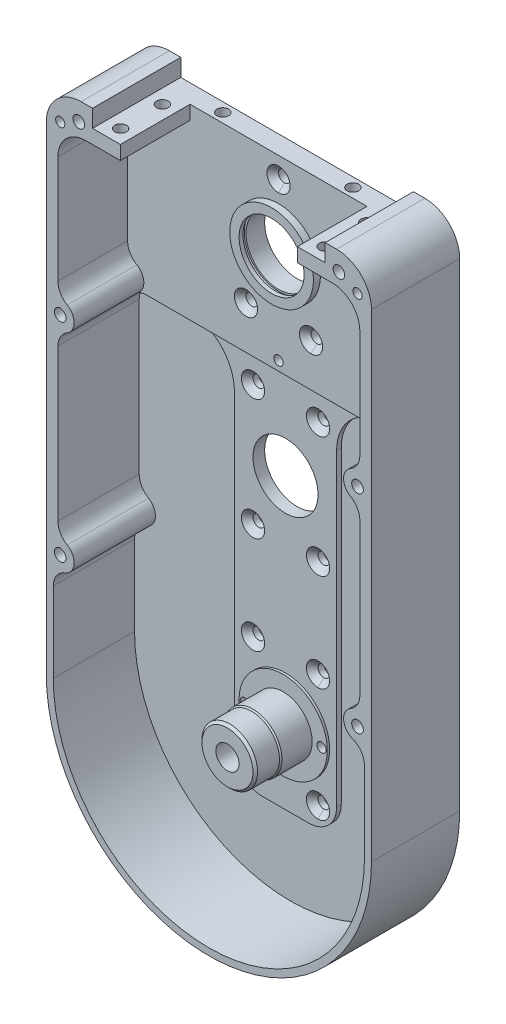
ISO-10303-21;
HEADER;
FILE_DESCRIPTION(('STEP AP214'),'2;1');
FILE_NAME('part.step','',(''),(''),'','','');
FILE_SCHEMA(('AUTOMOTIVE_DESIGN { 1 0 10303 214 1 1 1 1 }'));
ENDSEC;
DATA;
#1=APPLICATION_CONTEXT('core data for automotive mechanical design processes');
#2=APPLICATION_PROTOCOL_DEFINITION('international standard','automotive_design',2000,#1);
#3=PRODUCT_CONTEXT('',#1,'mechanical');
#4=PRODUCT('Part','Part','',(#3));
#5=PRODUCT_RELATED_PRODUCT_CATEGORY('part','',(#4));
#6=PRODUCT_DEFINITION_FORMATION('','',#4);
#7=PRODUCT_DEFINITION_CONTEXT('part definition',#1,'design');
#8=PRODUCT_DEFINITION('design','',#6,#7);
#9=PRODUCT_DEFINITION_SHAPE('','',#8);
#10=(LENGTH_UNIT() NAMED_UNIT(*) SI_UNIT(.MILLI.,.METRE.));
#11=(NAMED_UNIT(*) PLANE_ANGLE_UNIT() SI_UNIT($,.RADIAN.));
#12=(NAMED_UNIT(*) SI_UNIT($,.STERADIAN.) SOLID_ANGLE_UNIT());
#13=UNCERTAINTY_MEASURE_WITH_UNIT(LENGTH_MEASURE(1.E-05),#10,'distance_accuracy_value','');
#14=(GEOMETRIC_REPRESENTATION_CONTEXT(3) GLOBAL_UNCERTAINTY_ASSIGNED_CONTEXT((#13)) GLOBAL_UNIT_ASSIGNED_CONTEXT((#10,
#11,#12)) REPRESENTATION_CONTEXT('',''));
#15=CARTESIAN_POINT('',(0.,0.,0.));
#16=DIRECTION('',(0.,0.,1.));
#17=DIRECTION('',(1.,0.,0.));
#18=AXIS2_PLACEMENT_3D('',#15,#16,#17);
#19=CARTESIAN_POINT('',(0.,0.,11.55));
#20=DIRECTION('',(0.,0.,-1.));
#21=DIRECTION('',(-1.,0.,0.));
#22=AXIS2_PLACEMENT_3D('',#19,#20,#21);
#23=CYLINDRICAL_SURFACE('',#22,14.);
#24=CARTESIAN_POINT('',(0.,0.,9.3));
#25=DIRECTION('',(0.,0.,-1.));
#26=DIRECTION('',(-1.,0.,0.));
#27=AXIS2_PLACEMENT_3D('',#24,#25,#26);
#28=CIRCLE('',#27,14.);
#29=CARTESIAN_POINT('',(-14.,0.,9.3));
#30=VERTEX_POINT('',#29);
#31=EDGE_CURVE('E19',#30,#30,#28,.F.);
#32=ORIENTED_EDGE('',*,*,#31,.F.);
#33=EDGE_LOOP('',(#32));
#34=FACE_BOUND('',#33,.T.);
#35=CARTESIAN_POINT('',(0.,0.,11.));
#36=DIRECTION('',(0.,0.,-1.));
#37=DIRECTION('',(-1.,0.,0.));
#38=AXIS2_PLACEMENT_3D('',#35,#36,#37);
#39=CIRCLE('',#38,14.);
#40=CARTESIAN_POINT('',(-14.,0.,11.));
#41=VERTEX_POINT('',#40);
#42=EDGE_CURVE('E378',#41,#41,#39,.F.);
#43=ORIENTED_EDGE('',*,*,#42,.T.);
#44=EDGE_LOOP('',(#43));
#45=FACE_BOUND('',#44,.T.);
#46=ADVANCED_FACE('F16',(#34,#45),#23,.F.);
#47=CARTESIAN_POINT('',(0.,0.,8.));
#48=DIRECTION('',(0.,0.,1.));
#49=DIRECTION('',(1.,0.,0.));
#50=AXIS2_PLACEMENT_3D('',#47,#48,#49);
#51=PLANE('',#50);
#52=CARTESIAN_POINT('',(-56.,35.5,8.));
#53=DIRECTION('',(0.,0.,1.));
#54=DIRECTION('',(1.,0.,0.));
#55=AXIS2_PLACEMENT_3D('',#52,#53,#54);
#56=CIRCLE('',#55,2.5);
#57=CARTESIAN_POINT('',(-53.5,35.5,8.));
#58=VERTEX_POINT('',#57);
#59=EDGE_CURVE('E475',#58,#58,#56,.T.);
#60=ORIENTED_EDGE('',*,*,#59,.T.);
#61=EDGE_LOOP('',(#60));
#62=FACE_BOUND('',#61,.T.);
#63=ADVANCED_FACE('F1566',(#62),#51,.T.);
#64=CARTESIAN_POINT('',(0.,0.,3.));
#65=DIRECTION('',(0.,0.,1.));
#66=DIRECTION('',(1.,0.,0.));
#67=AXIS2_PLACEMENT_3D('',#64,#65,#66);
#68=PLANE('',#67);
#69=CARTESIAN_POINT('',(64.,-130.,3.));
#70=DIRECTION('',(0.,0.,1.));
#71=DIRECTION('',(1.,0.,0.));
#72=AXIS2_PLACEMENT_3D('',#69,#70,#71);
#73=CIRCLE('',#72,2.5);
#74=CARTESIAN_POINT('',(66.5,-130.,3.));
#75=VERTEX_POINT('',#74);
#76=EDGE_CURVE('E866',#75,#75,#73,.T.);
#77=ORIENTED_EDGE('',*,*,#76,.T.);
#78=EDGE_LOOP('',(#77));
#79=FACE_BOUND('',#78,.T.);
#80=ADVANCED_FACE('F1563',(#79),#68,.T.);
#81=CARTESIAN_POINT('',(0.,0.,3.));
#82=DIRECTION('',(0.,0.,1.));
#83=DIRECTION('',(1.,0.,0.));
#84=AXIS2_PLACEMENT_3D('',#81,#82,#83);
#85=PLANE('',#84);
#86=CARTESIAN_POINT('',(-64.,-130.,3.));
#87=DIRECTION('',(0.,0.,1.));
#88=DIRECTION('',(1.,0.,0.));
#89=AXIS2_PLACEMENT_3D('',#86,#87,#88);
#90=CIRCLE('',#89,2.5);
#91=CARTESIAN_POINT('',(-61.5,-130.,3.));
#92=VERTEX_POINT('',#91);
#93=EDGE_CURVE('E863',#92,#92,#90,.T.);
#94=ORIENTED_EDGE('',*,*,#93,.T.);
#95=EDGE_LOOP('',(#94));
#96=FACE_BOUND('',#95,.T.);
#97=ADVANCED_FACE('F1559',(#96),#85,.T.);
#98=CARTESIAN_POINT('',(0.,0.,8.));
#99=DIRECTION('',(0.,0.,1.));
#100=DIRECTION('',(1.,0.,0.));
#101=AXIS2_PLACEMENT_3D('',#98,#99,#100);
#102=PLANE('',#101);
#103=CARTESIAN_POINT('',(56.,35.5,8.));
#104=DIRECTION('',(0.,0.,1.));
#105=DIRECTION('',(1.,0.,0.));
#106=AXIS2_PLACEMENT_3D('',#103,#104,#105);
#107=CIRCLE('',#106,2.5);
#108=CARTESIAN_POINT('',(58.5,35.5,8.));
#109=VERTEX_POINT('',#108);
#110=EDGE_CURVE('E860',#109,#109,#107,.T.);
#111=ORIENTED_EDGE('',*,*,#110,.T.);
#112=EDGE_LOOP('',(#111));
#113=FACE_BOUND('',#112,.T.);
#114=ADVANCED_FACE('F1555',(#113),#102,.T.);
#115=CARTESIAN_POINT('',(0.,0.,8.));
#116=DIRECTION('',(0.,0.,1.));
#117=DIRECTION('',(1.,0.,0.));
#118=AXIS2_PLACEMENT_3D('',#115,#116,#117);
#119=PLANE('',#118);
#120=CARTESIAN_POINT('',(64.,-40.5,8.));
#121=DIRECTION('',(0.,0.,1.));
#122=DIRECTION('',(1.,0.,0.));
#123=AXIS2_PLACEMENT_3D('',#120,#121,#122);
#124=CIRCLE('',#123,2.5);
#125=CARTESIAN_POINT('',(66.5,-40.5,8.));
#126=VERTEX_POINT('',#125);
#127=EDGE_CURVE('E857',#126,#126,#124,.T.);
#128=ORIENTED_EDGE('',*,*,#127,.T.);
#129=EDGE_LOOP('',(#128));
#130=FACE_BOUND('',#129,.T.);
#131=ADVANCED_FACE('F1551',(#130),#119,.T.);
#132=CARTESIAN_POINT('',(0.,0.,8.));
#133=DIRECTION('',(0.,0.,1.));
#134=DIRECTION('',(1.,0.,0.));
#135=AXIS2_PLACEMENT_3D('',#132,#133,#134);
#136=PLANE('',#135);
#137=CARTESIAN_POINT('',(-64.,-40.5,8.));
#138=DIRECTION('',(0.,0.,1.));
#139=DIRECTION('',(1.,0.,0.));
#140=AXIS2_PLACEMENT_3D('',#137,#138,#139);
#141=CIRCLE('',#140,2.5);
#142=CARTESIAN_POINT('',(-61.5,-40.5,8.));
#143=VERTEX_POINT('',#142);
#144=EDGE_CURVE('E854',#143,#143,#141,.T.);
#145=ORIENTED_EDGE('',*,*,#144,.T.);
#146=EDGE_LOOP('',(#145));
#147=FACE_BOUND('',#146,.T.);
#148=ADVANCED_FACE('F1547',(#147),#136,.T.);
#149=CARTESIAN_POINT('',(0.,0.,8.));
#150=DIRECTION('',(0.,0.,1.));
#151=DIRECTION('',(1.,0.,0.));
#152=AXIS2_PLACEMENT_3D('',#149,#150,#151);
#153=PLANE('',#152);
#154=CARTESIAN_POINT('',(-64.,31.5,8.));
#155=DIRECTION('',(0.,0.,1.));
#156=DIRECTION('',(1.,0.,0.));
#157=AXIS2_PLACEMENT_3D('',#154,#155,#156);
#158=CIRCLE('',#157,2.);
#159=CARTESIAN_POINT('',(-62.,31.5,8.));
#160=VERTEX_POINT('',#159);
#161=EDGE_CURVE('E851',#160,#160,#158,.T.);
#162=ORIENTED_EDGE('',*,*,#161,.T.);
#163=EDGE_LOOP('',(#162));
#164=FACE_BOUND('',#163,.T.);
#165=ADVANCED_FACE('F1543',(#164),#153,.T.);
#166=CARTESIAN_POINT('',(0.,0.,8.));
#167=DIRECTION('',(0.,0.,1.));
#168=DIRECTION('',(1.,0.,0.));
#169=AXIS2_PLACEMENT_3D('',#166,#167,#168);
#170=PLANE('',#169);
#171=CARTESIAN_POINT('',(64.,31.5,8.));
#172=DIRECTION('',(0.,0.,1.));
#173=DIRECTION('',(1.,0.,0.));
#174=AXIS2_PLACEMENT_3D('',#171,#172,#173);
#175=CIRCLE('',#174,2.);
#176=CARTESIAN_POINT('',(66.,31.5,8.));
#177=VERTEX_POINT('',#176);
#178=EDGE_CURVE('E533',#177,#177,#175,.T.);
#179=ORIENTED_EDGE('',*,*,#178,.T.);
#180=EDGE_LOOP('',(#179));
#181=FACE_BOUND('',#180,.T.);
#182=ADVANCED_FACE('F1539',(#181),#170,.T.);
#183=CARTESIAN_POINT('',(0.,-177.5,31.25));
#184=DIRECTION('',(0.,0.,-1.));
#185=DIRECTION('',(-1.,0.,0.));
#186=AXIS2_PLACEMENT_3D('',#183,#184,#185);
#187=CYLINDRICAL_SURFACE('',#186,11.9799999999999);
#188=CARTESIAN_POINT('',(0.,-177.5,19.5751842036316));
#189=DIRECTION('',(0.,0.,-1.));
#190=DIRECTION('',(0.,-1.,0.));
#191=AXIS2_PLACEMENT_3D('',#188,#189,#190);
#192=CIRCLE('',#191,11.9799999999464);
#193=CARTESIAN_POINT('',(0.,-189.479999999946,19.5751842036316));
#194=VERTEX_POINT('',#193);
#195=EDGE_CURVE('E538',#194,#194,#192,.T.);
#196=ORIENTED_EDGE('',*,*,#195,.F.);
#197=EDGE_LOOP('',(#196));
#198=FACE_BOUND('',#197,.T.);
#199=CARTESIAN_POINT('',(0.,-177.5,28.9999999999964));
#200=DIRECTION('',(0.,0.,-1.));
#201=DIRECTION('',(0.,-1.,0.));
#202=AXIS2_PLACEMENT_3D('',#199,#200,#201);
#203=CIRCLE('',#202,11.9800000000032);
#204=CARTESIAN_POINT('',(0.,-189.480000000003,28.9999999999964));
#205=VERTEX_POINT('',#204);
#206=EDGE_CURVE('E529',#205,#205,#203,.F.);
#207=ORIENTED_EDGE('',*,*,#206,.F.);
#208=EDGE_LOOP('',(#207));
#209=FACE_BOUND('',#208,.T.);
#210=ADVANCED_FACE('F1536',(#198,#209),#187,.T.);
#211=CARTESIAN_POINT('',(0.,0.,9.3));
#212=DIRECTION('',(0.,0.,-1.));
#213=DIRECTION('',(-1.,0.,0.));
#214=AXIS2_PLACEMENT_3D('',#211,#212,#213);
#215=PLANE('',#214);
#216=ORIENTED_EDGE('',*,*,#31,.T.);
#217=EDGE_LOOP('',(#216));
#218=FACE_BOUND('',#217,.T.);
#219=CARTESIAN_POINT('',(0.,0.,9.3));
#220=DIRECTION('',(0.,0.,-1.));
#221=DIRECTION('',(-1.,0.,0.));
#222=AXIS2_PLACEMENT_3D('',#219,#220,#221);
#223=CIRCLE('',#222,14.75);
#224=CARTESIAN_POINT('',(-14.75,0.,9.3));
#225=VERTEX_POINT('',#224);
#226=EDGE_CURVE('E532',#225,#225,#223,.T.);
#227=ORIENTED_EDGE('',*,*,#226,.T.);
#228=EDGE_LOOP('',(#227));
#229=FACE_BOUND('',#228,.T.);
#230=ADVANCED_FACE('F1533',(#218,#229),#215,.T.);
#231=CARTESIAN_POINT('',(0.,0.,3.));
#232=DIRECTION('',(0.,0.,1.));
#233=DIRECTION('',(1.,0.,0.));
#234=AXIS2_PLACEMENT_3D('',#231,#232,#233);
#235=PLANE('',#234);
#236=DIRECTION('',(1.,0.,0.));
#237=VECTOR('',#236,1.);
#238=CARTESIAN_POINT('',(-70.,-44.5,3.));
#239=LINE('',#238,#237);
#240=CARTESIAN_POINT('',(-56.9289321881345,-44.5,3.));
#241=VERTEX_POINT('',#240);
#242=CARTESIAN_POINT('',(-42.,-44.5,3.));
#243=VERTEX_POINT('',#242);
#244=EDGE_CURVE('E410',#241,#243,#239,.T.);
#245=ORIENTED_EDGE('',*,*,#244,.F.);
#246=CARTESIAN_POINT('',(-56.9289321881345,-52.,3.));
#247=DIRECTION('',(0.,0.,1.));
#248=DIRECTION('',(1.,0.,0.));
#249=AXIS2_PLACEMENT_3D('',#246,#247,#248);
#250=CIRCLE('',#249,7.5);
#251=CARTESIAN_POINT('',(-60.8573031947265,-45.6111111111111,3.));
#252=VERTEX_POINT('',#251);
#253=EDGE_CURVE('E411',#241,#252,#250,.T.);
#254=ORIENTED_EDGE('',*,*,#253,.T.);
#255=CARTESIAN_POINT('',(-64.,-40.5,3.));
#256=DIRECTION('',(0.,0.,1.));
#257=DIRECTION('',(1.,0.,0.));
#258=AXIS2_PLACEMENT_3D('',#255,#256,#257);
#259=CIRCLE('',#258,6.);
#260=CARTESIAN_POINT('',(-61.,-45.6961524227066,3.));
#261=VERTEX_POINT('',#260);
#262=EDGE_CURVE('E471',#261,#252,#259,.T.);
#263=ORIENTED_EDGE('',*,*,#262,.F.);
#264=CARTESIAN_POINT('',(-57.,-52.6243556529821,3.));
#265=DIRECTION('',(0.,0.,1.));
#266=DIRECTION('',(1.,0.,0.));
#267=AXIS2_PLACEMENT_3D('',#264,#265,#266);
#268=CIRCLE('',#267,8.);
#269=CARTESIAN_POINT('',(-65.,-52.6243556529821,3.));
#270=VERTEX_POINT('',#269);
#271=EDGE_CURVE('E476',#261,#270,#268,.T.);
#272=ORIENTED_EDGE('',*,*,#271,.T.);
#273=DIRECTION('',(0.,1.,0.));
#274=VECTOR('',#273,1.);
#275=CARTESIAN_POINT('',(-65.,-117.875644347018,3.));
#276=LINE('',#275,#274);
#277=CARTESIAN_POINT('',(-65.,-117.875644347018,3.));
#278=VERTEX_POINT('',#277);
#279=EDGE_CURVE('E480',#278,#270,#276,.T.);
#280=ORIENTED_EDGE('',*,*,#279,.F.);
#281=CARTESIAN_POINT('',(-57.,-117.875644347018,3.));
#282=DIRECTION('',(0.,0.,1.));
#283=DIRECTION('',(1.,0.,0.));
#284=AXIS2_PLACEMENT_3D('',#281,#282,#283);
#285=CIRCLE('',#284,8.);
#286=CARTESIAN_POINT('',(-61.,-124.803847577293,3.));
#287=VERTEX_POINT('',#286);
#288=EDGE_CURVE('E484',#278,#287,#285,.T.);
#289=ORIENTED_EDGE('',*,*,#288,.T.);
#290=CARTESIAN_POINT('',(-64.,-130.,3.));
#291=DIRECTION('',(0.,0.,1.));
#292=DIRECTION('',(1.,0.,0.));
#293=AXIS2_PLACEMENT_3D('',#290,#291,#292);
#294=CIRCLE('',#293,6.);
#295=CARTESIAN_POINT('',(-61.8571428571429,-135.604298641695,3.));
#296=VERTEX_POINT('',#295);
#297=EDGE_CURVE('E488',#296,#287,#294,.T.);
#298=ORIENTED_EDGE('',*,*,#297,.F.);
#299=CARTESIAN_POINT('',(-59.,-143.076696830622,3.));
#300=DIRECTION('',(0.,0.,1.));
#301=DIRECTION('',(1.,0.,0.));
#302=AXIS2_PLACEMENT_3D('',#299,#300,#301);
#303=CIRCLE('',#302,8.);
#304=CARTESIAN_POINT('',(-67.,-143.076696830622,3.));
#305=VERTEX_POINT('',#304);
#306=EDGE_CURVE('E492',#296,#305,#303,.T.);
#307=ORIENTED_EDGE('',*,*,#306,.T.);
#308=DIRECTION('',(0.,1.,0.));
#309=VECTOR('',#308,1.);
#310=CARTESIAN_POINT('',(-67.,-177.5,3.));
#311=LINE('',#310,#309);
#312=CARTESIAN_POINT('',(-67.,-177.5,3.));
#313=VERTEX_POINT('',#312);
#314=EDGE_CURVE('E496',#313,#305,#311,.T.);
#315=ORIENTED_EDGE('',*,*,#314,.F.);
#316=CARTESIAN_POINT('',(0.,-177.5,3.));
#317=DIRECTION('',(0.,0.,1.));
#318=DIRECTION('',(1.,0.,0.));
#319=AXIS2_PLACEMENT_3D('',#316,#317,#318);
#320=CIRCLE('',#319,67.);
#321=CARTESIAN_POINT('',(67.,-177.5,3.));
#322=VERTEX_POINT('',#321);
#323=EDGE_CURVE('E500',#313,#322,#320,.T.);
#324=ORIENTED_EDGE('',*,*,#323,.T.);
#325=DIRECTION('',(0.,1.,0.));
#326=VECTOR('',#325,1.);
#327=CARTESIAN_POINT('',(67.,-143.076696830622,3.));
#328=LINE('',#327,#326);
#329=CARTESIAN_POINT('',(67.,-143.076696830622,3.));
#330=VERTEX_POINT('',#329);
#331=EDGE_CURVE('E504',#330,#322,#328,.F.);
#332=ORIENTED_EDGE('',*,*,#331,.F.);
#333=CARTESIAN_POINT('',(59.,-143.076696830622,3.));
#334=DIRECTION('',(0.,0.,1.));
#335=DIRECTION('',(1.,0.,0.));
#336=AXIS2_PLACEMENT_3D('',#333,#334,#335);
#337=CIRCLE('',#336,8.);
#338=CARTESIAN_POINT('',(61.8571428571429,-135.604298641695,3.));
#339=VERTEX_POINT('',#338);
#340=EDGE_CURVE('E508',#330,#339,#337,.T.);
#341=ORIENTED_EDGE('',*,*,#340,.T.);
#342=CARTESIAN_POINT('',(64.,-130.,3.));
#343=DIRECTION('',(0.,0.,1.));
#344=DIRECTION('',(1.,0.,0.));
#345=AXIS2_PLACEMENT_3D('',#342,#343,#344);
#346=CIRCLE('',#345,6.);
#347=CARTESIAN_POINT('',(61.,-124.803847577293,3.));
#348=VERTEX_POINT('',#347);
#349=EDGE_CURVE('E512',#348,#339,#346,.T.);
#350=ORIENTED_EDGE('',*,*,#349,.F.);
#351=CARTESIAN_POINT('',(57.,-117.875644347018,3.));
#352=DIRECTION('',(0.,0.,1.));
#353=DIRECTION('',(1.,0.,0.));
#354=AXIS2_PLACEMENT_3D('',#351,#352,#353);
#355=CIRCLE('',#354,8.);
#356=CARTESIAN_POINT('',(65.,-117.875644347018,3.));
#357=VERTEX_POINT('',#356);
#358=EDGE_CURVE('E516',#348,#357,#355,.T.);
#359=ORIENTED_EDGE('',*,*,#358,.T.);
#360=DIRECTION('',(0.,1.,0.));
#361=VECTOR('',#360,1.);
#362=CARTESIAN_POINT('',(65.,-52.6243556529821,3.));
#363=LINE('',#362,#361);
#364=CARTESIAN_POINT('',(65.,-52.6243556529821,3.));
#365=VERTEX_POINT('',#364);
#366=EDGE_CURVE('E520',#365,#357,#363,.F.);
#367=ORIENTED_EDGE('',*,*,#366,.F.);
#368=CARTESIAN_POINT('',(57.,-52.6243556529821,3.));
#369=DIRECTION('',(0.,0.,1.));
#370=DIRECTION('',(1.,0.,0.));
#371=AXIS2_PLACEMENT_3D('',#368,#369,#370);
#372=CIRCLE('',#371,8.);
#373=CARTESIAN_POINT('',(61.,-45.6961524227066,3.));
#374=VERTEX_POINT('',#373);
#375=EDGE_CURVE('E376',#365,#374,#372,.T.);
#376=ORIENTED_EDGE('',*,*,#375,.T.);
#377=CARTESIAN_POINT('',(64.,-40.5,3.));
#378=DIRECTION('',(0.,0.,1.));
#379=DIRECTION('',(1.,0.,0.));
#380=AXIS2_PLACEMENT_3D('',#377,#378,#379);
#381=CIRCLE('',#380,6.);
#382=CARTESIAN_POINT('',(60.8573031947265,-45.6111111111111,3.));
#383=VERTEX_POINT('',#382);
#384=EDGE_CURVE('E366',#374,#383,#381,.F.);
#385=ORIENTED_EDGE('',*,*,#384,.T.);
#386=CARTESIAN_POINT('',(56.9289321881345,-52.,3.));
#387=DIRECTION('',(0.,0.,-1.));
#388=DIRECTION('',(-1.,0.,0.));
#389=AXIS2_PLACEMENT_3D('',#386,#387,#388);
#390=CIRCLE('',#389,7.5);
#391=CARTESIAN_POINT('',(56.9289321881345,-44.5,3.));
#392=VERTEX_POINT('',#391);
#393=EDGE_CURVE('E374',#383,#392,#390,.F.);
#394=ORIENTED_EDGE('',*,*,#393,.T.);
#395=DIRECTION('',(1.,0.,0.));
#396=VECTOR('',#395,1.);
#397=CARTESIAN_POINT('',(-70.,-44.5,3.));
#398=LINE('',#397,#396);
#399=CARTESIAN_POINT('',(42.,-44.5,3.));
#400=VERTEX_POINT('',#399);
#401=EDGE_CURVE('E406',#400,#392,#398,.T.);
#402=ORIENTED_EDGE('',*,*,#401,.F.);
#403=CARTESIAN_POINT('',(42.,-64.5,3.));
#404=DIRECTION('',(0.,0.,1.));
#405=DIRECTION('',(1.,0.,0.));
#406=AXIS2_PLACEMENT_3D('',#403,#404,#405);
#407=CIRCLE('',#406,20.);
#408=CARTESIAN_POINT('',(22.,-64.5,3.));
#409=VERTEX_POINT('',#408);
#410=EDGE_CURVE('E442',#400,#409,#407,.T.);
#411=ORIENTED_EDGE('',*,*,#410,.T.);
#412=DIRECTION('',(0.,1.,0.));
#413=VECTOR('',#412,1.);
#414=CARTESIAN_POINT('',(22.,-197.5,3.));
#415=LINE('',#414,#413);
#416=CARTESIAN_POINT('',(22.,-197.5,3.));
#417=VERTEX_POINT('',#416);
#418=EDGE_CURVE('E446',#417,#409,#415,.T.);
#419=ORIENTED_EDGE('',*,*,#418,.F.);
#420=CARTESIAN_POINT('',(10.,-197.5,3.));
#421=DIRECTION('',(0.,0.,1.));
#422=DIRECTION('',(1.,0.,0.));
#423=AXIS2_PLACEMENT_3D('',#420,#421,#422);
#424=CIRCLE('',#423,12.);
#425=CARTESIAN_POINT('',(10.,-209.5,3.));
#426=VERTEX_POINT('',#425);
#427=EDGE_CURVE('E447',#426,#417,#424,.T.);
#428=ORIENTED_EDGE('',*,*,#427,.F.);
#429=DIRECTION('',(1.,0.,0.));
#430=VECTOR('',#429,1.);
#431=CARTESIAN_POINT('',(-10.,-209.5,3.));
#432=LINE('',#431,#430);
#433=CARTESIAN_POINT('',(-10.,-209.5,3.));
#434=VERTEX_POINT('',#433);
#435=EDGE_CURVE('E451',#434,#426,#432,.T.);
#436=ORIENTED_EDGE('',*,*,#435,.F.);
#437=CARTESIAN_POINT('',(-10.,-197.5,3.));
#438=DIRECTION('',(0.,0.,1.));
#439=DIRECTION('',(1.,0.,0.));
#440=AXIS2_PLACEMENT_3D('',#437,#438,#439);
#441=CIRCLE('',#440,12.);
#442=CARTESIAN_POINT('',(-22.,-197.5,3.));
#443=VERTEX_POINT('',#442);
#444=EDGE_CURVE('E455',#443,#434,#441,.T.);
#445=ORIENTED_EDGE('',*,*,#444,.F.);
#446=DIRECTION('',(0.,1.,0.));
#447=VECTOR('',#446,1.);
#448=CARTESIAN_POINT('',(-22.,-64.5,3.));
#449=LINE('',#448,#447);
#450=CARTESIAN_POINT('',(-22.,-64.5,3.));
#451=VERTEX_POINT('',#450);
#452=EDGE_CURVE('E459',#451,#443,#449,.F.);
#453=ORIENTED_EDGE('',*,*,#452,.F.);
#454=CARTESIAN_POINT('',(-42.,-64.5,3.));
#455=DIRECTION('',(0.,0.,1.));
#456=DIRECTION('',(1.,0.,0.));
#457=AXIS2_PLACEMENT_3D('',#454,#455,#456);
#458=CIRCLE('',#457,20.);
#459=EDGE_CURVE('E463',#451,#243,#458,.T.);
#460=ORIENTED_EDGE('',*,*,#459,.T.);
#461=EDGE_LOOP('',(#245,#254,#263,#272,#280,#289,#298,#307,#315,#324,#332,#341,#350,#359,#367,
#376,#385,#394,#402,#411,#419,#428,#436,#445,#453,#460));
#462=FACE_BOUND('',#461,.T.);
#463=ADVANCED_FACE('F372',(#462),#235,.T.);
#464=CARTESIAN_POINT('',(0.,0.,11.));
#465=DIRECTION('',(0.,0.,-1.));
#466=DIRECTION('',(-1.,0.,0.));
#467=AXIS2_PLACEMENT_3D('',#464,#465,#466);
#468=PLANE('',#467);
#469=ORIENTED_EDGE('',*,*,#42,.F.);
#470=EDGE_LOOP('',(#469));
#471=FACE_BOUND('',#470,.T.);
#472=CARTESIAN_POINT('',(0.,0.,11.));
#473=DIRECTION('',(0.,0.,-1.));
#474=DIRECTION('',(-1.,0.,0.));
#475=AXIS2_PLACEMENT_3D('',#472,#473,#474);
#476=CIRCLE('',#475,18.);
#477=CARTESIAN_POINT('',(-18.,0.,11.));
#478=VERTEX_POINT('',#477);
#479=EDGE_CURVE('E393',#478,#478,#476,.T.);
#480=ORIENTED_EDGE('',*,*,#479,.F.);
#481=EDGE_LOOP('',(#480));
#482=FACE_BOUND('',#481,.T.);
#483=ADVANCED_FACE('F890',(#471,#482),#468,.F.);
#484=CARTESIAN_POINT('',(0.,-177.5,19.0000000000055));
#485=DIRECTION('',(0.,0.,-1.));
#486=DIRECTION('',(-1.,0.,0.));
#487=AXIS2_PLACEMENT_3D('',#484,#485,#486);
#488=CONICAL_SURFACE('',#487,12.4799999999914,0.715584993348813);
#489=ORIENTED_EDGE('',*,*,#195,.T.);
#490=EDGE_LOOP('',(#489));
#491=FACE_BOUND('',#490,.T.);
#492=CARTESIAN_POINT('',(0.,-177.5,19.));
#493=DIRECTION('',(0.,0.,-1.));
#494=DIRECTION('',(-1.,0.,0.));
#495=AXIS2_PLACEMENT_3D('',#492,#493,#494);
#496=CIRCLE('',#495,12.48);
#497=CARTESIAN_POINT('',(-12.48,-177.5,19.));
#498=VERTEX_POINT('',#497);
#499=EDGE_CURVE('E397',#498,#498,#496,.T.);
#500=ORIENTED_EDGE('',*,*,#499,.F.);
#501=EDGE_LOOP('',(#500));
#502=FACE_BOUND('',#501,.T.);
#503=ADVANCED_FACE('F893',(#491,#502),#488,.T.);
#504=CARTESIAN_POINT('',(0.,16.,0.));
#505=DIRECTION('',(0.,1.,0.));
#506=DIRECTION('',(0.,0.,1.));
#507=AXIS2_PLACEMENT_3D('',#504,#505,#506);
#508=PLANE('',#507);
#509=CARTESIAN_POINT('',(28.,16.,4.));
#510=DIRECTION('',(0.,1.,0.));
#511=DIRECTION('',(0.,0.,1.));
#512=AXIS2_PLACEMENT_3D('',#509,#510,#511);
#513=CIRCLE('',#512,2.5);
#514=CARTESIAN_POINT('',(28.,16.,6.5));
#515=VERTEX_POINT('',#514);
#516=EDGE_CURVE('E430',#515,#515,#513,.T.);
#517=ORIENTED_EDGE('',*,*,#516,.T.);
#518=EDGE_LOOP('',(#517));
#519=FACE_BOUND('',#518,.T.);
#520=ADVANCED_FACE('F1523',(#519),#508,.T.);
#521=CARTESIAN_POINT('',(0.,16.,0.));
#522=DIRECTION('',(0.,1.,0.));
#523=DIRECTION('',(0.,0.,1.));
#524=AXIS2_PLACEMENT_3D('',#521,#522,#523);
#525=PLANE('',#524);
#526=CARTESIAN_POINT('',(-28.,16.,4.));
#527=DIRECTION('',(0.,1.,0.));
#528=DIRECTION('',(0.,0.,1.));
#529=AXIS2_PLACEMENT_3D('',#526,#527,#528);
#530=CIRCLE('',#529,2.5);
#531=CARTESIAN_POINT('',(-28.,16.,6.5));
#532=VERTEX_POINT('',#531);
#533=EDGE_CURVE('E833',#532,#532,#530,.T.);
#534=ORIENTED_EDGE('',*,*,#533,.T.);
#535=EDGE_LOOP('',(#534));
#536=FACE_BOUND('',#535,.T.);
#537=ADVANCED_FACE('F1519',(#536),#525,.T.);
#538=CARTESIAN_POINT('',(57.,-52.6243556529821,3.));
#539=DIRECTION('',(0.,0.,1.));
#540=DIRECTION('',(1.,0.,0.));
#541=AXIS2_PLACEMENT_3D('',#538,#539,#540);
#542=CYLINDRICAL_SURFACE('',#541,8.);
#543=CARTESIAN_POINT('',(57.,-52.6243556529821,38.));
#544=DIRECTION('',(0.,0.,1.));
#545=DIRECTION('',(1.,0.,0.));
#546=AXIS2_PLACEMENT_3D('',#543,#544,#545);
#547=CIRCLE('',#546,8.);
#548=CARTESIAN_POINT('',(61.,-45.6961524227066,38.));
#549=VERTEX_POINT('',#548);
#550=CARTESIAN_POINT('',(65.,-52.6243556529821,38.));
#551=VERTEX_POINT('',#550);
#552=EDGE_CURVE('E808',#549,#551,#547,.F.);
#553=ORIENTED_EDGE('',*,*,#552,.F.);
#554=DIRECTION('',(0.,0.,1.));
#555=VECTOR('',#554,1.);
#556=CARTESIAN_POINT('',(61.,-45.6961524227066,3.));
#557=LINE('',#556,#555);
#558=EDGE_CURVE('E399',#374,#549,#557,.T.);
#559=ORIENTED_EDGE('',*,*,#558,.F.);
#560=ORIENTED_EDGE('',*,*,#375,.F.);
#561=DIRECTION('',(0.,0.,1.));
#562=VECTOR('',#561,1.);
#563=CARTESIAN_POINT('',(65.,-52.6243556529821,3.));
#564=LINE('',#563,#562);
#565=EDGE_CURVE('E517',#551,#365,#564,.F.);
#566=ORIENTED_EDGE('',*,*,#565,.F.);
#567=EDGE_LOOP('',(#553,#559,#560,#566));
#568=FACE_BOUND('',#567,.T.);
#569=ADVANCED_FACE('F1515',(#568),#542,.F.);
#570=CARTESIAN_POINT('',(65.,-52.6243556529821,3.));
#571=DIRECTION('',(-1.,0.,0.));
#572=DIRECTION('',(0.,0.,1.));
#573=AXIS2_PLACEMENT_3D('',#570,#571,#572);
#574=PLANE('',#573);
#575=ORIENTED_EDGE('',*,*,#565,.T.);
#576=ORIENTED_EDGE('',*,*,#366,.T.);
#577=DIRECTION('',(0.,0.,1.));
#578=VECTOR('',#577,1.);
#579=CARTESIAN_POINT('',(65.,-117.875644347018,3.));
#580=LINE('',#579,#578);
#581=CARTESIAN_POINT('',(65.,-117.875644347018,38.));
#582=VERTEX_POINT('',#581);
#583=EDGE_CURVE('E513',#357,#582,#580,.T.);
#584=ORIENTED_EDGE('',*,*,#583,.T.);
#585=DIRECTION('',(0.,1.,0.));
#586=VECTOR('',#585,1.);
#587=CARTESIAN_POINT('',(65.,0.,38.));
#588=LINE('',#587,#586);
#589=EDGE_CURVE('E807',#551,#582,#588,.F.);
#590=ORIENTED_EDGE('',*,*,#589,.F.);
#591=EDGE_LOOP('',(#575,#576,#584,#590));
#592=FACE_BOUND('',#591,.T.);
#593=ADVANCED_FACE('F1511',(#592),#574,.T.);
#594=CARTESIAN_POINT('',(57.,-117.875644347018,3.));
#595=DIRECTION('',(0.,0.,1.));
#596=DIRECTION('',(1.,0.,0.));
#597=AXIS2_PLACEMENT_3D('',#594,#595,#596);
#598=CYLINDRICAL_SURFACE('',#597,8.);
#599=CARTESIAN_POINT('',(57.,-117.875644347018,38.));
#600=DIRECTION('',(0.,0.,1.));
#601=DIRECTION('',(1.,0.,0.));
#602=AXIS2_PLACEMENT_3D('',#599,#600,#601);
#603=CIRCLE('',#602,8.);
#604=CARTESIAN_POINT('',(61.,-124.803847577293,38.));
#605=VERTEX_POINT('',#604);
#606=EDGE_CURVE('E805',#582,#605,#603,.F.);
#607=ORIENTED_EDGE('',*,*,#606,.F.);
#608=ORIENTED_EDGE('',*,*,#583,.F.);
#609=ORIENTED_EDGE('',*,*,#358,.F.);
#610=DIRECTION('',(0.,0.,1.));
#611=VECTOR('',#610,1.);
#612=CARTESIAN_POINT('',(61.,-124.803847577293,3.));
#613=LINE('',#612,#611);
#614=EDGE_CURVE('E509',#605,#348,#613,.F.);
#615=ORIENTED_EDGE('',*,*,#614,.F.);
#616=EDGE_LOOP('',(#607,#608,#609,#615));
#617=FACE_BOUND('',#616,.T.);
#618=ADVANCED_FACE('F1507',(#617),#598,.F.);
#619=CARTESIAN_POINT('',(64.,-130.,3.));
#620=DIRECTION('',(0.,0.,1.));
#621=DIRECTION('',(1.,0.,0.));
#622=AXIS2_PLACEMENT_3D('',#619,#620,#621);
#623=CYLINDRICAL_SURFACE('',#622,6.);
#624=ORIENTED_EDGE('',*,*,#614,.T.);
#625=ORIENTED_EDGE('',*,*,#349,.T.);
#626=DIRECTION('',(0.,0.,1.));
#627=VECTOR('',#626,1.);
#628=CARTESIAN_POINT('',(61.8571428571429,-135.604298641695,3.));
#629=LINE('',#628,#627);
#630=CARTESIAN_POINT('',(61.8571428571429,-135.604298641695,38.));
#631=VERTEX_POINT('',#630);
#632=EDGE_CURVE('E505',#339,#631,#629,.T.);
#633=ORIENTED_EDGE('',*,*,#632,.T.);
#634=CARTESIAN_POINT('',(64.,-130.,38.));
#635=DIRECTION('',(0.,0.,1.));
#636=DIRECTION('',(1.,0.,0.));
#637=AXIS2_PLACEMENT_3D('',#634,#635,#636);
#638=CIRCLE('',#637,6.);
#639=EDGE_CURVE('E803',#605,#631,#638,.T.);
#640=ORIENTED_EDGE('',*,*,#639,.F.);
#641=EDGE_LOOP('',(#624,#625,#633,#640));
#642=FACE_BOUND('',#641,.T.);
#643=ADVANCED_FACE('F1503',(#642),#623,.T.);
#644=CARTESIAN_POINT('',(59.,-143.076696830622,3.));
#645=DIRECTION('',(0.,0.,1.));
#646=DIRECTION('',(1.,0.,0.));
#647=AXIS2_PLACEMENT_3D('',#644,#645,#646);
#648=CYLINDRICAL_SURFACE('',#647,8.);
#649=CARTESIAN_POINT('',(59.,-143.076696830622,38.));
#650=DIRECTION('',(0.,0.,1.));
#651=DIRECTION('',(1.,0.,0.));
#652=AXIS2_PLACEMENT_3D('',#649,#650,#651);
#653=CIRCLE('',#652,8.);
#654=CARTESIAN_POINT('',(67.,-143.076696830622,38.));
#655=VERTEX_POINT('',#654);
#656=EDGE_CURVE('E801',#631,#655,#653,.F.);
#657=ORIENTED_EDGE('',*,*,#656,.F.);
#658=ORIENTED_EDGE('',*,*,#632,.F.);
#659=ORIENTED_EDGE('',*,*,#340,.F.);
#660=DIRECTION('',(0.,0.,1.));
#661=VECTOR('',#660,1.);
#662=CARTESIAN_POINT('',(67.,-143.076696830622,3.));
#663=LINE('',#662,#661);
#664=EDGE_CURVE('E501',#655,#330,#663,.F.);
#665=ORIENTED_EDGE('',*,*,#664,.F.);
#666=EDGE_LOOP('',(#657,#658,#659,#665));
#667=FACE_BOUND('',#666,.T.);
#668=ADVANCED_FACE('F1499',(#667),#648,.F.);
#669=CARTESIAN_POINT('',(67.,-143.076696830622,3.));
#670=DIRECTION('',(-1.,0.,0.));
#671=DIRECTION('',(0.,0.,1.));
#672=AXIS2_PLACEMENT_3D('',#669,#670,#671);
#673=PLANE('',#672);
#674=ORIENTED_EDGE('',*,*,#664,.T.);
#675=ORIENTED_EDGE('',*,*,#331,.T.);
#676=DIRECTION('',(0.,0.,1.));
#677=VECTOR('',#676,1.);
#678=CARTESIAN_POINT('',(67.,-177.5,3.));
#679=LINE('',#678,#677);
#680=CARTESIAN_POINT('',(67.,-177.5,38.));
#681=VERTEX_POINT('',#680);
#682=EDGE_CURVE('E497',#322,#681,#679,.T.);
#683=ORIENTED_EDGE('',*,*,#682,.T.);
#684=DIRECTION('',(0.,1.,0.));
#685=VECTOR('',#684,1.);
#686=CARTESIAN_POINT('',(67.,0.,38.));
#687=LINE('',#686,#685);
#688=EDGE_CURVE('E800',#655,#681,#687,.F.);
#689=ORIENTED_EDGE('',*,*,#688,.F.);
#690=EDGE_LOOP('',(#674,#675,#683,#689));
#691=FACE_BOUND('',#690,.T.);
#692=ADVANCED_FACE('F1495',(#691),#673,.T.);
#693=CARTESIAN_POINT('',(0.,-177.5,3.));
#694=DIRECTION('',(0.,0.,1.));
#695=DIRECTION('',(1.,0.,0.));
#696=AXIS2_PLACEMENT_3D('',#693,#694,#695);
#697=CYLINDRICAL_SURFACE('',#696,67.);
#698=CARTESIAN_POINT('',(0.,-177.5,38.));
#699=DIRECTION('',(0.,0.,1.));
#700=DIRECTION('',(1.,0.,0.));
#701=AXIS2_PLACEMENT_3D('',#698,#699,#700);
#702=CIRCLE('',#701,67.);
#703=CARTESIAN_POINT('',(-67.,-177.5,38.));
#704=VERTEX_POINT('',#703);
#705=EDGE_CURVE('E798',#681,#704,#702,.F.);
#706=ORIENTED_EDGE('',*,*,#705,.F.);
#707=ORIENTED_EDGE('',*,*,#682,.F.);
#708=ORIENTED_EDGE('',*,*,#323,.F.);
#709=DIRECTION('',(0.,0.,-1.));
#710=VECTOR('',#709,1.);
#711=CARTESIAN_POINT('',(-67.,-177.5,3.));
#712=LINE('',#711,#710);
#713=EDGE_CURVE('E493',#704,#313,#712,.T.);
#714=ORIENTED_EDGE('',*,*,#713,.F.);
#715=EDGE_LOOP('',(#706,#707,#708,#714));
#716=FACE_BOUND('',#715,.T.);
#717=ADVANCED_FACE('F1491',(#716),#697,.F.);
#718=CARTESIAN_POINT('',(-67.,-177.5,3.));
#719=DIRECTION('',(1.,0.,0.));
#720=DIRECTION('',(0.,0.,-1.));
#721=AXIS2_PLACEMENT_3D('',#718,#719,#720);
#722=PLANE('',#721);
#723=ORIENTED_EDGE('',*,*,#713,.T.);
#724=ORIENTED_EDGE('',*,*,#314,.T.);
#725=DIRECTION('',(0.,0.,1.));
#726=VECTOR('',#725,1.);
#727=CARTESIAN_POINT('',(-67.,-143.076696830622,3.));
#728=LINE('',#727,#726);
#729=CARTESIAN_POINT('',(-67.,-143.076696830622,38.));
#730=VERTEX_POINT('',#729);
#731=EDGE_CURVE('E489',#305,#730,#728,.T.);
#732=ORIENTED_EDGE('',*,*,#731,.T.);
#733=DIRECTION('',(0.,1.,0.));
#734=VECTOR('',#733,1.);
#735=CARTESIAN_POINT('',(-67.,0.,38.));
#736=LINE('',#735,#734);
#737=EDGE_CURVE('E797',#704,#730,#736,.T.);
#738=ORIENTED_EDGE('',*,*,#737,.F.);
#739=EDGE_LOOP('',(#723,#724,#732,#738));
#740=FACE_BOUND('',#739,.T.);
#741=ADVANCED_FACE('F1487',(#740),#722,.T.);
#742=CARTESIAN_POINT('',(-59.,-143.076696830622,3.));
#743=DIRECTION('',(0.,0.,1.));
#744=DIRECTION('',(1.,0.,0.));
#745=AXIS2_PLACEMENT_3D('',#742,#743,#744);
#746=CYLINDRICAL_SURFACE('',#745,8.);
#747=CARTESIAN_POINT('',(-59.,-143.076696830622,38.));
#748=DIRECTION('',(0.,0.,1.));
#749=DIRECTION('',(1.,0.,0.));
#750=AXIS2_PLACEMENT_3D('',#747,#748,#749);
#751=CIRCLE('',#750,8.);
#752=CARTESIAN_POINT('',(-61.8571428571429,-135.604298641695,38.));
#753=VERTEX_POINT('',#752);
#754=EDGE_CURVE('E795',#730,#753,#751,.F.);
#755=ORIENTED_EDGE('',*,*,#754,.F.);
#756=ORIENTED_EDGE('',*,*,#731,.F.);
#757=ORIENTED_EDGE('',*,*,#306,.F.);
#758=DIRECTION('',(0.,0.,1.));
#759=VECTOR('',#758,1.);
#760=CARTESIAN_POINT('',(-61.8571428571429,-135.604298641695,3.));
#761=LINE('',#760,#759);
#762=EDGE_CURVE('E485',#753,#296,#761,.F.);
#763=ORIENTED_EDGE('',*,*,#762,.F.);
#764=EDGE_LOOP('',(#755,#756,#757,#763));
#765=FACE_BOUND('',#764,.T.);
#766=ADVANCED_FACE('F1483',(#765),#746,.F.);
#767=CARTESIAN_POINT('',(-64.,-130.,3.));
#768=DIRECTION('',(0.,0.,1.));
#769=DIRECTION('',(1.,0.,0.));
#770=AXIS2_PLACEMENT_3D('',#767,#768,#769);
#771=CYLINDRICAL_SURFACE('',#770,6.);
#772=ORIENTED_EDGE('',*,*,#762,.T.);
#773=ORIENTED_EDGE('',*,*,#297,.T.);
#774=DIRECTION('',(0.,0.,1.));
#775=VECTOR('',#774,1.);
#776=CARTESIAN_POINT('',(-61.,-124.803847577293,3.));
#777=LINE('',#776,#775);
#778=CARTESIAN_POINT('',(-61.,-124.803847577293,38.));
#779=VERTEX_POINT('',#778);
#780=EDGE_CURVE('E481',#287,#779,#777,.T.);
#781=ORIENTED_EDGE('',*,*,#780,.T.);
#782=CARTESIAN_POINT('',(-64.,-130.,38.));
#783=DIRECTION('',(0.,0.,1.));
#784=DIRECTION('',(1.,0.,0.));
#785=AXIS2_PLACEMENT_3D('',#782,#783,#784);
#786=CIRCLE('',#785,6.);
#787=EDGE_CURVE('E793',#753,#779,#786,.T.);
#788=ORIENTED_EDGE('',*,*,#787,.F.);
#789=EDGE_LOOP('',(#772,#773,#781,#788));
#790=FACE_BOUND('',#789,.T.);
#791=ADVANCED_FACE('F1479',(#790),#771,.T.);
#792=CARTESIAN_POINT('',(-57.,-117.875644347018,3.));
#793=DIRECTION('',(0.,0.,1.));
#794=DIRECTION('',(1.,0.,0.));
#795=AXIS2_PLACEMENT_3D('',#792,#793,#794);
#796=CYLINDRICAL_SURFACE('',#795,8.);
#797=CARTESIAN_POINT('',(-57.,-117.875644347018,38.));
#798=DIRECTION('',(0.,0.,1.));
#799=DIRECTION('',(1.,0.,0.));
#800=AXIS2_PLACEMENT_3D('',#797,#798,#799);
#801=CIRCLE('',#800,8.);
#802=CARTESIAN_POINT('',(-65.,-117.875644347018,38.));
#803=VERTEX_POINT('',#802);
#804=EDGE_CURVE('E791',#779,#803,#801,.F.);
#805=ORIENTED_EDGE('',*,*,#804,.F.);
#806=ORIENTED_EDGE('',*,*,#780,.F.);
#807=ORIENTED_EDGE('',*,*,#288,.F.);
#808=DIRECTION('',(0.,0.,-1.));
#809=VECTOR('',#808,1.);
#810=CARTESIAN_POINT('',(-65.,-117.875644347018,3.));
#811=LINE('',#810,#809);
#812=EDGE_CURVE('E477',#803,#278,#811,.T.);
#813=ORIENTED_EDGE('',*,*,#812,.F.);
#814=EDGE_LOOP('',(#805,#806,#807,#813));
#815=FACE_BOUND('',#814,.T.);
#816=ADVANCED_FACE('F1475',(#815),#796,.F.);
#817=CARTESIAN_POINT('',(-65.,-117.875644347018,3.));
#818=DIRECTION('',(1.,0.,0.));
#819=DIRECTION('',(0.,0.,-1.));
#820=AXIS2_PLACEMENT_3D('',#817,#818,#819);
#821=PLANE('',#820);
#822=ORIENTED_EDGE('',*,*,#812,.T.);
#823=ORIENTED_EDGE('',*,*,#279,.T.);
#824=DIRECTION('',(0.,0.,1.));
#825=VECTOR('',#824,1.);
#826=CARTESIAN_POINT('',(-65.,-52.6243556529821,3.));
#827=LINE('',#826,#825);
#828=CARTESIAN_POINT('',(-65.,-52.6243556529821,38.));
#829=VERTEX_POINT('',#828);
#830=EDGE_CURVE('E472',#270,#829,#827,.T.);
#831=ORIENTED_EDGE('',*,*,#830,.T.);
#832=DIRECTION('',(0.,1.,0.));
#833=VECTOR('',#832,1.);
#834=CARTESIAN_POINT('',(-65.,0.,38.));
#835=LINE('',#834,#833);
#836=EDGE_CURVE('E790',#803,#829,#835,.T.);
#837=ORIENTED_EDGE('',*,*,#836,.F.);
#838=EDGE_LOOP('',(#822,#823,#831,#837));
#839=FACE_BOUND('',#838,.T.);
#840=ADVANCED_FACE('F1471',(#839),#821,.T.);
#841=CARTESIAN_POINT('',(-57.,-52.6243556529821,3.));
#842=DIRECTION('',(0.,0.,1.));
#843=DIRECTION('',(1.,0.,0.));
#844=AXIS2_PLACEMENT_3D('',#841,#842,#843);
#845=CYLINDRICAL_SURFACE('',#844,8.);
#846=CARTESIAN_POINT('',(-57.,-52.6243556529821,38.));
#847=DIRECTION('',(0.,0.,1.));
#848=DIRECTION('',(1.,0.,0.));
#849=AXIS2_PLACEMENT_3D('',#846,#847,#848);
#850=CIRCLE('',#849,8.);
#851=CARTESIAN_POINT('',(-61.,-45.6961524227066,38.));
#852=VERTEX_POINT('',#851);
#853=EDGE_CURVE('E788',#829,#852,#850,.F.);
#854=ORIENTED_EDGE('',*,*,#853,.F.);
#855=ORIENTED_EDGE('',*,*,#830,.F.);
#856=ORIENTED_EDGE('',*,*,#271,.F.);
#857=DIRECTION('',(0.,0.,1.));
#858=VECTOR('',#857,1.);
#859=CARTESIAN_POINT('',(-61.,-45.6961524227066,3.));
#860=LINE('',#859,#858);
#861=EDGE_CURVE('E414',#852,#261,#860,.F.);
#862=ORIENTED_EDGE('',*,*,#861,.F.);
#863=EDGE_LOOP('',(#854,#855,#856,#862));
#864=FACE_BOUND('',#863,.T.);
#865=ADVANCED_FACE('F1467',(#864),#845,.F.);
#866=CARTESIAN_POINT('',(-56.,35.5,3.));
#867=DIRECTION('',(0.,0.,1.));
#868=DIRECTION('',(1.,0.,0.));
#869=AXIS2_PLACEMENT_3D('',#866,#867,#868);
#870=CYLINDRICAL_SURFACE('',#869,2.5);
#871=CARTESIAN_POINT('',(-56.,35.5,38.));
#872=DIRECTION('',(0.,0.,1.));
#873=DIRECTION('',(1.,0.,0.));
#874=AXIS2_PLACEMENT_3D('',#871,#872,#873);
#875=CIRCLE('',#874,2.5);
#876=CARTESIAN_POINT('',(-53.5,35.5,38.));
#877=VERTEX_POINT('',#876);
#878=EDGE_CURVE('E773',#877,#877,#875,.F.);
#879=ORIENTED_EDGE('',*,*,#878,.F.);
#880=EDGE_LOOP('',(#879));
#881=FACE_BOUND('',#880,.T.);
#882=ORIENTED_EDGE('',*,*,#59,.F.);
#883=EDGE_LOOP('',(#882));
#884=FACE_BOUND('',#883,.T.);
#885=ADVANCED_FACE('F1463',(#881,#884),#870,.F.);
#886=CARTESIAN_POINT('',(64.,-130.,3.));
#887=DIRECTION('',(0.,0.,1.));
#888=DIRECTION('',(1.,0.,0.));
#889=AXIS2_PLACEMENT_3D('',#886,#887,#888);
#890=CYLINDRICAL_SURFACE('',#889,2.5);
#891=CARTESIAN_POINT('',(64.,-130.,38.));
#892=DIRECTION('',(0.,0.,1.));
#893=DIRECTION('',(1.,0.,0.));
#894=AXIS2_PLACEMENT_3D('',#891,#892,#893);
#895=CIRCLE('',#894,2.5);
#896=CARTESIAN_POINT('',(66.5,-130.,38.));
#897=VERTEX_POINT('',#896);
#898=EDGE_CURVE('E770',#897,#897,#895,.F.);
#899=ORIENTED_EDGE('',*,*,#898,.F.);
#900=EDGE_LOOP('',(#899));
#901=FACE_BOUND('',#900,.T.);
#902=ORIENTED_EDGE('',*,*,#76,.F.);
#903=EDGE_LOOP('',(#902));
#904=FACE_BOUND('',#903,.T.);
#905=ADVANCED_FACE('F1459',(#901,#904),#890,.F.);
#906=CARTESIAN_POINT('',(-64.,-130.,3.));
#907=DIRECTION('',(0.,0.,1.));
#908=DIRECTION('',(1.,0.,0.));
#909=AXIS2_PLACEMENT_3D('',#906,#907,#908);
#910=CYLINDRICAL_SURFACE('',#909,2.5);
#911=CARTESIAN_POINT('',(-64.,-130.,38.));
#912=DIRECTION('',(0.,0.,1.));
#913=DIRECTION('',(1.,0.,0.));
#914=AXIS2_PLACEMENT_3D('',#911,#912,#913);
#915=CIRCLE('',#914,2.5);
#916=CARTESIAN_POINT('',(-61.5,-130.,38.));
#917=VERTEX_POINT('',#916);
#918=EDGE_CURVE('E767',#917,#917,#915,.F.);
#919=ORIENTED_EDGE('',*,*,#918,.F.);
#920=EDGE_LOOP('',(#919));
#921=FACE_BOUND('',#920,.T.);
#922=ORIENTED_EDGE('',*,*,#93,.F.);
#923=EDGE_LOOP('',(#922));
#924=FACE_BOUND('',#923,.T.);
#925=ADVANCED_FACE('F1455',(#921,#924),#910,.F.);
#926=CARTESIAN_POINT('',(56.,35.5,3.));
#927=DIRECTION('',(0.,0.,1.));
#928=DIRECTION('',(1.,0.,0.));
#929=AXIS2_PLACEMENT_3D('',#926,#927,#928);
#930=CYLINDRICAL_SURFACE('',#929,2.5);
#931=CARTESIAN_POINT('',(56.,35.5,38.));
#932=DIRECTION('',(0.,0.,1.));
#933=DIRECTION('',(1.,0.,0.));
#934=AXIS2_PLACEMENT_3D('',#931,#932,#933);
#935=CIRCLE('',#934,2.5);
#936=CARTESIAN_POINT('',(58.5,35.5,38.));
#937=VERTEX_POINT('',#936);
#938=EDGE_CURVE('E764',#937,#937,#935,.F.);
#939=ORIENTED_EDGE('',*,*,#938,.F.);
#940=EDGE_LOOP('',(#939));
#941=FACE_BOUND('',#940,.T.);
#942=ORIENTED_EDGE('',*,*,#110,.F.);
#943=EDGE_LOOP('',(#942));
#944=FACE_BOUND('',#943,.T.);
#945=ADVANCED_FACE('F1451',(#941,#944),#930,.F.);
#946=CARTESIAN_POINT('',(64.,-40.5,3.));
#947=DIRECTION('',(0.,0.,1.));
#948=DIRECTION('',(1.,0.,0.));
#949=AXIS2_PLACEMENT_3D('',#946,#947,#948);
#950=CYLINDRICAL_SURFACE('',#949,2.5);
#951=CARTESIAN_POINT('',(64.,-40.5,38.));
#952=DIRECTION('',(0.,0.,1.));
#953=DIRECTION('',(1.,0.,0.));
#954=AXIS2_PLACEMENT_3D('',#951,#952,#953);
#955=CIRCLE('',#954,2.5);
#956=CARTESIAN_POINT('',(66.5,-40.5,38.));
#957=VERTEX_POINT('',#956);
#958=EDGE_CURVE('E761',#957,#957,#955,.F.);
#959=ORIENTED_EDGE('',*,*,#958,.F.);
#960=EDGE_LOOP('',(#959));
#961=FACE_BOUND('',#960,.T.);
#962=ORIENTED_EDGE('',*,*,#127,.F.);
#963=EDGE_LOOP('',(#962));
#964=FACE_BOUND('',#963,.T.);
#965=ADVANCED_FACE('F1447',(#961,#964),#950,.F.);
#966=CARTESIAN_POINT('',(-64.,-40.5,3.));
#967=DIRECTION('',(0.,0.,1.));
#968=DIRECTION('',(1.,0.,0.));
#969=AXIS2_PLACEMENT_3D('',#966,#967,#968);
#970=CYLINDRICAL_SURFACE('',#969,2.5);
#971=CARTESIAN_POINT('',(-64.,-40.5,38.));
#972=DIRECTION('',(0.,0.,1.));
#973=DIRECTION('',(1.,0.,0.));
#974=AXIS2_PLACEMENT_3D('',#971,#972,#973);
#975=CIRCLE('',#974,2.5);
#976=CARTESIAN_POINT('',(-61.5,-40.5,38.));
#977=VERTEX_POINT('',#976);
#978=EDGE_CURVE('E758',#977,#977,#975,.F.);
#979=ORIENTED_EDGE('',*,*,#978,.F.);
#980=EDGE_LOOP('',(#979));
#981=FACE_BOUND('',#980,.T.);
#982=ORIENTED_EDGE('',*,*,#144,.F.);
#983=EDGE_LOOP('',(#982));
#984=FACE_BOUND('',#983,.T.);
#985=ADVANCED_FACE('F1443',(#981,#984),#970,.F.);
#986=CARTESIAN_POINT('',(-64.,31.5,3.));
#987=DIRECTION('',(0.,0.,1.));
#988=DIRECTION('',(1.,0.,0.));
#989=AXIS2_PLACEMENT_3D('',#986,#987,#988);
#990=CYLINDRICAL_SURFACE('',#989,2.);
#991=CARTESIAN_POINT('',(-64.,31.5,38.));
#992=DIRECTION('',(0.,0.,1.));
#993=DIRECTION('',(1.,0.,0.));
#994=AXIS2_PLACEMENT_3D('',#991,#992,#993);
#995=CIRCLE('',#994,2.);
#996=CARTESIAN_POINT('',(-62.,31.5,38.));
#997=VERTEX_POINT('',#996);
#998=EDGE_CURVE('E755',#997,#997,#995,.F.);
#999=ORIENTED_EDGE('',*,*,#998,.F.);
#1000=EDGE_LOOP('',(#999));
#1001=FACE_BOUND('',#1000,.T.);
#1002=ORIENTED_EDGE('',*,*,#161,.F.);
#1003=EDGE_LOOP('',(#1002));
#1004=FACE_BOUND('',#1003,.T.);
#1005=ADVANCED_FACE('F1439',(#1001,#1004),#990,.F.);
#1006=CARTESIAN_POINT('',(64.,31.5,3.));
#1007=DIRECTION('',(0.,0.,1.));
#1008=DIRECTION('',(1.,0.,0.));
#1009=AXIS2_PLACEMENT_3D('',#1006,#1007,#1008);
#1010=CYLINDRICAL_SURFACE('',#1009,2.);
#1011=CARTESIAN_POINT('',(64.,31.5,38.));
#1012=DIRECTION('',(0.,0.,1.));
#1013=DIRECTION('',(1.,0.,0.));
#1014=AXIS2_PLACEMENT_3D('',#1011,#1012,#1013);
#1015=CIRCLE('',#1014,2.);
#1016=CARTESIAN_POINT('',(66.,31.5,38.));
#1017=VERTEX_POINT('',#1016);
#1018=EDGE_CURVE('E752',#1017,#1017,#1015,.F.);
#1019=ORIENTED_EDGE('',*,*,#1018,.F.);
#1020=EDGE_LOOP('',(#1019));
#1021=FACE_BOUND('',#1020,.T.);
#1022=ORIENTED_EDGE('',*,*,#178,.F.);
#1023=EDGE_LOOP('',(#1022));
#1024=FACE_BOUND('',#1023,.T.);
#1025=ADVANCED_FACE('F1435',(#1021,#1024),#1010,.F.);
#1026=CARTESIAN_POINT('',(0.,-177.5,29.0000000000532));
#1027=DIRECTION('',(0.,0.,-1.));
#1028=DIRECTION('',(-1.,0.,0.));
#1029=AXIS2_PLACEMENT_3D('',#1026,#1027,#1028);
#1030=CONICAL_SURFACE('',#1029,11.9799999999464,0.785398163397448);
#1031=ORIENTED_EDGE('',*,*,#206,.T.);
#1032=EDGE_LOOP('',(#1031));
#1033=FACE_BOUND('',#1032,.T.);
#1034=CARTESIAN_POINT('',(0.,-177.5,30.0000000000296));
#1035=DIRECTION('',(0.,0.,-1.));
#1036=DIRECTION('',(-1.,0.,0.));
#1037=AXIS2_PLACEMENT_3D('',#1034,#1035,#1036);
#1038=CIRCLE('',#1037,10.97999999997);
#1039=CARTESIAN_POINT('',(-10.97999999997,-177.5,30.0000000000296));
#1040=VERTEX_POINT('',#1039);
#1041=EDGE_CURVE('E749',#1040,#1040,#1038,.T.);
#1042=ORIENTED_EDGE('',*,*,#1041,.T.);
#1043=EDGE_LOOP('',(#1042));
#1044=FACE_BOUND('',#1043,.T.);
#1045=ADVANCED_FACE('F1431',(#1033,#1044),#1030,.T.);
#1046=CARTESIAN_POINT('',(0.,0.,11.55));
#1047=DIRECTION('',(0.,0.,-1.));
#1048=DIRECTION('',(-1.,0.,0.));
#1049=AXIS2_PLACEMENT_3D('',#1046,#1047,#1048);
#1050=CYLINDRICAL_SURFACE('',#1049,14.75);
#1051=ORIENTED_EDGE('',*,*,#226,.F.);
#1052=EDGE_LOOP('',(#1051));
#1053=FACE_BOUND('',#1052,.T.);
#1054=CARTESIAN_POINT('',(0.,0.,8.));
#1055=DIRECTION('',(0.,0.,-1.));
#1056=DIRECTION('',(-1.,0.,0.));
#1057=AXIS2_PLACEMENT_3D('',#1054,#1055,#1056);
#1058=CIRCLE('',#1057,14.75);
#1059=CARTESIAN_POINT('',(-14.75,0.,8.));
#1060=VERTEX_POINT('',#1059);
#1061=EDGE_CURVE('E746',#1060,#1060,#1058,.T.);
#1062=ORIENTED_EDGE('',*,*,#1061,.T.);
#1063=EDGE_LOOP('',(#1062));
#1064=FACE_BOUND('',#1063,.T.);
#1065=ADVANCED_FACE('F1428',(#1053,#1064),#1050,.F.);
#1066=CARTESIAN_POINT('',(-42.,-64.5,3.));
#1067=DIRECTION('',(0.,0.,1.));
#1068=DIRECTION('',(1.,0.,0.));
#1069=AXIS2_PLACEMENT_3D('',#1066,#1067,#1068);
#1070=CYLINDRICAL_SURFACE('',#1069,20.);
#1071=CARTESIAN_POINT('',(-42.,-64.5,5.));
#1072=DIRECTION('',(0.,0.,1.));
#1073=DIRECTION('',(1.,0.,0.));
#1074=AXIS2_PLACEMENT_3D('',#1071,#1072,#1073);
#1075=CIRCLE('',#1074,20.);
#1076=CARTESIAN_POINT('',(-42.,-44.5,5.));
#1077=VERTEX_POINT('',#1076);
#1078=CARTESIAN_POINT('',(-22.,-64.5,5.));
#1079=VERTEX_POINT('',#1078);
#1080=EDGE_CURVE('E743',#1077,#1079,#1075,.F.);
#1081=ORIENTED_EDGE('',*,*,#1080,.F.);
#1082=DIRECTION('',(0.,0.,-1.));
#1083=VECTOR('',#1082,1.);
#1084=CARTESIAN_POINT('',(-42.,-44.5,3.));
#1085=LINE('',#1084,#1083);
#1086=EDGE_CURVE('E467',#243,#1077,#1085,.F.);
#1087=ORIENTED_EDGE('',*,*,#1086,.F.);
#1088=ORIENTED_EDGE('',*,*,#459,.F.);
#1089=DIRECTION('',(0.,0.,1.));
#1090=VECTOR('',#1089,1.);
#1091=CARTESIAN_POINT('',(-22.,-64.5,3.));
#1092=LINE('',#1091,#1090);
#1093=EDGE_CURVE('E460',#1079,#451,#1092,.F.);
#1094=ORIENTED_EDGE('',*,*,#1093,.F.);
#1095=EDGE_LOOP('',(#1081,#1087,#1088,#1094));
#1096=FACE_BOUND('',#1095,.T.);
#1097=ADVANCED_FACE('F951',(#1096),#1070,.F.);
#1098=CARTESIAN_POINT('',(-22.,-64.5,3.));
#1099=DIRECTION('',(-1.,0.,0.));
#1100=DIRECTION('',(0.,0.,1.));
#1101=AXIS2_PLACEMENT_3D('',#1098,#1099,#1100);
#1102=PLANE('',#1101);
#1103=ORIENTED_EDGE('',*,*,#1093,.T.);
#1104=ORIENTED_EDGE('',*,*,#452,.T.);
#1105=DIRECTION('',(0.,0.,1.));
#1106=VECTOR('',#1105,1.);
#1107=CARTESIAN_POINT('',(-22.,-197.5,3.));
#1108=LINE('',#1107,#1106);
#1109=CARTESIAN_POINT('',(-22.,-197.5,5.));
#1110=VERTEX_POINT('',#1109);
#1111=EDGE_CURVE('E456',#1110,#443,#1108,.F.);
#1112=ORIENTED_EDGE('',*,*,#1111,.F.);
#1113=DIRECTION('',(0.,1.,0.));
#1114=VECTOR('',#1113,1.);
#1115=CARTESIAN_POINT('',(-22.,0.,5.));
#1116=LINE('',#1115,#1114);
#1117=EDGE_CURVE('E742',#1079,#1110,#1116,.F.);
#1118=ORIENTED_EDGE('',*,*,#1117,.F.);
#1119=EDGE_LOOP('',(#1103,#1104,#1112,#1118));
#1120=FACE_BOUND('',#1119,.T.);
#1121=ADVANCED_FACE('F946',(#1120),#1102,.T.);
#1122=CARTESIAN_POINT('',(-10.,-197.5,3.));
#1123=DIRECTION('',(0.,0.,1.));
#1124=DIRECTION('',(1.,0.,0.));
#1125=AXIS2_PLACEMENT_3D('',#1122,#1123,#1124);
#1126=CYLINDRICAL_SURFACE('',#1125,12.);
#1127=ORIENTED_EDGE('',*,*,#1111,.T.);
#1128=ORIENTED_EDGE('',*,*,#444,.T.);
#1129=DIRECTION('',(0.,0.,-1.));
#1130=VECTOR('',#1129,1.);
#1131=CARTESIAN_POINT('',(-10.,-209.5,3.));
#1132=LINE('',#1131,#1130);
#1133=CARTESIAN_POINT('',(-10.,-209.5,5.));
#1134=VERTEX_POINT('',#1133);
#1135=EDGE_CURVE('E452',#1134,#434,#1132,.T.);
#1136=ORIENTED_EDGE('',*,*,#1135,.F.);
#1137=CARTESIAN_POINT('',(-10.,-197.5,5.));
#1138=DIRECTION('',(0.,0.,1.));
#1139=DIRECTION('',(1.,0.,0.));
#1140=AXIS2_PLACEMENT_3D('',#1137,#1138,#1139);
#1141=CIRCLE('',#1140,12.);
#1142=EDGE_CURVE('E740',#1110,#1134,#1141,.T.);
#1143=ORIENTED_EDGE('',*,*,#1142,.F.);
#1144=EDGE_LOOP('',(#1127,#1128,#1136,#1143));
#1145=FACE_BOUND('',#1144,.T.);
#1146=ADVANCED_FACE('F942',(#1145),#1126,.T.);
#1147=CARTESIAN_POINT('',(-10.,-209.5,3.));
#1148=DIRECTION('',(0.,-1.,0.));
#1149=DIRECTION('',(0.,0.,-1.));
#1150=AXIS2_PLACEMENT_3D('',#1147,#1148,#1149);
#1151=PLANE('',#1150);
#1152=ORIENTED_EDGE('',*,*,#1135,.T.);
#1153=ORIENTED_EDGE('',*,*,#435,.T.);
#1154=DIRECTION('',(0.,0.,1.));
#1155=VECTOR('',#1154,1.);
#1156=CARTESIAN_POINT('',(10.,-209.5,3.));
#1157=LINE('',#1156,#1155);
#1158=CARTESIAN_POINT('',(10.,-209.5,5.));
#1159=VERTEX_POINT('',#1158);
#1160=EDGE_CURVE('E448',#1159,#426,#1157,.F.);
#1161=ORIENTED_EDGE('',*,*,#1160,.F.);
#1162=DIRECTION('',(1.,0.,0.));
#1163=VECTOR('',#1162,1.);
#1164=CARTESIAN_POINT('',(0.,-209.5,5.));
#1165=LINE('',#1164,#1163);
#1166=EDGE_CURVE('E739',#1134,#1159,#1165,.T.);
#1167=ORIENTED_EDGE('',*,*,#1166,.F.);
#1168=EDGE_LOOP('',(#1152,#1153,#1161,#1167));
#1169=FACE_BOUND('',#1168,.T.);
#1170=ADVANCED_FACE('F937',(#1169),#1151,.T.);
#1171=CARTESIAN_POINT('',(10.,-197.5,3.));
#1172=DIRECTION('',(0.,0.,1.));
#1173=DIRECTION('',(1.,0.,0.));
#1174=AXIS2_PLACEMENT_3D('',#1171,#1172,#1173);
#1175=CYLINDRICAL_SURFACE('',#1174,12.);
#1176=ORIENTED_EDGE('',*,*,#1160,.T.);
#1177=ORIENTED_EDGE('',*,*,#427,.T.);
#1178=DIRECTION('',(0.,0.,-1.));
#1179=VECTOR('',#1178,1.);
#1180=CARTESIAN_POINT('',(22.,-197.5,3.));
#1181=LINE('',#1180,#1179);
#1182=CARTESIAN_POINT('',(22.,-197.5,5.));
#1183=VERTEX_POINT('',#1182);
#1184=EDGE_CURVE('E443',#1183,#417,#1181,.T.);
#1185=ORIENTED_EDGE('',*,*,#1184,.F.);
#1186=CARTESIAN_POINT('',(10.,-197.5,5.));
#1187=DIRECTION('',(0.,0.,1.));
#1188=DIRECTION('',(1.,0.,0.));
#1189=AXIS2_PLACEMENT_3D('',#1186,#1187,#1188);
#1190=CIRCLE('',#1189,12.);
#1191=EDGE_CURVE('E737',#1159,#1183,#1190,.T.);
#1192=ORIENTED_EDGE('',*,*,#1191,.F.);
#1193=EDGE_LOOP('',(#1176,#1177,#1185,#1192));
#1194=FACE_BOUND('',#1193,.T.);
#1195=ADVANCED_FACE('F931',(#1194),#1175,.T.);
#1196=CARTESIAN_POINT('',(22.,-197.5,3.));
#1197=DIRECTION('',(1.,0.,0.));
#1198=DIRECTION('',(0.,0.,-1.));
#1199=AXIS2_PLACEMENT_3D('',#1196,#1197,#1198);
#1200=PLANE('',#1199);
#1201=ORIENTED_EDGE('',*,*,#1184,.T.);
#1202=ORIENTED_EDGE('',*,*,#418,.T.);
#1203=DIRECTION('',(0.,0.,1.));
#1204=VECTOR('',#1203,1.);
#1205=CARTESIAN_POINT('',(22.,-64.5,3.));
#1206=LINE('',#1205,#1204);
#1207=CARTESIAN_POINT('',(22.,-64.5,5.));
#1208=VERTEX_POINT('',#1207);
#1209=EDGE_CURVE('E439',#409,#1208,#1206,.T.);
#1210=ORIENTED_EDGE('',*,*,#1209,.T.);
#1211=DIRECTION('',(0.,1.,0.));
#1212=VECTOR('',#1211,1.);
#1213=CARTESIAN_POINT('',(22.,0.,5.));
#1214=LINE('',#1213,#1212);
#1215=EDGE_CURVE('E736',#1183,#1208,#1214,.T.);
#1216=ORIENTED_EDGE('',*,*,#1215,.F.);
#1217=EDGE_LOOP('',(#1201,#1202,#1210,#1216));
#1218=FACE_BOUND('',#1217,.T.);
#1219=ADVANCED_FACE('F927',(#1218),#1200,.T.);
#1220=CARTESIAN_POINT('',(42.,-64.5,3.));
#1221=DIRECTION('',(0.,0.,1.));
#1222=DIRECTION('',(1.,0.,0.));
#1223=AXIS2_PLACEMENT_3D('',#1220,#1221,#1222);
#1224=CYLINDRICAL_SURFACE('',#1223,20.);
#1225=CARTESIAN_POINT('',(42.,-64.5,5.));
#1226=DIRECTION('',(0.,0.,1.));
#1227=DIRECTION('',(1.,0.,0.));
#1228=AXIS2_PLACEMENT_3D('',#1225,#1226,#1227);
#1229=CIRCLE('',#1228,20.);
#1230=CARTESIAN_POINT('',(42.,-44.5,5.));
#1231=VERTEX_POINT('',#1230);
#1232=EDGE_CURVE('E733',#1208,#1231,#1229,.F.);
#1233=ORIENTED_EDGE('',*,*,#1232,.F.);
#1234=ORIENTED_EDGE('',*,*,#1209,.F.);
#1235=ORIENTED_EDGE('',*,*,#410,.F.);
#1236=DIRECTION('',(0.,0.,-1.));
#1237=VECTOR('',#1236,1.);
#1238=CARTESIAN_POINT('',(42.,-44.5,3.));
#1239=LINE('',#1238,#1237);
#1240=EDGE_CURVE('E464',#1231,#400,#1239,.T.);
#1241=ORIENTED_EDGE('',*,*,#1240,.F.);
#1242=EDGE_LOOP('',(#1233,#1234,#1235,#1241));
#1243=FACE_BOUND('',#1242,.T.);
#1244=ADVANCED_FACE('F924',(#1243),#1224,.F.);
#1245=CARTESIAN_POINT('',(57.,-28.3756443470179,3.));
#1246=DIRECTION('',(0.,0.,1.));
#1247=DIRECTION('',(1.,0.,0.));
#1248=AXIS2_PLACEMENT_3D('',#1245,#1246,#1247);
#1249=CYLINDRICAL_SURFACE('',#1248,8.);
#1250=CARTESIAN_POINT('',(57.,-28.3756443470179,38.));
#1251=DIRECTION('',(0.,0.,1.));
#1252=DIRECTION('',(1.,0.,0.));
#1253=AXIS2_PLACEMENT_3D('',#1250,#1251,#1252);
#1254=CIRCLE('',#1253,8.);
#1255=CARTESIAN_POINT('',(65.,-28.3756443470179,38.));
#1256=VERTEX_POINT('',#1255);
#1257=CARTESIAN_POINT('',(61.,-35.3038475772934,38.));
#1258=VERTEX_POINT('',#1257);
#1259=EDGE_CURVE('E813',#1256,#1258,#1254,.F.);
#1260=ORIENTED_EDGE('',*,*,#1259,.F.);
#1261=DIRECTION('',(0.,0.,1.));
#1262=VECTOR('',#1261,1.);
#1263=CARTESIAN_POINT('',(65.,-28.3756443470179,3.));
#1264=LINE('',#1263,#1262);
#1265=CARTESIAN_POINT('',(65.,-28.3756443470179,8.));
#1266=VERTEX_POINT('',#1265);
#1267=EDGE_CURVE('E437',#1266,#1256,#1264,.T.);
#1268=ORIENTED_EDGE('',*,*,#1267,.F.);
#1269=CARTESIAN_POINT('',(57.,-28.3756443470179,8.));
#1270=DIRECTION('',(0.,0.,1.));
#1271=DIRECTION('',(1.,0.,0.));
#1272=AXIS2_PLACEMENT_3D('',#1269,#1270,#1271);
#1273=CIRCLE('',#1272,8.);
#1274=CARTESIAN_POINT('',(61.,-35.3038475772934,8.));
#1275=VERTEX_POINT('',#1274);
#1276=EDGE_CURVE('E692',#1275,#1266,#1273,.T.);
#1277=ORIENTED_EDGE('',*,*,#1276,.F.);
#1278=DIRECTION('',(0.,0.,1.));
#1279=VECTOR('',#1278,1.);
#1280=CARTESIAN_POINT('',(61.,-35.3038475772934,3.));
#1281=LINE('',#1280,#1279);
#1282=EDGE_CURVE('E394',#1258,#1275,#1281,.F.);
#1283=ORIENTED_EDGE('',*,*,#1282,.F.);
#1284=EDGE_LOOP('',(#1260,#1268,#1277,#1283));
#1285=FACE_BOUND('',#1284,.T.);
#1286=ADVANCED_FACE('F1409',(#1285),#1249,.F.);
#1287=CARTESIAN_POINT('',(65.,18.,3.));
#1288=DIRECTION('',(-1.,0.,0.));
#1289=DIRECTION('',(0.,0.,1.));
#1290=AXIS2_PLACEMENT_3D('',#1287,#1288,#1289);
#1291=PLANE('',#1290);
#1292=DIRECTION('',(0.,0.,1.));
#1293=VECTOR('',#1292,1.);
#1294=CARTESIAN_POINT('',(65.,18.,3.));
#1295=LINE('',#1294,#1293);
#1296=CARTESIAN_POINT('',(65.,18.,38.));
#1297=VERTEX_POINT('',#1296);
#1298=CARTESIAN_POINT('',(65.,18.,8.));
#1299=VERTEX_POINT('',#1298);
#1300=EDGE_CURVE('E434',#1297,#1299,#1295,.F.);
#1301=ORIENTED_EDGE('',*,*,#1300,.T.);
#1302=DIRECTION('',(0.,1.,0.));
#1303=VECTOR('',#1302,1.);
#1304=CARTESIAN_POINT('',(65.,0.,8.));
#1305=LINE('',#1304,#1303);
#1306=EDGE_CURVE('E691',#1266,#1299,#1305,.T.);
#1307=ORIENTED_EDGE('',*,*,#1306,.F.);
#1308=ORIENTED_EDGE('',*,*,#1267,.T.);
#1309=DIRECTION('',(0.,1.,0.));
#1310=VECTOR('',#1309,1.);
#1311=CARTESIAN_POINT('',(65.,0.,38.));
#1312=LINE('',#1311,#1310);
#1313=EDGE_CURVE('E815',#1297,#1256,#1312,.F.);
#1314=ORIENTED_EDGE('',*,*,#1313,.F.);
#1315=EDGE_LOOP('',(#1301,#1307,#1308,#1314));
#1316=FACE_BOUND('',#1315,.T.);
#1317=ADVANCED_FACE('F1405',(#1316),#1291,.T.);
#1318=CARTESIAN_POINT('',(53.,18.,3.));
#1319=DIRECTION('',(0.,0.,1.));
#1320=DIRECTION('',(1.,0.,0.));
#1321=AXIS2_PLACEMENT_3D('',#1318,#1319,#1320);
#1322=CYLINDRICAL_SURFACE('',#1321,12.);
#1323=CARTESIAN_POINT('',(53.,18.,38.));
#1324=DIRECTION('',(0.,0.,1.));
#1325=DIRECTION('',(1.,0.,0.));
#1326=AXIS2_PLACEMENT_3D('',#1323,#1324,#1325);
#1327=CIRCLE('',#1326,12.);
#1328=CARTESIAN_POINT('',(53.,30.,38.));
#1329=VERTEX_POINT('',#1328);
#1330=EDGE_CURVE('E816',#1329,#1297,#1327,.F.);
#1331=ORIENTED_EDGE('',*,*,#1330,.F.);
#1332=DIRECTION('',(0.,0.,-1.));
#1333=VECTOR('',#1332,1.);
#1334=CARTESIAN_POINT('',(53.,30.,3.));
#1335=LINE('',#1334,#1333);
#1336=CARTESIAN_POINT('',(53.,30.,8.));
#1337=VERTEX_POINT('',#1336);
#1338=EDGE_CURVE('E423',#1337,#1329,#1335,.F.);
#1339=ORIENTED_EDGE('',*,*,#1338,.F.);
#1340=CARTESIAN_POINT('',(53.,18.,8.));
#1341=DIRECTION('',(0.,0.,1.));
#1342=DIRECTION('',(1.,0.,0.));
#1343=AXIS2_PLACEMENT_3D('',#1340,#1341,#1342);
#1344=CIRCLE('',#1343,12.);
#1345=EDGE_CURVE('E688',#1299,#1337,#1344,.T.);
#1346=ORIENTED_EDGE('',*,*,#1345,.F.);
#1347=ORIENTED_EDGE('',*,*,#1300,.F.);
#1348=EDGE_LOOP('',(#1331,#1339,#1346,#1347));
#1349=FACE_BOUND('',#1348,.T.);
#1350=ADVANCED_FACE('F1401',(#1349),#1322,.F.);
#1351=CARTESIAN_POINT('',(38.1,30.,3.));
#1352=DIRECTION('',(0.,-1.,0.));
#1353=DIRECTION('',(0.,0.,-1.));
#1354=AXIS2_PLACEMENT_3D('',#1351,#1352,#1353);
#1355=PLANE('',#1354);
#1356=CARTESIAN_POINT('',(44.,30.,32.));
#1357=DIRECTION('',(0.,1.,0.));
#1358=DIRECTION('',(0.,0.,1.));
#1359=AXIS2_PLACEMENT_3D('',#1356,#1357,#1358);
#1360=CIRCLE('',#1359,2.5);
#1361=CARTESIAN_POINT('',(44.,30.,34.5));
#1362=VERTEX_POINT('',#1361);
#1363=EDGE_CURVE('E827',#1362,#1362,#1360,.T.);
#1364=ORIENTED_EDGE('',*,*,#1363,.T.);
#1365=EDGE_LOOP('',(#1364));
#1366=FACE_BOUND('',#1365,.T.);
#1367=CARTESIAN_POINT('',(44.,30.,14.));
#1368=DIRECTION('',(0.,1.,0.));
#1369=DIRECTION('',(0.,0.,1.));
#1370=AXIS2_PLACEMENT_3D('',#1367,#1368,#1369);
#1371=CIRCLE('',#1370,2.5);
#1372=CARTESIAN_POINT('',(44.,30.,16.5));
#1373=VERTEX_POINT('',#1372);
#1374=EDGE_CURVE('E830',#1373,#1373,#1371,.T.);
#1375=ORIENTED_EDGE('',*,*,#1374,.T.);
#1376=EDGE_LOOP('',(#1375));
#1377=FACE_BOUND('',#1376,.T.);
#1378=DIRECTION('',(0.,0.,1.));
#1379=VECTOR('',#1378,1.);
#1380=CARTESIAN_POINT('',(38.1,30.,3.));
#1381=LINE('',#1380,#1379);
#1382=CARTESIAN_POINT('',(38.1,30.,8.));
#1383=VERTEX_POINT('',#1382);
#1384=CARTESIAN_POINT('',(38.1,30.,38.));
#1385=VERTEX_POINT('',#1384);
#1386=EDGE_CURVE('E426',#1383,#1385,#1381,.T.);
#1387=ORIENTED_EDGE('',*,*,#1386,.F.);
#1388=DIRECTION('',(1.,0.,0.));
#1389=VECTOR('',#1388,1.);
#1390=CARTESIAN_POINT('',(0.,30.,8.));
#1391=LINE('',#1390,#1389);
#1392=EDGE_CURVE('E690',#1337,#1383,#1391,.F.);
#1393=ORIENTED_EDGE('',*,*,#1392,.F.);
#1394=ORIENTED_EDGE('',*,*,#1338,.T.);
#1395=DIRECTION('',(1.,0.,0.));
#1396=VECTOR('',#1395,1.);
#1397=CARTESIAN_POINT('',(0.,30.,38.));
#1398=LINE('',#1397,#1396);
#1399=EDGE_CURVE('E819',#1385,#1329,#1398,.T.);
#1400=ORIENTED_EDGE('',*,*,#1399,.F.);
#1401=EDGE_LOOP('',(#1387,#1393,#1394,#1400));
#1402=FACE_BOUND('',#1401,.T.);
#1403=ADVANCED_FACE('F1397',(#1366,#1377,#1402),#1355,.T.);
#1404=CARTESIAN_POINT('',(-53.,30.,3.));
#1405=DIRECTION('',(0.,-1.,0.));
#1406=DIRECTION('',(0.,0.,-1.));
#1407=AXIS2_PLACEMENT_3D('',#1404,#1405,#1406);
#1408=PLANE('',#1407);
#1409=CARTESIAN_POINT('',(-44.,30.,14.));
#1410=DIRECTION('',(0.,1.,0.));
#1411=DIRECTION('',(0.,0.,1.));
#1412=AXIS2_PLACEMENT_3D('',#1409,#1410,#1411);
#1413=CIRCLE('',#1412,2.5);
#1414=CARTESIAN_POINT('',(-44.,30.,16.5));
#1415=VERTEX_POINT('',#1414);
#1416=EDGE_CURVE('E820',#1415,#1415,#1413,.T.);
#1417=ORIENTED_EDGE('',*,*,#1416,.T.);
#1418=EDGE_LOOP('',(#1417));
#1419=FACE_BOUND('',#1418,.T.);
#1420=CARTESIAN_POINT('',(-44.,30.,32.));
#1421=DIRECTION('',(0.,1.,0.));
#1422=DIRECTION('',(0.,0.,1.));
#1423=AXIS2_PLACEMENT_3D('',#1420,#1421,#1422);
#1424=CIRCLE('',#1423,2.5);
#1425=CARTESIAN_POINT('',(-44.,30.,34.5));
#1426=VERTEX_POINT('',#1425);
#1427=EDGE_CURVE('E824',#1426,#1426,#1424,.T.);
#1428=ORIENTED_EDGE('',*,*,#1427,.T.);
#1429=EDGE_LOOP('',(#1428));
#1430=FACE_BOUND('',#1429,.T.);
#1431=DIRECTION('',(0.,0.,1.));
#1432=VECTOR('',#1431,1.);
#1433=CARTESIAN_POINT('',(-53.,30.,3.));
#1434=LINE('',#1433,#1432);
#1435=CARTESIAN_POINT('',(-53.,30.,38.));
#1436=VERTEX_POINT('',#1435);
#1437=CARTESIAN_POINT('',(-53.,30.,8.));
#1438=VERTEX_POINT('',#1437);
#1439=EDGE_CURVE('E420',#1436,#1438,#1434,.F.);
#1440=ORIENTED_EDGE('',*,*,#1439,.T.);
#1441=DIRECTION('',(1.,0.,0.));
#1442=VECTOR('',#1441,1.);
#1443=CARTESIAN_POINT('',(0.,30.,8.));
#1444=LINE('',#1443,#1442);
#1445=CARTESIAN_POINT('',(-38.1,30.,8.));
#1446=VERTEX_POINT('',#1445);
#1447=EDGE_CURVE('E687',#1446,#1438,#1444,.F.);
#1448=ORIENTED_EDGE('',*,*,#1447,.F.);
#1449=DIRECTION('',(0.,0.,-1.));
#1450=VECTOR('',#1449,1.);
#1451=CARTESIAN_POINT('',(-38.1,30.,3.));
#1452=LINE('',#1451,#1450);
#1453=CARTESIAN_POINT('',(-38.1,30.,38.));
#1454=VERTEX_POINT('',#1453);
#1455=EDGE_CURVE('E424',#1454,#1446,#1452,.T.);
#1456=ORIENTED_EDGE('',*,*,#1455,.F.);
#1457=DIRECTION('',(1.,0.,0.));
#1458=VECTOR('',#1457,1.);
#1459=CARTESIAN_POINT('',(0.,30.,38.));
#1460=LINE('',#1459,#1458);
#1461=EDGE_CURVE('E780',#1436,#1454,#1460,.T.);
#1462=ORIENTED_EDGE('',*,*,#1461,.F.);
#1463=EDGE_LOOP('',(#1440,#1448,#1456,#1462));
#1464=FACE_BOUND('',#1463,.T.);
#1465=ADVANCED_FACE('F1393',(#1419,#1430,#1464),#1408,.T.);
#1466=CARTESIAN_POINT('',(-53.,18.,3.));
#1467=DIRECTION('',(0.,0.,1.));
#1468=DIRECTION('',(1.,0.,0.));
#1469=AXIS2_PLACEMENT_3D('',#1466,#1467,#1468);
#1470=CYLINDRICAL_SURFACE('',#1469,12.);
#1471=CARTESIAN_POINT('',(-53.,18.,38.));
#1472=DIRECTION('',(0.,0.,1.));
#1473=DIRECTION('',(1.,0.,0.));
#1474=AXIS2_PLACEMENT_3D('',#1471,#1472,#1473);
#1475=CIRCLE('',#1474,12.);
#1476=CARTESIAN_POINT('',(-65.,18.,38.));
#1477=VERTEX_POINT('',#1476);
#1478=EDGE_CURVE('E777',#1477,#1436,#1475,.F.);
#1479=ORIENTED_EDGE('',*,*,#1478,.F.);
#1480=DIRECTION('',(0.,0.,-1.));
#1481=VECTOR('',#1480,1.);
#1482=CARTESIAN_POINT('',(-65.,18.,3.));
#1483=LINE('',#1482,#1481);
#1484=CARTESIAN_POINT('',(-65.,18.,8.));
#1485=VERTEX_POINT('',#1484);
#1486=EDGE_CURVE('E418',#1485,#1477,#1483,.F.);
#1487=ORIENTED_EDGE('',*,*,#1486,.F.);
#1488=CARTESIAN_POINT('',(-53.,18.,8.));
#1489=DIRECTION('',(0.,0.,1.));
#1490=DIRECTION('',(1.,0.,0.));
#1491=AXIS2_PLACEMENT_3D('',#1488,#1489,#1490);
#1492=CIRCLE('',#1491,12.);
#1493=EDGE_CURVE('E685',#1438,#1485,#1492,.T.);
#1494=ORIENTED_EDGE('',*,*,#1493,.F.);
#1495=ORIENTED_EDGE('',*,*,#1439,.F.);
#1496=EDGE_LOOP('',(#1479,#1487,#1494,#1495));
#1497=FACE_BOUND('',#1496,.T.);
#1498=ADVANCED_FACE('F1389',(#1497),#1470,.F.);
#1499=CARTESIAN_POINT('',(-65.,-28.3756443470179,3.));
#1500=DIRECTION('',(1.,0.,0.));
#1501=DIRECTION('',(0.,0.,-1.));
#1502=AXIS2_PLACEMENT_3D('',#1499,#1500,#1501);
#1503=PLANE('',#1502);
#1504=DIRECTION('',(0.,0.,1.));
#1505=VECTOR('',#1504,1.);
#1506=CARTESIAN_POINT('',(-65.,-28.3756443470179,3.));
#1507=LINE('',#1506,#1505);
#1508=CARTESIAN_POINT('',(-65.,-28.3756443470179,38.));
#1509=VERTEX_POINT('',#1508);
#1510=CARTESIAN_POINT('',(-65.,-28.3756443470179,8.));
#1511=VERTEX_POINT('',#1510);
#1512=EDGE_CURVE('E415',#1509,#1511,#1507,.F.);
#1513=ORIENTED_EDGE('',*,*,#1512,.T.);
#1514=DIRECTION('',(0.,1.,0.));
#1515=VECTOR('',#1514,1.);
#1516=CARTESIAN_POINT('',(-65.,0.,8.));
#1517=LINE('',#1516,#1515);
#1518=EDGE_CURVE('E684',#1485,#1511,#1517,.F.);
#1519=ORIENTED_EDGE('',*,*,#1518,.F.);
#1520=ORIENTED_EDGE('',*,*,#1486,.T.);
#1521=DIRECTION('',(0.,1.,0.));
#1522=VECTOR('',#1521,1.);
#1523=CARTESIAN_POINT('',(-65.,0.,38.));
#1524=LINE('',#1523,#1522);
#1525=EDGE_CURVE('E781',#1509,#1477,#1524,.T.);
#1526=ORIENTED_EDGE('',*,*,#1525,.F.);
#1527=EDGE_LOOP('',(#1513,#1519,#1520,#1526));
#1528=FACE_BOUND('',#1527,.T.);
#1529=ADVANCED_FACE('F1386',(#1528),#1503,.T.);
#1530=CARTESIAN_POINT('',(-57.,-28.3756443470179,3.));
#1531=DIRECTION('',(0.,0.,1.));
#1532=DIRECTION('',(1.,0.,0.));
#1533=AXIS2_PLACEMENT_3D('',#1530,#1531,#1532);
#1534=CYLINDRICAL_SURFACE('',#1533,8.);
#1535=CARTESIAN_POINT('',(-57.,-28.3756443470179,38.));
#1536=DIRECTION('',(0.,0.,1.));
#1537=DIRECTION('',(1.,0.,0.));
#1538=AXIS2_PLACEMENT_3D('',#1535,#1536,#1537);
#1539=CIRCLE('',#1538,8.);
#1540=CARTESIAN_POINT('',(-61.,-35.3038475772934,38.));
#1541=VERTEX_POINT('',#1540);
#1542=EDGE_CURVE('E782',#1541,#1509,#1539,.F.);
#1543=ORIENTED_EDGE('',*,*,#1542,.F.);
#1544=DIRECTION('',(0.,0.,1.));
#1545=VECTOR('',#1544,1.);
#1546=CARTESIAN_POINT('',(-61.,-35.3038475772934,3.));
#1547=LINE('',#1546,#1545);
#1548=CARTESIAN_POINT('',(-61.,-35.3038475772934,8.));
#1549=VERTEX_POINT('',#1548);
#1550=EDGE_CURVE('E412',#1549,#1541,#1547,.T.);
#1551=ORIENTED_EDGE('',*,*,#1550,.F.);
#1552=CARTESIAN_POINT('',(-57.,-28.3756443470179,8.));
#1553=DIRECTION('',(0.,0.,1.));
#1554=DIRECTION('',(1.,0.,0.));
#1555=AXIS2_PLACEMENT_3D('',#1552,#1553,#1554);
#1556=CIRCLE('',#1555,8.);
#1557=EDGE_CURVE('E682',#1511,#1549,#1556,.T.);
#1558=ORIENTED_EDGE('',*,*,#1557,.F.);
#1559=ORIENTED_EDGE('',*,*,#1512,.F.);
#1560=EDGE_LOOP('',(#1543,#1551,#1558,#1559));
#1561=FACE_BOUND('',#1560,.T.);
#1562=ADVANCED_FACE('F1382',(#1561),#1534,.F.);
#1563=CARTESIAN_POINT('',(-64.,-40.5,3.));
#1564=DIRECTION('',(0.,0.,1.));
#1565=DIRECTION('',(1.,0.,0.));
#1566=AXIS2_PLACEMENT_3D('',#1563,#1564,#1565);
#1567=CYLINDRICAL_SURFACE('',#1566,6.);
#1568=ORIENTED_EDGE('',*,*,#262,.T.);
#1569=DIRECTION('',(0.,0.,1.));
#1570=VECTOR('',#1569,1.);
#1571=CARTESIAN_POINT('',(-60.8573031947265,-45.6111111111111,2.48326608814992));
#1572=LINE('',#1571,#1570);
#1573=CARTESIAN_POINT('',(-60.8573031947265,-45.6111111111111,8.));
#1574=VERTEX_POINT('',#1573);
#1575=EDGE_CURVE('E407',#252,#1574,#1572,.T.);
#1576=ORIENTED_EDGE('',*,*,#1575,.T.);
#1577=CARTESIAN_POINT('',(-64.,-40.5,8.));
#1578=DIRECTION('',(0.,0.,1.));
#1579=DIRECTION('',(1.,0.,0.));
#1580=AXIS2_PLACEMENT_3D('',#1577,#1578,#1579);
#1581=CIRCLE('',#1580,6.);
#1582=EDGE_CURVE('E680',#1549,#1574,#1581,.F.);
#1583=ORIENTED_EDGE('',*,*,#1582,.F.);
#1584=ORIENTED_EDGE('',*,*,#1550,.T.);
#1585=CARTESIAN_POINT('',(-64.,-40.5,38.));
#1586=DIRECTION('',(0.,0.,1.));
#1587=DIRECTION('',(1.,0.,0.));
#1588=AXIS2_PLACEMENT_3D('',#1585,#1586,#1587);
#1589=CIRCLE('',#1588,6.);
#1590=EDGE_CURVE('E785',#852,#1541,#1589,.T.);
#1591=ORIENTED_EDGE('',*,*,#1590,.F.);
#1592=ORIENTED_EDGE('',*,*,#861,.T.);
#1593=EDGE_LOOP('',(#1568,#1576,#1583,#1584,#1591,#1592));
#1594=FACE_BOUND('',#1593,.T.);
#1595=ADVANCED_FACE('F1378',(#1594),#1567,.T.);
#1596=CARTESIAN_POINT('',(-56.9289321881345,-52.,2.48326608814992));
#1597=DIRECTION('',(0.,0.,1.));
#1598=DIRECTION('',(1.,0.,0.));
#1599=AXIS2_PLACEMENT_3D('',#1596,#1597,#1598);
#1600=CYLINDRICAL_SURFACE('',#1599,7.5);
#1601=ORIENTED_EDGE('',*,*,#1575,.F.);
#1602=ORIENTED_EDGE('',*,*,#253,.F.);
#1603=DIRECTION('',(0.,0.,-1.));
#1604=VECTOR('',#1603,1.);
#1605=CARTESIAN_POINT('',(-56.9289321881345,-44.5,3.));
#1606=LINE('',#1605,#1604);
#1607=CARTESIAN_POINT('',(-56.9289321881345,-44.5,8.));
#1608=VERTEX_POINT('',#1607);
#1609=EDGE_CURVE('E388',#1608,#241,#1606,.T.);
#1610=ORIENTED_EDGE('',*,*,#1609,.F.);
#1611=CARTESIAN_POINT('',(-56.9289321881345,-52.,8.));
#1612=DIRECTION('',(0.,0.,1.));
#1613=DIRECTION('',(1.,0.,0.));
#1614=AXIS2_PLACEMENT_3D('',#1611,#1612,#1613);
#1615=CIRCLE('',#1614,7.5);
#1616=EDGE_CURVE('E678',#1574,#1608,#1615,.F.);
#1617=ORIENTED_EDGE('',*,*,#1616,.F.);
#1618=EDGE_LOOP('',(#1601,#1602,#1610,#1617));
#1619=FACE_BOUND('',#1618,.T.);
#1620=ADVANCED_FACE('F1375',(#1619),#1600,.F.);
#1621=CARTESIAN_POINT('',(-70.,-44.5,3.));
#1622=DIRECTION('',(0.,-1.,0.));
#1623=DIRECTION('',(0.,0.,-1.));
#1624=AXIS2_PLACEMENT_3D('',#1621,#1622,#1623);
#1625=PLANE('',#1624);
#1626=DIRECTION('',(1.,0.,0.));
#1627=VECTOR('',#1626,1.);
#1628=CARTESIAN_POINT('',(0.,-44.5,8.));
#1629=LINE('',#1628,#1627);
#1630=CARTESIAN_POINT('',(56.9289321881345,-44.5,8.));
#1631=VERTEX_POINT('',#1630);
#1632=EDGE_CURVE('E677',#1608,#1631,#1629,.T.);
#1633=ORIENTED_EDGE('',*,*,#1632,.F.);
#1634=ORIENTED_EDGE('',*,*,#1609,.T.);
#1635=ORIENTED_EDGE('',*,*,#244,.T.);
#1636=ORIENTED_EDGE('',*,*,#1086,.T.);
#1637=DIRECTION('',(1.,0.,0.));
#1638=VECTOR('',#1637,1.);
#1639=CARTESIAN_POINT('',(0.,-44.5,5.));
#1640=LINE('',#1639,#1638);
#1641=EDGE_CURVE('E745',#1231,#1077,#1640,.F.);
#1642=ORIENTED_EDGE('',*,*,#1641,.F.);
#1643=ORIENTED_EDGE('',*,*,#1240,.T.);
#1644=ORIENTED_EDGE('',*,*,#401,.T.);
#1645=DIRECTION('',(0.,0.,-1.));
#1646=VECTOR('',#1645,1.);
#1647=CARTESIAN_POINT('',(56.9289321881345,-44.5,38.8419774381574));
#1648=LINE('',#1647,#1646);
#1649=EDGE_CURVE('E387',#392,#1631,#1648,.F.);
#1650=ORIENTED_EDGE('',*,*,#1649,.T.);
#1651=EDGE_LOOP('',(#1633,#1634,#1635,#1636,#1642,#1643,#1644,#1650));
#1652=FACE_BOUND('',#1651,.T.);
#1653=ADVANCED_FACE('F917',(#1652),#1625,.T.);
#1654=CARTESIAN_POINT('',(56.9289321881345,-52.,38.8419774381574));
#1655=DIRECTION('',(0.,0.,-1.));
#1656=DIRECTION('',(-1.,0.,0.));
#1657=AXIS2_PLACEMENT_3D('',#1654,#1655,#1656);
#1658=CYLINDRICAL_SURFACE('',#1657,7.5);
#1659=CARTESIAN_POINT('',(56.9289321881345,-52.,8.));
#1660=DIRECTION('',(0.,0.,-1.));
#1661=DIRECTION('',(-1.,0.,0.));
#1662=AXIS2_PLACEMENT_3D('',#1659,#1660,#1661);
#1663=CIRCLE('',#1662,7.5);
#1664=CARTESIAN_POINT('',(60.8573031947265,-45.6111111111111,8.));
#1665=VERTEX_POINT('',#1664);
#1666=EDGE_CURVE('E675',#1631,#1665,#1663,.T.);
#1667=ORIENTED_EDGE('',*,*,#1666,.F.);
#1668=ORIENTED_EDGE('',*,*,#1649,.F.);
#1669=ORIENTED_EDGE('',*,*,#393,.F.);
#1670=DIRECTION('',(0.,0.,1.));
#1671=VECTOR('',#1670,1.);
#1672=CARTESIAN_POINT('',(60.8573031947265,-45.6111111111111,3.));
#1673=LINE('',#1672,#1671);
#1674=EDGE_CURVE('E384',#1665,#383,#1673,.F.);
#1675=ORIENTED_EDGE('',*,*,#1674,.F.);
#1676=EDGE_LOOP('',(#1667,#1668,#1669,#1675));
#1677=FACE_BOUND('',#1676,.T.);
#1678=ADVANCED_FACE('F383',(#1677),#1658,.F.);
#1679=CARTESIAN_POINT('',(64.,-40.5,3.));
#1680=DIRECTION('',(0.,0.,1.));
#1681=DIRECTION('',(1.,0.,0.));
#1682=AXIS2_PLACEMENT_3D('',#1679,#1680,#1681);
#1683=CYLINDRICAL_SURFACE('',#1682,6.);
#1684=CARTESIAN_POINT('',(64.,-40.5,8.));
#1685=DIRECTION('',(0.,0.,1.));
#1686=DIRECTION('',(1.,0.,0.));
#1687=AXIS2_PLACEMENT_3D('',#1684,#1685,#1686);
#1688=CIRCLE('',#1687,6.);
#1689=EDGE_CURVE('E392',#1665,#1275,#1688,.F.);
#1690=ORIENTED_EDGE('',*,*,#1689,.F.);
#1691=ORIENTED_EDGE('',*,*,#1674,.T.);
#1692=ORIENTED_EDGE('',*,*,#384,.F.);
#1693=ORIENTED_EDGE('',*,*,#558,.T.);
#1694=CARTESIAN_POINT('',(64.,-40.5,38.));
#1695=DIRECTION('',(0.,0.,1.));
#1696=DIRECTION('',(1.,0.,0.));
#1697=AXIS2_PLACEMENT_3D('',#1694,#1695,#1696);
#1698=CIRCLE('',#1697,6.);
#1699=EDGE_CURVE('E810',#1258,#549,#1698,.T.);
#1700=ORIENTED_EDGE('',*,*,#1699,.F.);
#1701=ORIENTED_EDGE('',*,*,#1282,.T.);
#1702=EDGE_LOOP('',(#1690,#1691,#1692,#1693,#1700,#1701));
#1703=FACE_BOUND('',#1702,.T.);
#1704=ADVANCED_FACE('F390',(#1703),#1683,.T.);
#1705=CARTESIAN_POINT('',(0.,0.,8.));
#1706=DIRECTION('',(0.,0.,-1.));
#1707=DIRECTION('',(-1.,0.,0.));
#1708=AXIS2_PLACEMENT_3D('',#1705,#1706,#1707);
#1709=CYLINDRICAL_SURFACE('',#1708,18.);
#1710=ORIENTED_EDGE('',*,*,#479,.T.);
#1711=EDGE_LOOP('',(#1710));
#1712=FACE_BOUND('',#1711,.T.);
#1713=CARTESIAN_POINT('',(0.,0.,8.));
#1714=DIRECTION('',(0.,0.,-1.));
#1715=DIRECTION('',(-1.,0.,0.));
#1716=AXIS2_PLACEMENT_3D('',#1713,#1714,#1715);
#1717=CIRCLE('',#1716,18.);
#1718=CARTESIAN_POINT('',(-18.,0.,8.));
#1719=VERTEX_POINT('',#1718);
#1720=EDGE_CURVE('E671',#1719,#1719,#1717,.T.);
#1721=ORIENTED_EDGE('',*,*,#1720,.F.);
#1722=EDGE_LOOP('',(#1721));
#1723=FACE_BOUND('',#1722,.T.);
#1724=ADVANCED_FACE('F897',(#1712,#1723),#1709,.T.);
#1725=CARTESIAN_POINT('',(0.,-177.5,31.25));
#1726=DIRECTION('',(0.,0.,-1.));
#1727=DIRECTION('',(-1.,0.,0.));
#1728=AXIS2_PLACEMENT_3D('',#1725,#1726,#1727);
#1729=CYLINDRICAL_SURFACE('',#1728,19.);
#1730=CARTESIAN_POINT('',(0.,-177.5,5.));
#1731=DIRECTION('',(0.,0.,-1.));
#1732=DIRECTION('',(-1.,0.,0.));
#1733=AXIS2_PLACEMENT_3D('',#1730,#1731,#1732);
#1734=CIRCLE('',#1733,19.);
#1735=CARTESIAN_POINT('',(-19.,-177.5,5.));
#1736=VERTEX_POINT('',#1735);
#1737=EDGE_CURVE('E730',#1736,#1736,#1734,.T.);
#1738=ORIENTED_EDGE('',*,*,#1737,.F.);
#1739=EDGE_LOOP('',(#1738));
#1740=FACE_BOUND('',#1739,.T.);
#1741=CARTESIAN_POINT('',(0.,-177.5,6.));
#1742=DIRECTION('',(0.,0.,-1.));
#1743=DIRECTION('',(-1.,0.,0.));
#1744=AXIS2_PLACEMENT_3D('',#1741,#1742,#1743);
#1745=CIRCLE('',#1744,19.);
#1746=CARTESIAN_POINT('',(-19.,-177.5,6.));
#1747=VERTEX_POINT('',#1746);
#1748=EDGE_CURVE('E655',#1747,#1747,#1745,.T.);
#1749=ORIENTED_EDGE('',*,*,#1748,.T.);
#1750=EDGE_LOOP('',(#1749));
#1751=FACE_BOUND('',#1750,.T.);
#1752=ADVANCED_FACE('F900',(#1740,#1751),#1729,.T.);
#1753=CARTESIAN_POINT('',(0.,-177.5,31.25));
#1754=DIRECTION('',(0.,0.,-1.));
#1755=DIRECTION('',(-1.,0.,0.));
#1756=AXIS2_PLACEMENT_3D('',#1753,#1754,#1755);
#1757=CYLINDRICAL_SURFACE('',#1756,12.48);
#1758=ORIENTED_EDGE('',*,*,#499,.T.);
#1759=EDGE_LOOP('',(#1758));
#1760=FACE_BOUND('',#1759,.T.);
#1761=CARTESIAN_POINT('',(0.,-177.5,6.));
#1762=DIRECTION('',(0.,0.,-1.));
#1763=DIRECTION('',(-1.,0.,0.));
#1764=AXIS2_PLACEMENT_3D('',#1761,#1762,#1763);
#1765=CIRCLE('',#1764,12.48);
#1766=CARTESIAN_POINT('',(-12.48,-177.5,6.));
#1767=VERTEX_POINT('',#1766);
#1768=EDGE_CURVE('E652',#1767,#1767,#1765,.F.);
#1769=ORIENTED_EDGE('',*,*,#1768,.T.);
#1770=EDGE_LOOP('',(#1769));
#1771=FACE_BOUND('',#1770,.T.);
#1772=ADVANCED_FACE('F1255',(#1760,#1771),#1757,.T.);
#1773=CARTESIAN_POINT('',(-38.1,30.,3.));
#1774=DIRECTION('',(1.,0.,0.));
#1775=DIRECTION('',(0.,0.,-1.));
#1776=AXIS2_PLACEMENT_3D('',#1773,#1774,#1775);
#1777=PLANE('',#1776);
#1778=ORIENTED_EDGE('',*,*,#1455,.T.);
#1779=DIRECTION('',(0.,1.,0.));
#1780=VECTOR('',#1779,1.);
#1781=CARTESIAN_POINT('',(-38.1,0.,8.));
#1782=LINE('',#1781,#1780);
#1783=CARTESIAN_POINT('',(-38.1,36.,8.));
#1784=VERTEX_POINT('',#1783);
#1785=EDGE_CURVE('E1014',#1784,#1446,#1782,.F.);
#1786=ORIENTED_EDGE('',*,*,#1785,.F.);
#1787=DIRECTION('',(0.,0.,1.));
#1788=VECTOR('',#1787,1.);
#1789=CARTESIAN_POINT('',(-38.1,36.,0.));
#1790=LINE('',#1789,#1788);
#1791=CARTESIAN_POINT('',(-38.1,36.,38.));
#1792=VERTEX_POINT('',#1791);
#1793=EDGE_CURVE('E986',#1792,#1784,#1790,.F.);
#1794=ORIENTED_EDGE('',*,*,#1793,.F.);
#1795=DIRECTION('',(0.,1.,0.));
#1796=VECTOR('',#1795,1.);
#1797=CARTESIAN_POINT('',(-38.1,0.,38.));
#1798=LINE('',#1797,#1796);
#1799=EDGE_CURVE('E776',#1454,#1792,#1798,.T.);
#1800=ORIENTED_EDGE('',*,*,#1799,.F.);
#1801=EDGE_LOOP('',(#1778,#1786,#1794,#1800));
#1802=FACE_BOUND('',#1801,.T.);
#1803=ADVANCED_FACE('F1361',(#1802),#1777,.T.);
#1804=CARTESIAN_POINT('',(38.1,36.,3.));
#1805=DIRECTION('',(-1.,0.,0.));
#1806=DIRECTION('',(0.,0.,1.));
#1807=AXIS2_PLACEMENT_3D('',#1804,#1805,#1806);
#1808=PLANE('',#1807);
#1809=DIRECTION('',(0.,0.,1.));
#1810=VECTOR('',#1809,1.);
#1811=CARTESIAN_POINT('',(38.1,36.,0.));
#1812=LINE('',#1811,#1810);
#1813=CARTESIAN_POINT('',(38.1,36.,8.));
#1814=VERTEX_POINT('',#1813);
#1815=CARTESIAN_POINT('',(38.1,36.,38.));
#1816=VERTEX_POINT('',#1815);
#1817=EDGE_CURVE('E997',#1814,#1816,#1812,.T.);
#1818=ORIENTED_EDGE('',*,*,#1817,.F.);
#1819=DIRECTION('',(0.,1.,0.));
#1820=VECTOR('',#1819,1.);
#1821=CARTESIAN_POINT('',(38.1,0.,8.));
#1822=LINE('',#1821,#1820);
#1823=EDGE_CURVE('E1012',#1383,#1814,#1822,.T.);
#1824=ORIENTED_EDGE('',*,*,#1823,.F.);
#1825=ORIENTED_EDGE('',*,*,#1386,.T.);
#1826=DIRECTION('',(0.,1.,0.));
#1827=VECTOR('',#1826,1.);
#1828=CARTESIAN_POINT('',(38.1,0.,38.));
#1829=LINE('',#1828,#1827);
#1830=EDGE_CURVE('E823',#1816,#1385,#1829,.F.);
#1831=ORIENTED_EDGE('',*,*,#1830,.F.);
#1832=EDGE_LOOP('',(#1818,#1824,#1825,#1831));
#1833=FACE_BOUND('',#1832,.T.);
#1834=ADVANCED_FACE('F1357',(#1833),#1808,.T.);
#1835=CARTESIAN_POINT('',(28.,36.,4.));
#1836=DIRECTION('',(0.,1.,0.));
#1837=DIRECTION('',(0.,0.,1.));
#1838=AXIS2_PLACEMENT_3D('',#1835,#1836,#1837);
#1839=CYLINDRICAL_SURFACE('',#1838,2.5);
#1840=ORIENTED_EDGE('',*,*,#516,.F.);
#1841=EDGE_LOOP('',(#1840));
#1842=FACE_BOUND('',#1841,.T.);
#1843=CARTESIAN_POINT('',(28.,36.,4.));
#1844=DIRECTION('',(0.,1.,0.));
#1845=DIRECTION('',(0.,0.,1.));
#1846=AXIS2_PLACEMENT_3D('',#1843,#1844,#1845);
#1847=CIRCLE('',#1846,2.5);
#1848=CARTESIAN_POINT('',(28.,36.,6.5));
#1849=VERTEX_POINT('',#1848);
#1850=EDGE_CURVE('E637',#1849,#1849,#1847,.F.);
#1851=ORIENTED_EDGE('',*,*,#1850,.F.);
#1852=EDGE_LOOP('',(#1851));
#1853=FACE_BOUND('',#1852,.T.);
#1854=ADVANCED_FACE('F1353',(#1842,#1853),#1839,.F.);
#1855=CARTESIAN_POINT('',(-28.,36.,4.));
#1856=DIRECTION('',(0.,1.,0.));
#1857=DIRECTION('',(0.,0.,1.));
#1858=AXIS2_PLACEMENT_3D('',#1855,#1856,#1857);
#1859=CYLINDRICAL_SURFACE('',#1858,2.5);
#1860=ORIENTED_EDGE('',*,*,#533,.F.);
#1861=EDGE_LOOP('',(#1860));
#1862=FACE_BOUND('',#1861,.T.);
#1863=CARTESIAN_POINT('',(-28.,36.,4.));
#1864=DIRECTION('',(0.,1.,0.));
#1865=DIRECTION('',(0.,0.,1.));
#1866=AXIS2_PLACEMENT_3D('',#1863,#1864,#1865);
#1867=CIRCLE('',#1866,2.5);
#1868=CARTESIAN_POINT('',(-28.,36.,6.5));
#1869=VERTEX_POINT('',#1868);
#1870=EDGE_CURVE('E634',#1869,#1869,#1867,.F.);
#1871=ORIENTED_EDGE('',*,*,#1870,.F.);
#1872=EDGE_LOOP('',(#1871));
#1873=FACE_BOUND('',#1872,.T.);
#1874=ADVANCED_FACE('F1349',(#1862,#1873),#1859,.F.);
#1875=CARTESIAN_POINT('',(44.,36.,14.));
#1876=DIRECTION('',(0.,1.,0.));
#1877=DIRECTION('',(0.,0.,1.));
#1878=AXIS2_PLACEMENT_3D('',#1875,#1876,#1877);
#1879=CYLINDRICAL_SURFACE('',#1878,2.5);
#1880=ORIENTED_EDGE('',*,*,#1374,.F.);
#1881=EDGE_LOOP('',(#1880));
#1882=FACE_BOUND('',#1881,.T.);
#1883=CARTESIAN_POINT('',(44.,36.,14.));
#1884=DIRECTION('',(0.,1.,0.));
#1885=DIRECTION('',(0.,0.,1.));
#1886=AXIS2_PLACEMENT_3D('',#1883,#1884,#1885);
#1887=CIRCLE('',#1886,2.5);
#1888=CARTESIAN_POINT('',(44.,36.,16.5));
#1889=VERTEX_POINT('',#1888);
#1890=EDGE_CURVE('E631',#1889,#1889,#1887,.F.);
#1891=ORIENTED_EDGE('',*,*,#1890,.F.);
#1892=EDGE_LOOP('',(#1891));
#1893=FACE_BOUND('',#1892,.T.);
#1894=ADVANCED_FACE('F1345',(#1882,#1893),#1879,.F.);
#1895=CARTESIAN_POINT('',(44.,36.,32.));
#1896=DIRECTION('',(0.,1.,0.));
#1897=DIRECTION('',(0.,0.,1.));
#1898=AXIS2_PLACEMENT_3D('',#1895,#1896,#1897);
#1899=CYLINDRICAL_SURFACE('',#1898,2.5);
#1900=ORIENTED_EDGE('',*,*,#1363,.F.);
#1901=EDGE_LOOP('',(#1900));
#1902=FACE_BOUND('',#1901,.T.);
#1903=CARTESIAN_POINT('',(44.,36.,32.));
#1904=DIRECTION('',(0.,1.,0.));
#1905=DIRECTION('',(0.,0.,1.));
#1906=AXIS2_PLACEMENT_3D('',#1903,#1904,#1905);
#1907=CIRCLE('',#1906,2.5);
#1908=CARTESIAN_POINT('',(44.,36.,34.5));
#1909=VERTEX_POINT('',#1908);
#1910=EDGE_CURVE('E628',#1909,#1909,#1907,.F.);
#1911=ORIENTED_EDGE('',*,*,#1910,.F.);
#1912=EDGE_LOOP('',(#1911));
#1913=FACE_BOUND('',#1912,.T.);
#1914=ADVANCED_FACE('F1341',(#1902,#1913),#1899,.F.);
#1915=CARTESIAN_POINT('',(-44.,36.,32.));
#1916=DIRECTION('',(0.,1.,0.));
#1917=DIRECTION('',(0.,0.,1.));
#1918=AXIS2_PLACEMENT_3D('',#1915,#1916,#1917);
#1919=CYLINDRICAL_SURFACE('',#1918,2.5);
#1920=ORIENTED_EDGE('',*,*,#1427,.F.);
#1921=EDGE_LOOP('',(#1920));
#1922=FACE_BOUND('',#1921,.T.);
#1923=CARTESIAN_POINT('',(-44.,36.,32.));
#1924=DIRECTION('',(0.,1.,0.));
#1925=DIRECTION('',(0.,0.,1.));
#1926=AXIS2_PLACEMENT_3D('',#1923,#1924,#1925);
#1927=CIRCLE('',#1926,2.5);
#1928=CARTESIAN_POINT('',(-44.,36.,34.5));
#1929=VERTEX_POINT('',#1928);
#1930=EDGE_CURVE('E625',#1929,#1929,#1927,.F.);
#1931=ORIENTED_EDGE('',*,*,#1930,.F.);
#1932=EDGE_LOOP('',(#1931));
#1933=FACE_BOUND('',#1932,.T.);
#1934=ADVANCED_FACE('F1337',(#1922,#1933),#1919,.F.);
#1935=CARTESIAN_POINT('',(-44.,36.,14.));
#1936=DIRECTION('',(0.,1.,0.));
#1937=DIRECTION('',(0.,0.,1.));
#1938=AXIS2_PLACEMENT_3D('',#1935,#1936,#1937);
#1939=CYLINDRICAL_SURFACE('',#1938,2.5);
#1940=ORIENTED_EDGE('',*,*,#1416,.F.);
#1941=EDGE_LOOP('',(#1940));
#1942=FACE_BOUND('',#1941,.T.);
#1943=CARTESIAN_POINT('',(-44.,36.,14.));
#1944=DIRECTION('',(0.,1.,0.));
#1945=DIRECTION('',(0.,0.,1.));
#1946=AXIS2_PLACEMENT_3D('',#1943,#1944,#1945);
#1947=CIRCLE('',#1946,2.5);
#1948=CARTESIAN_POINT('',(-44.,36.,16.5));
#1949=VERTEX_POINT('',#1948);
#1950=EDGE_CURVE('E621',#1949,#1949,#1947,.F.);
#1951=ORIENTED_EDGE('',*,*,#1950,.F.);
#1952=EDGE_LOOP('',(#1951));
#1953=FACE_BOUND('',#1952,.T.);
#1954=ADVANCED_FACE('F1333',(#1942,#1953),#1939,.F.);
#1955=CARTESIAN_POINT('',(0.,0.,38.));
#1956=DIRECTION('',(0.,0.,1.));
#1957=DIRECTION('',(1.,0.,0.));
#1958=AXIS2_PLACEMENT_3D('',#1955,#1956,#1957);
#1959=PLANE('',#1958);
#1960=ORIENTED_EDGE('',*,*,#1018,.T.);
#1961=EDGE_LOOP('',(#1960));
#1962=FACE_BOUND('',#1961,.T.);
#1963=ORIENTED_EDGE('',*,*,#998,.T.);
#1964=EDGE_LOOP('',(#1963));
#1965=FACE_BOUND('',#1964,.T.);
#1966=ORIENTED_EDGE('',*,*,#978,.T.);
#1967=EDGE_LOOP('',(#1966));
#1968=FACE_BOUND('',#1967,.T.);
#1969=ORIENTED_EDGE('',*,*,#958,.T.);
#1970=EDGE_LOOP('',(#1969));
#1971=FACE_BOUND('',#1970,.T.);
#1972=ORIENTED_EDGE('',*,*,#938,.T.);
#1973=EDGE_LOOP('',(#1972));
#1974=FACE_BOUND('',#1973,.T.);
#1975=ORIENTED_EDGE('',*,*,#918,.T.);
#1976=EDGE_LOOP('',(#1975));
#1977=FACE_BOUND('',#1976,.T.);
#1978=ORIENTED_EDGE('',*,*,#898,.T.);
#1979=EDGE_LOOP('',(#1978));
#1980=FACE_BOUND('',#1979,.T.);
#1981=ORIENTED_EDGE('',*,*,#878,.T.);
#1982=EDGE_LOOP('',(#1981));
#1983=FACE_BOUND('',#1982,.T.);
#1984=DIRECTION('',(0.,1.,0.));
#1985=VECTOR('',#1984,1.);
#1986=CARTESIAN_POINT('',(-70.,43.5,38.));
#1987=LINE('',#1986,#1985);
#1988=CARTESIAN_POINT('',(-70.,-177.5,38.));
#1989=VERTEX_POINT('',#1988);
#1990=CARTESIAN_POINT('',(-70.,28.5,38.));
#1991=VERTEX_POINT('',#1990);
#1992=EDGE_CURVE('E651',#1989,#1991,#1987,.T.);
#1993=ORIENTED_EDGE('',*,*,#1992,.F.);
#1994=CARTESIAN_POINT('',(0.,-177.5,38.));
#1995=DIRECTION('',(0.,0.,1.));
#1996=DIRECTION('',(1.,0.,0.));
#1997=AXIS2_PLACEMENT_3D('',#1994,#1995,#1996);
#1998=CIRCLE('',#1997,70.);
#1999=CARTESIAN_POINT('',(70.,-177.5,38.));
#2000=VERTEX_POINT('',#1999);
#2001=EDGE_CURVE('E645',#2000,#1989,#1998,.F.);
#2002=ORIENTED_EDGE('',*,*,#2001,.F.);
#2003=DIRECTION('',(0.,1.,0.));
#2004=VECTOR('',#2003,1.);
#2005=CARTESIAN_POINT('',(70.,-247.5,38.));
#2006=LINE('',#2005,#2004);
#2007=CARTESIAN_POINT('',(70.,28.5,38.));
#2008=VERTEX_POINT('',#2007);
#2009=EDGE_CURVE('E1031',#2008,#2000,#2006,.F.);
#2010=ORIENTED_EDGE('',*,*,#2009,.F.);
#2011=CARTESIAN_POINT('',(55.,28.5,38.));
#2012=DIRECTION('',(0.,0.,1.));
#2013=DIRECTION('',(1.,0.,0.));
#2014=AXIS2_PLACEMENT_3D('',#2011,#2012,#2013);
#2015=CIRCLE('',#2014,15.);
#2016=CARTESIAN_POINT('',(55.,43.5,38.));
#2017=VERTEX_POINT('',#2016);
#2018=EDGE_CURVE('E641',#2017,#2008,#2015,.F.);
#2019=ORIENTED_EDGE('',*,*,#2018,.F.);
#2020=DIRECTION('',(1.,0.,0.));
#2021=VECTOR('',#2020,1.);
#2022=CARTESIAN_POINT('',(70.,43.5,38.));
#2023=LINE('',#2022,#2021);
#2024=CARTESIAN_POINT('',(50.1,43.5,38.));
#2025=VERTEX_POINT('',#2024);
#2026=EDGE_CURVE('E1027',#2025,#2017,#2023,.T.);
#2027=ORIENTED_EDGE('',*,*,#2026,.F.);
#2028=DIRECTION('',(0.,1.,0.));
#2029=VECTOR('',#2028,1.);
#2030=CARTESIAN_POINT('',(50.1,43.5,38.));
#2031=LINE('',#2030,#2029);
#2032=CARTESIAN_POINT('',(50.1,36.,38.));
#2033=VERTEX_POINT('',#2032);
#2034=EDGE_CURVE('E990',#2033,#2025,#2031,.T.);
#2035=ORIENTED_EDGE('',*,*,#2034,.F.);
#2036=DIRECTION('',(1.,0.,0.));
#2037=VECTOR('',#2036,1.);
#2038=CARTESIAN_POINT('',(50.1,36.,38.));
#2039=LINE('',#2038,#2037);
#2040=EDGE_CURVE('E995',#1816,#2033,#2039,.T.);
#2041=ORIENTED_EDGE('',*,*,#2040,.F.);
#2042=ORIENTED_EDGE('',*,*,#1830,.T.);
#2043=ORIENTED_EDGE('',*,*,#1399,.T.);
#2044=ORIENTED_EDGE('',*,*,#1330,.T.);
#2045=ORIENTED_EDGE('',*,*,#1313,.T.);
#2046=ORIENTED_EDGE('',*,*,#1259,.T.);
#2047=ORIENTED_EDGE('',*,*,#1699,.T.);
#2048=ORIENTED_EDGE('',*,*,#552,.T.);
#2049=ORIENTED_EDGE('',*,*,#589,.T.);
#2050=ORIENTED_EDGE('',*,*,#606,.T.);
#2051=ORIENTED_EDGE('',*,*,#639,.T.);
#2052=ORIENTED_EDGE('',*,*,#656,.T.);
#2053=ORIENTED_EDGE('',*,*,#688,.T.);
#2054=ORIENTED_EDGE('',*,*,#705,.T.);
#2055=ORIENTED_EDGE('',*,*,#737,.T.);
#2056=ORIENTED_EDGE('',*,*,#754,.T.);
#2057=ORIENTED_EDGE('',*,*,#787,.T.);
#2058=ORIENTED_EDGE('',*,*,#804,.T.);
#2059=ORIENTED_EDGE('',*,*,#836,.T.);
#2060=ORIENTED_EDGE('',*,*,#853,.T.);
#2061=ORIENTED_EDGE('',*,*,#1590,.T.);
#2062=ORIENTED_EDGE('',*,*,#1542,.T.);
#2063=ORIENTED_EDGE('',*,*,#1525,.T.);
#2064=ORIENTED_EDGE('',*,*,#1478,.T.);
#2065=ORIENTED_EDGE('',*,*,#1461,.T.);
#2066=ORIENTED_EDGE('',*,*,#1799,.T.);
#2067=DIRECTION('',(1.,0.,0.));
#2068=VECTOR('',#2067,1.);
#2069=CARTESIAN_POINT('',(50.1,36.,38.));
#2070=LINE('',#2069,#2068);
#2071=CARTESIAN_POINT('',(-50.1,36.,38.));
#2072=VERTEX_POINT('',#2071);
#2073=EDGE_CURVE('E983',#2072,#1792,#2070,.T.);
#2074=ORIENTED_EDGE('',*,*,#2073,.F.);
#2075=DIRECTION('',(0.,1.,0.));
#2076=VECTOR('',#2075,1.);
#2077=CARTESIAN_POINT('',(-50.1,36.,38.));
#2078=LINE('',#2077,#2076);
#2079=CARTESIAN_POINT('',(-50.1,43.5,38.));
#2080=VERTEX_POINT('',#2079);
#2081=EDGE_CURVE('E624',#2080,#2072,#2078,.F.);
#2082=ORIENTED_EDGE('',*,*,#2081,.F.);
#2083=DIRECTION('',(1.,0.,0.));
#2084=VECTOR('',#2083,1.);
#2085=CARTESIAN_POINT('',(-50.1,43.5,38.));
#2086=LINE('',#2085,#2084);
#2087=CARTESIAN_POINT('',(-55.,43.5,38.));
#2088=VERTEX_POINT('',#2087);
#2089=EDGE_CURVE('E963',#2088,#2080,#2086,.T.);
#2090=ORIENTED_EDGE('',*,*,#2089,.F.);
#2091=CARTESIAN_POINT('',(-55.,28.5,38.));
#2092=DIRECTION('',(0.,0.,1.));
#2093=DIRECTION('',(1.,0.,0.));
#2094=AXIS2_PLACEMENT_3D('',#2091,#2092,#2093);
#2095=CIRCLE('',#2094,15.);
#2096=EDGE_CURVE('E649',#1991,#2088,#2095,.F.);
#2097=ORIENTED_EDGE('',*,*,#2096,.F.);
#2098=EDGE_LOOP('',(#1993,#2002,#2010,#2019,#2027,#2035,#2041,#2042,#2043,#2044,#2045,#2046,
#2047,#2048,#2049,#2050,#2051,#2052,#2053,#2054,#2055,#2056,#2057,#2058,#2059,#2060,#2061,#2062,
#2063,#2064,#2065,#2066,#2074,#2082,#2090,#2097));
#2099=FACE_BOUND('',#2098,.T.);
#2100=ADVANCED_FACE('F1329',(#1962,#1965,#1968,#1971,#1974,#1977,#1980,#1983,#2099),#1959,.T.);
#2101=CARTESIAN_POINT('',(0.,-177.5,30.));
#2102=DIRECTION('',(0.,0.,-1.));
#2103=DIRECTION('',(-1.,0.,0.));
#2104=AXIS2_PLACEMENT_3D('',#2101,#2102,#2103);
#2105=PLANE('',#2104);
#2106=CARTESIAN_POINT('',(0.,-177.5,30.));
#2107=DIRECTION('',(0.,0.,1.));
#2108=DIRECTION('',(1.,0.,0.));
#2109=AXIS2_PLACEMENT_3D('',#2106,#2107,#2108);
#2110=CIRCLE('',#2109,5.);
#2111=CARTESIAN_POINT('',(5.,-177.5,30.));
#2112=VERTEX_POINT('',#2111);
#2113=EDGE_CURVE('E618',#2112,#2112,#2110,.F.);
#2114=ORIENTED_EDGE('',*,*,#2113,.T.);
#2115=EDGE_LOOP('',(#2114));
#2116=FACE_BOUND('',#2115,.T.);
#2117=ORIENTED_EDGE('',*,*,#1041,.F.);
#2118=EDGE_LOOP('',(#2117));
#2119=FACE_BOUND('',#2118,.T.);
#2120=ADVANCED_FACE('F1325',(#2116,#2119),#2105,.F.);
#2121=CARTESIAN_POINT('',(0.,0.,8.));
#2122=DIRECTION('',(0.,0.,-1.));
#2123=DIRECTION('',(-1.,0.,0.));
#2124=AXIS2_PLACEMENT_3D('',#2121,#2122,#2123);
#2125=PLANE('',#2124);
#2126=CARTESIAN_POINT('',(0.,0.,8.));
#2127=DIRECTION('',(0.,0.,-1.));
#2128=DIRECTION('',(-1.,0.,0.));
#2129=AXIS2_PLACEMENT_3D('',#2126,#2127,#2128);
#2130=CIRCLE('',#2129,14.);
#2131=CARTESIAN_POINT('',(-14.,0.,8.));
#2132=VERTEX_POINT('',#2131);
#2133=EDGE_CURVE('E615',#2132,#2132,#2130,.T.);
#2134=ORIENTED_EDGE('',*,*,#2133,.T.);
#2135=EDGE_LOOP('',(#2134));
#2136=FACE_BOUND('',#2135,.T.);
#2137=ORIENTED_EDGE('',*,*,#1061,.F.);
#2138=EDGE_LOOP('',(#2137));
#2139=FACE_BOUND('',#2138,.T.);
#2140=ADVANCED_FACE('F1241',(#2136,#2139),#2125,.F.);
#2141=CARTESIAN_POINT('',(0.,0.,5.));
#2142=DIRECTION('',(0.,0.,1.));
#2143=DIRECTION('',(1.,0.,0.));
#2144=AXIS2_PLACEMENT_3D('',#2141,#2142,#2143);
#2145=PLANE('',#2144);
#2146=CARTESIAN_POINT('',(-14.,-58.,4.99999957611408));
#2147=DIRECTION('',(0.,0.,1.));
#2148=DIRECTION('',(1.,0.,0.));
#2149=AXIS2_PLACEMENT_3D('',#2146,#2147,#2148);
#2150=CIRCLE('',#2149,5.00000042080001);
#2151=CARTESIAN_POINT('',(-8.99999957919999,-58.,4.99999957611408));
#2152=VERTEX_POINT('',#2151);
#2153=EDGE_CURVE('E699',#2152,#2152,#2150,.F.);
#2154=ORIENTED_EDGE('',*,*,#2153,.T.);
#2155=EDGE_LOOP('',(#2154));
#2156=FACE_BOUND('',#2155,.T.);
#2157=CARTESIAN_POINT('',(14.,-58.,4.99999957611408));
#2158=DIRECTION('',(0.,0.,1.));
#2159=DIRECTION('',(1.,0.,0.));
#2160=AXIS2_PLACEMENT_3D('',#2157,#2158,#2159);
#2161=CIRCLE('',#2160,5.00000042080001);
#2162=CARTESIAN_POINT('',(19.0000004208,-58.,4.99999957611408));
#2163=VERTEX_POINT('',#2162);
#2164=EDGE_CURVE('E695',#2163,#2163,#2161,.F.);
#2165=ORIENTED_EDGE('',*,*,#2164,.T.);
#2166=EDGE_LOOP('',(#2165));
#2167=FACE_BOUND('',#2166,.T.);
#2168=CARTESIAN_POINT('',(14.,-110.,4.99999957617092));
#2169=DIRECTION('',(0.,0.,1.));
#2170=DIRECTION('',(1.,0.,0.));
#2171=AXIS2_PLACEMENT_3D('',#2168,#2169,#2170);
#2172=CIRCLE('',#2171,5.00000042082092);
#2173=CARTESIAN_POINT('',(19.0000004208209,-110.,4.99999957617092));
#2174=VERTEX_POINT('',#2173);
#2175=EDGE_CURVE('E702',#2174,#2174,#2172,.F.);
#2176=ORIENTED_EDGE('',*,*,#2175,.T.);
#2177=EDGE_LOOP('',(#2176));
#2178=FACE_BOUND('',#2177,.T.);
#2179=CARTESIAN_POINT('',(-14.,-110.,4.99999957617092));
#2180=DIRECTION('',(0.,0.,1.));
#2181=DIRECTION('',(1.,0.,0.));
#2182=AXIS2_PLACEMENT_3D('',#2179,#2180,#2181);
#2183=CIRCLE('',#2182,5.00000042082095);
#2184=CARTESIAN_POINT('',(-8.99999957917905,-110.,4.99999957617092));
#2185=VERTEX_POINT('',#2184);
#2186=EDGE_CURVE('E705',#2185,#2185,#2183,.F.);
#2187=ORIENTED_EDGE('',*,*,#2186,.T.);
#2188=EDGE_LOOP('',(#2187));
#2189=FACE_BOUND('',#2188,.T.);
#2190=CARTESIAN_POINT('',(-14.,-152.,4.99999957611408));
#2191=DIRECTION('',(0.,0.,1.));
#2192=DIRECTION('',(1.,0.,0.));
#2193=AXIS2_PLACEMENT_3D('',#2190,#2191,#2192);
#2194=CIRCLE('',#2193,5.00000042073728);
#2195=CARTESIAN_POINT('',(-8.99999957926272,-152.,4.99999957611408));
#2196=VERTEX_POINT('',#2195);
#2197=EDGE_CURVE('E716',#2196,#2196,#2194,.F.);
#2198=ORIENTED_EDGE('',*,*,#2197,.T.);
#2199=EDGE_LOOP('',(#2198));
#2200=FACE_BOUND('',#2199,.T.);
#2201=CARTESIAN_POINT('',(14.,-152.,4.99999957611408));
#2202=DIRECTION('',(0.,0.,1.));
#2203=DIRECTION('',(1.,0.,0.));
#2204=AXIS2_PLACEMENT_3D('',#2201,#2202,#2203);
#2205=CIRCLE('',#2204,5.00000042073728);
#2206=CARTESIAN_POINT('',(13.9999999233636,-146.999999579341,4.99999957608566));
#2207=VERTEX_POINT('',#2206);
#2208=CARTESIAN_POINT('',(14.,-157.000000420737,4.99999957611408));
#2209=VERTEX_POINT('',#2208);
#2210=EDGE_CURVE('E713',#2207,#2209,#2205,.F.);
#2211=ORIENTED_EDGE('',*,*,#2210,.T.);
#2212=CARTESIAN_POINT('',(14.,-152.,4.99999957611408));
#2213=DIRECTION('',(0.,0.,1.));
#2214=DIRECTION('',(1.,0.,0.));
#2215=AXIS2_PLACEMENT_3D('',#2212,#2213,#2214);
#2216=CIRCLE('',#2215,5.00000042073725);
#2217=EDGE_CURVE('E709',#2209,#2207,#2216,.F.);
#2218=ORIENTED_EDGE('',*,*,#2217,.T.);
#2219=EDGE_LOOP('',(#2211,#2218));
#2220=FACE_BOUND('',#2219,.T.);
#2221=CARTESIAN_POINT('',(14.,-201.,4.99999957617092));
#2222=DIRECTION('',(0.,0.,1.));
#2223=DIRECTION('',(1.,0.,0.));
#2224=AXIS2_PLACEMENT_3D('',#2221,#2222,#2223);
#2225=CIRCLE('',#2224,5.0000004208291);
#2226=CARTESIAN_POINT('',(13.9999999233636,-195.999999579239,4.99999957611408));
#2227=VERTEX_POINT('',#2226);
#2228=CARTESIAN_POINT('',(14.,-206.000000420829,4.9999995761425));
#2229=VERTEX_POINT('',#2228);
#2230=EDGE_CURVE('E727',#2227,#2229,#2225,.F.);
#2231=ORIENTED_EDGE('',*,*,#2230,.T.);
#2232=CARTESIAN_POINT('',(14.,-201.,4.99999957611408));
#2233=DIRECTION('',(0.,0.,1.));
#2234=DIRECTION('',(1.,0.,0.));
#2235=AXIS2_PLACEMENT_3D('',#2232,#2233,#2234);
#2236=CIRCLE('',#2235,5.00000042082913);
#2237=EDGE_CURVE('E723',#2229,#2227,#2236,.F.);
#2238=ORIENTED_EDGE('',*,*,#2237,.T.);
#2239=EDGE_LOOP('',(#2231,#2238));
#2240=FACE_BOUND('',#2239,.T.);
#2241=CARTESIAN_POINT('',(-14.,-201.,4.99999957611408));
#2242=DIRECTION('',(0.,0.,1.));
#2243=DIRECTION('',(1.,0.,0.));
#2244=AXIS2_PLACEMENT_3D('',#2241,#2242,#2243);
#2245=CIRCLE('',#2244,5.00000042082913);
#2246=CARTESIAN_POINT('',(-8.99999957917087,-201.,4.99999957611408));
#2247=VERTEX_POINT('',#2246);
#2248=EDGE_CURVE('E719',#2247,#2247,#2245,.F.);
#2249=ORIENTED_EDGE('',*,*,#2248,.T.);
#2250=EDGE_LOOP('',(#2249));
#2251=FACE_BOUND('',#2250,.T.);
#2252=ORIENTED_EDGE('',*,*,#1737,.T.);
#2253=EDGE_LOOP('',(#2252));
#2254=FACE_BOUND('',#2253,.T.);
#2255=CARTESIAN_POINT('',(0.,-85.,5.));
#2256=DIRECTION('',(0.,0.,-1.));
#2257=DIRECTION('',(-1.,0.,0.));
#2258=AXIS2_PLACEMENT_3D('',#2255,#2256,#2257);
#2259=CIRCLE('',#2258,14.);
#2260=CARTESIAN_POINT('',(-14.,-85.,5.));
#2261=VERTEX_POINT('',#2260);
#2262=EDGE_CURVE('E611',#2261,#2261,#2259,.T.);
#2263=ORIENTED_EDGE('',*,*,#2262,.T.);
#2264=EDGE_LOOP('',(#2263));
#2265=FACE_BOUND('',#2264,.T.);
#2266=ORIENTED_EDGE('',*,*,#1215,.T.);
#2267=ORIENTED_EDGE('',*,*,#1232,.T.);
#2268=ORIENTED_EDGE('',*,*,#1641,.T.);
#2269=ORIENTED_EDGE('',*,*,#1080,.T.);
#2270=ORIENTED_EDGE('',*,*,#1117,.T.);
#2271=ORIENTED_EDGE('',*,*,#1142,.T.);
#2272=ORIENTED_EDGE('',*,*,#1166,.T.);
#2273=ORIENTED_EDGE('',*,*,#1191,.T.);
#2274=EDGE_LOOP('',(#2266,#2267,#2268,#2269,#2270,#2271,#2272,#2273));
#2275=FACE_BOUND('',#2274,.T.);
#2276=ADVANCED_FACE('F954',(#2156,#2167,#2178,#2189,#2200,#2220,#2240,#2251,#2254,#2265,#2275),
#2145,.T.);
#2277=CARTESIAN_POINT('',(14.,-201.,4.99999957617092));
#2278=DIRECTION('',(0.,0.,1.));
#2279=DIRECTION('',(1.,0.,0.));
#2280=AXIS2_PLACEMENT_3D('',#2277,#2278,#2279);
#2281=CONICAL_SURFACE('',#2280,5.0000004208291,0.7853982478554);
#2282=CARTESIAN_POINT('',(14.,-201.,2.5));
#2283=DIRECTION('',(0.,0.,1.));
#2284=DIRECTION('',(1.,0.,0.));
#2285=AXIS2_PLACEMENT_3D('',#2282,#2283,#2284);
#2286=CIRCLE('',#2285,2.5);
#2287=CARTESIAN_POINT('',(13.9999999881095,-198.499999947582,2.49999994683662));
#2288=VERTEX_POINT('',#2287);
#2289=CARTESIAN_POINT('',(14.,-203.500000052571,2.49999994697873));
#2290=VERTEX_POINT('',#2289);
#2291=EDGE_CURVE('E614',#2288,#2290,#2286,.F.);
#2292=ORIENTED_EDGE('',*,*,#2291,.T.);
#2293=DIRECTION('',(0.,0.707106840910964,-0.707106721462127));
#2294=VECTOR('',#2293,1.);
#2295=CARTESIAN_POINT('',(14.,-499000.,498798.915739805));
#2296=LINE('',#2295,#2294);
#2297=EDGE_CURVE('E722',#2290,#2229,#2296,.F.);
#2298=ORIENTED_EDGE('',*,*,#2297,.T.);
#2299=ORIENTED_EDGE('',*,*,#2230,.F.);
#2300=DIRECTION('',(1.34526047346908E-08,-0.707106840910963,-0.707106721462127));
#2301=VECTOR('',#2300,1.);
#2302=CARTESIAN_POINT('',(13.9905104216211,498598.,498798.915739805));
#2303=LINE('',#2302,#2301);
#2304=EDGE_CURVE('E726',#2227,#2288,#2303,.T.);
#2305=ORIENTED_EDGE('',*,*,#2304,.T.);
#2306=EDGE_LOOP('',(#2292,#2298,#2299,#2305));
#2307=FACE_BOUND('',#2306,.T.);
#2308=ADVANCED_FACE('F1146',(#2307),#2281,.F.);
#2309=CARTESIAN_POINT('',(14.,-201.,4.99999957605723));
#2310=DIRECTION('',(0.,0.,1.));
#2311=DIRECTION('',(1.,0.,0.));
#2312=AXIS2_PLACEMENT_3D('',#2309,#2310,#2311);
#2313=CONICAL_SURFACE('',#2312,5.00000042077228,0.785398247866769);
#2314=CARTESIAN_POINT('',(14.,-201.,2.5));
#2315=DIRECTION('',(0.,0.,1.));
#2316=DIRECTION('',(1.,0.,0.));
#2317=AXIS2_PLACEMENT_3D('',#2314,#2315,#2316);
#2318=CIRCLE('',#2317,2.5);
#2319=EDGE_CURVE('E1127',#2290,#2288,#2318,.F.);
#2320=ORIENTED_EDGE('',*,*,#2319,.T.);
#2321=ORIENTED_EDGE('',*,*,#2304,.F.);
#2322=ORIENTED_EDGE('',*,*,#2237,.F.);
#2323=ORIENTED_EDGE('',*,*,#2297,.F.);
#2324=EDGE_LOOP('',(#2320,#2321,#2322,#2323));
#2325=FACE_BOUND('',#2324,.T.);
#2326=ADVANCED_FACE('F1149',(#2325),#2313,.F.);
#2327=CARTESIAN_POINT('',(-14.,-201.,4.99999957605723));
#2328=DIRECTION('',(0.,0.,1.));
#2329=DIRECTION('',(1.,0.,0.));
#2330=AXIS2_PLACEMENT_3D('',#2327,#2328,#2329);
#2331=CONICAL_SURFACE('',#2330,5.00000042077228,0.785398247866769);
#2332=CARTESIAN_POINT('',(-14.,-201.,2.5));
#2333=DIRECTION('',(0.,0.,1.));
#2334=DIRECTION('',(1.,0.,0.));
#2335=AXIS2_PLACEMENT_3D('',#2332,#2333,#2334);
#2336=CIRCLE('',#2335,2.5);
#2337=CARTESIAN_POINT('',(-11.5,-201.,2.5));
#2338=VERTEX_POINT('',#2337);
#2339=EDGE_CURVE('E1124',#2338,#2338,#2336,.F.);
#2340=ORIENTED_EDGE('',*,*,#2339,.T.);
#2341=EDGE_LOOP('',(#2340));
#2342=FACE_BOUND('',#2341,.T.);
#2343=ORIENTED_EDGE('',*,*,#2248,.F.);
#2344=EDGE_LOOP('',(#2343));
#2345=FACE_BOUND('',#2344,.T.);
#2346=ADVANCED_FACE('F1235',(#2342,#2345),#2331,.F.);
#2347=CARTESIAN_POINT('',(-14.,-152.,4.99999957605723));
#2348=DIRECTION('',(0.,0.,1.));
#2349=DIRECTION('',(1.,0.,0.));
#2350=AXIS2_PLACEMENT_3D('',#2347,#2348,#2349);
#2351=CONICAL_SURFACE('',#2350,5.00000042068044,0.785398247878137);
#2352=CARTESIAN_POINT('',(-14.,-152.,2.5));
#2353=DIRECTION('',(0.,0.,1.));
#2354=DIRECTION('',(1.,0.,0.));
#2355=AXIS2_PLACEMENT_3D('',#2352,#2353,#2354);
#2356=CIRCLE('',#2355,2.5);
#2357=CARTESIAN_POINT('',(-11.5,-152.,2.5));
#2358=VERTEX_POINT('',#2357);
#2359=EDGE_CURVE('E1107',#2358,#2358,#2356,.F.);
#2360=ORIENTED_EDGE('',*,*,#2359,.T.);
#2361=EDGE_LOOP('',(#2360));
#2362=FACE_BOUND('',#2361,.T.);
#2363=ORIENTED_EDGE('',*,*,#2197,.F.);
#2364=EDGE_LOOP('',(#2363));
#2365=FACE_BOUND('',#2364,.T.);
#2366=ADVANCED_FACE('F1231',(#2362,#2365),#2351,.F.);
#2367=CARTESIAN_POINT('',(14.,-152.,4.99999957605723));
#2368=DIRECTION('',(0.,0.,1.));
#2369=DIRECTION('',(1.,0.,0.));
#2370=AXIS2_PLACEMENT_3D('',#2367,#2368,#2369);
#2371=CONICAL_SURFACE('',#2370,5.00000042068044,0.785398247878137);
#2372=CARTESIAN_POINT('',(14.,-152.,2.5));
#2373=DIRECTION('',(0.,0.,1.));
#2374=DIRECTION('',(1.,0.,0.));
#2375=AXIS2_PLACEMENT_3D('',#2372,#2373,#2374);
#2376=CIRCLE('',#2375,2.5);
#2377=CARTESIAN_POINT('',(13.9999999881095,-149.49999994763,2.49999994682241));
#2378=VERTEX_POINT('',#2377);
#2379=CARTESIAN_POINT('',(14.,-154.500000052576,2.49999994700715));
#2380=VERTEX_POINT('',#2379);
#2381=EDGE_CURVE('E1104',#2378,#2380,#2376,.F.);
#2382=ORIENTED_EDGE('',*,*,#2381,.T.);
#2383=DIRECTION('',(0.,0.707106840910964,-0.707106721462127));
#2384=VECTOR('',#2383,1.);
#2385=CARTESIAN_POINT('',(14.,-499000.,498847.915731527));
#2386=LINE('',#2385,#2384);
#2387=EDGE_CURVE('E708',#2380,#2209,#2386,.F.);
#2388=ORIENTED_EDGE('',*,*,#2387,.T.);
#2389=ORIENTED_EDGE('',*,*,#2210,.F.);
#2390=DIRECTION('',(1.34526037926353E-08,-0.707106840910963,-0.707106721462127));
#2391=VECTOR('',#2390,1.);
#2392=CARTESIAN_POINT('',(13.9905094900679,498696.,498847.915731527));
#2393=LINE('',#2392,#2391);
#2394=EDGE_CURVE('E712',#2207,#2378,#2393,.T.);
#2395=ORIENTED_EDGE('',*,*,#2394,.T.);
#2396=EDGE_LOOP('',(#2382,#2388,#2389,#2395));
#2397=FACE_BOUND('',#2396,.T.);
#2398=ADVANCED_FACE('F1234',(#2397),#2371,.F.);
#2399=CARTESIAN_POINT('',(14.,-152.,4.99999957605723));
#2400=DIRECTION('',(0.,0.,1.));
#2401=DIRECTION('',(1.,0.,0.));
#2402=AXIS2_PLACEMENT_3D('',#2399,#2400,#2401);
#2403=CONICAL_SURFACE('',#2402,5.00000042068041,0.785398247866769);
#2404=CARTESIAN_POINT('',(14.,-152.,2.5));
#2405=DIRECTION('',(0.,0.,1.));
#2406=DIRECTION('',(1.,0.,0.));
#2407=AXIS2_PLACEMENT_3D('',#2404,#2405,#2406);
#2408=CIRCLE('',#2407,2.5);
#2409=EDGE_CURVE('E1103',#2380,#2378,#2408,.F.);
#2410=ORIENTED_EDGE('',*,*,#2409,.T.);
#2411=ORIENTED_EDGE('',*,*,#2394,.F.);
#2412=ORIENTED_EDGE('',*,*,#2217,.F.);
#2413=ORIENTED_EDGE('',*,*,#2387,.F.);
#2414=EDGE_LOOP('',(#2410,#2411,#2412,#2413));
#2415=FACE_BOUND('',#2414,.T.);
#2416=ADVANCED_FACE('F1308',(#2415),#2403,.F.);
#2417=CARTESIAN_POINT('',(-14.,-110.,4.99999957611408));
#2418=DIRECTION('',(0.,0.,1.));
#2419=DIRECTION('',(1.,0.,0.));
#2420=AXIS2_PLACEMENT_3D('',#2417,#2418,#2419);
#2421=CONICAL_SURFACE('',#2420,5.00000042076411,0.785398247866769);
#2422=CARTESIAN_POINT('',(-14.,-110.,2.5));
#2423=DIRECTION('',(0.,0.,1.));
#2424=DIRECTION('',(1.,0.,0.));
#2425=AXIS2_PLACEMENT_3D('',#2422,#2423,#2424);
#2426=CIRCLE('',#2425,2.5);
#2427=CARTESIAN_POINT('',(-11.5,-110.,2.5));
#2428=VERTEX_POINT('',#2427);
#2429=EDGE_CURVE('E1100',#2428,#2428,#2426,.F.);
#2430=ORIENTED_EDGE('',*,*,#2429,.T.);
#2431=EDGE_LOOP('',(#2430));
#2432=FACE_BOUND('',#2431,.T.);
#2433=ORIENTED_EDGE('',*,*,#2186,.F.);
#2434=EDGE_LOOP('',(#2433));
#2435=FACE_BOUND('',#2434,.T.);
#2436=ADVANCED_FACE('F1304',(#2432,#2435),#2421,.F.);
#2437=CARTESIAN_POINT('',(14.,-110.,4.99999957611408));
#2438=DIRECTION('',(0.,0.,1.));
#2439=DIRECTION('',(1.,0.,0.));
#2440=AXIS2_PLACEMENT_3D('',#2437,#2438,#2439);
#2441=CONICAL_SURFACE('',#2440,5.00000042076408,0.785398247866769);
#2442=CARTESIAN_POINT('',(14.,-110.,2.5));
#2443=DIRECTION('',(0.,0.,1.));
#2444=DIRECTION('',(1.,0.,0.));
#2445=AXIS2_PLACEMENT_3D('',#2442,#2443,#2444);
#2446=CIRCLE('',#2445,2.5);
#2447=CARTESIAN_POINT('',(16.5,-110.,2.5));
#2448=VERTEX_POINT('',#2447);
#2449=EDGE_CURVE('E1097',#2448,#2448,#2446,.F.);
#2450=ORIENTED_EDGE('',*,*,#2449,.T.);
#2451=EDGE_LOOP('',(#2450));
#2452=FACE_BOUND('',#2451,.T.);
#2453=ORIENTED_EDGE('',*,*,#2175,.F.);
#2454=EDGE_LOOP('',(#2453));
#2455=FACE_BOUND('',#2454,.T.);
#2456=ADVANCED_FACE('F1300',(#2452,#2455),#2441,.F.);
#2457=CARTESIAN_POINT('',(-14.,-58.,4.99999957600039));
#2458=DIRECTION('',(0.,0.,1.));
#2459=DIRECTION('',(1.,0.,0.));
#2460=AXIS2_PLACEMENT_3D('',#2457,#2458,#2459);
#2461=CONICAL_SURFACE('',#2460,5.00000042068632,0.785398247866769);
#2462=CARTESIAN_POINT('',(-14.,-58.,2.5));
#2463=DIRECTION('',(0.,0.,1.));
#2464=DIRECTION('',(1.,0.,0.));
#2465=AXIS2_PLACEMENT_3D('',#2462,#2463,#2464);
#2466=CIRCLE('',#2465,2.5);
#2467=CARTESIAN_POINT('',(-11.5,-58.,2.5));
#2468=VERTEX_POINT('',#2467);
#2469=EDGE_CURVE('E1094',#2468,#2468,#2466,.F.);
#2470=ORIENTED_EDGE('',*,*,#2469,.T.);
#2471=EDGE_LOOP('',(#2470));
#2472=FACE_BOUND('',#2471,.T.);
#2473=ORIENTED_EDGE('',*,*,#2153,.F.);
#2474=EDGE_LOOP('',(#2473));
#2475=FACE_BOUND('',#2474,.T.);
#2476=ADVANCED_FACE('F1296',(#2472,#2475),#2461,.F.);
#2477=CARTESIAN_POINT('',(14.,-58.,4.99999957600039));
#2478=DIRECTION('',(0.,0.,1.));
#2479=DIRECTION('',(1.,0.,0.));
#2480=AXIS2_PLACEMENT_3D('',#2477,#2478,#2479);
#2481=CONICAL_SURFACE('',#2480,5.00000042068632,0.785398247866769);
#2482=CARTESIAN_POINT('',(14.,-58.,2.5));
#2483=DIRECTION('',(0.,0.,1.));
#2484=DIRECTION('',(1.,0.,0.));
#2485=AXIS2_PLACEMENT_3D('',#2482,#2483,#2484);
#2486=CIRCLE('',#2485,2.5);
#2487=CARTESIAN_POINT('',(16.5,-58.,2.5));
#2488=VERTEX_POINT('',#2487);
#2489=EDGE_CURVE('E1077',#2488,#2488,#2486,.F.);
#2490=ORIENTED_EDGE('',*,*,#2489,.T.);
#2491=EDGE_LOOP('',(#2490));
#2492=FACE_BOUND('',#2491,.T.);
#2493=ORIENTED_EDGE('',*,*,#2164,.F.);
#2494=EDGE_LOOP('',(#2493));
#2495=FACE_BOUND('',#2494,.T.);
#2496=ADVANCED_FACE('F1292',(#2492,#2495),#2481,.F.);
#2497=CARTESIAN_POINT('',(14.,-26.,7.99999957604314));
#2498=DIRECTION('',(0.,0.,1.));
#2499=DIRECTION('',(1.,0.,0.));
#2500=AXIS2_PLACEMENT_3D('',#2497,#2498,#2499);
#2501=CONICAL_SURFACE('',#2500,5.00000042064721,0.785398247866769);
#2502=CARTESIAN_POINT('',(14.,-26.,5.5));
#2503=DIRECTION('',(0.,0.,1.));
#2504=DIRECTION('',(1.,0.,0.));
#2505=AXIS2_PLACEMENT_3D('',#2502,#2503,#2504);
#2506=CIRCLE('',#2505,2.5);
#2507=CARTESIAN_POINT('',(13.9999999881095,-23.4999999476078,5.4999999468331));
#2508=VERTEX_POINT('',#2507);
#2509=CARTESIAN_POINT('',(14.,-28.5000000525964,5.49999994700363));
#2510=VERTEX_POINT('',#2509);
#2511=EDGE_CURVE('E1074',#2508,#2510,#2506,.F.);
#2512=ORIENTED_EDGE('',*,*,#2511,.T.);
#2513=DIRECTION('',(0.,0.707106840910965,-0.707106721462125));
#2514=VECTOR('',#2513,1.);
#2515=CARTESIAN_POINT('',(14.,-499000.,498976.915710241));
#2516=LINE('',#2515,#2514);
#2517=CARTESIAN_POINT('',(14.,-31.0000004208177,7.99999957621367));
#2518=VERTEX_POINT('',#2517);
#2519=EDGE_CURVE('E1068',#2510,#2518,#2516,.F.);
#2520=ORIENTED_EDGE('',*,*,#2519,.T.);
#2521=CARTESIAN_POINT('',(14.,-26.,7.99999957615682));
#2522=DIRECTION('',(0.,0.,1.));
#2523=DIRECTION('',(1.,0.,0.));
#2524=AXIS2_PLACEMENT_3D('',#2521,#2522,#2523);
#2525=CIRCLE('',#2524,5.0000004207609);
#2526=CARTESIAN_POINT('',(13.9999999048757,-20.9999995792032,7.99999957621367));
#2527=VERTEX_POINT('',#2526);
#2528=EDGE_CURVE('E666',#2527,#2518,#2525,.F.);
#2529=ORIENTED_EDGE('',*,*,#2528,.F.);
#2530=DIRECTION('',(1.34526044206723E-08,-0.707106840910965,-0.707106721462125));
#2531=VECTOR('',#2530,1.);
#2532=CARTESIAN_POINT('',(13.9905070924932,498948.,498976.915710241));
#2533=LINE('',#2532,#2531);
#2534=EDGE_CURVE('E698',#2527,#2508,#2533,.T.);
#2535=ORIENTED_EDGE('',*,*,#2534,.T.);
#2536=EDGE_LOOP('',(#2512,#2520,#2529,#2535));
#2537=FACE_BOUND('',#2536,.T.);
#2538=ADVANCED_FACE('F1288',(#2537),#2501,.F.);
#2539=CARTESIAN_POINT('',(14.,-26.,7.99999957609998));
#2540=DIRECTION('',(0.,0.,1.));
#2541=DIRECTION('',(1.,0.,0.));
#2542=AXIS2_PLACEMENT_3D('',#2539,#2540,#2541);
#2543=CONICAL_SURFACE('',#2542,5.00000042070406,0.7853982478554);
#2544=CARTESIAN_POINT('',(14.,-26.,5.5));
#2545=DIRECTION('',(0.,0.,1.));
#2546=DIRECTION('',(1.,0.,0.));
#2547=AXIS2_PLACEMENT_3D('',#2544,#2545,#2546);
#2548=CIRCLE('',#2547,2.5);
#2549=EDGE_CURVE('E1073',#2510,#2508,#2548,.F.);
#2550=ORIENTED_EDGE('',*,*,#2549,.T.);
#2551=ORIENTED_EDGE('',*,*,#2534,.F.);
#2552=CARTESIAN_POINT('',(14.,-26.,7.99999957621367));
#2553=DIRECTION('',(0.,0.,1.));
#2554=DIRECTION('',(1.,0.,0.));
#2555=AXIS2_PLACEMENT_3D('',#2552,#2553,#2554);
#2556=CIRCLE('',#2555,5.00000042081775);
#2557=EDGE_CURVE('E663',#2518,#2527,#2556,.F.);
#2558=ORIENTED_EDGE('',*,*,#2557,.F.);
#2559=ORIENTED_EDGE('',*,*,#2519,.F.);
#2560=EDGE_LOOP('',(#2550,#2551,#2558,#2559));
#2561=FACE_BOUND('',#2560,.T.);
#2562=ADVANCED_FACE('F1284',(#2561),#2543,.F.);
#2563=CARTESIAN_POINT('',(-14.,-26.,7.99999957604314));
#2564=DIRECTION('',(0.,0.,1.));
#2565=DIRECTION('',(1.,0.,0.));
#2566=AXIS2_PLACEMENT_3D('',#2563,#2564,#2565);
#2567=CONICAL_SURFACE('',#2566,5.00000042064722,0.785398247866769);
#2568=CARTESIAN_POINT('',(-14.,-26.,5.5));
#2569=DIRECTION('',(0.,0.,1.));
#2570=DIRECTION('',(1.,0.,0.));
#2571=AXIS2_PLACEMENT_3D('',#2568,#2569,#2570);
#2572=CIRCLE('',#2571,2.5);
#2573=CARTESIAN_POINT('',(-11.5,-26.,5.5));
#2574=VERTEX_POINT('',#2573);
#2575=EDGE_CURVE('E1054',#2574,#2574,#2572,.F.);
#2576=ORIENTED_EDGE('',*,*,#2575,.T.);
#2577=EDGE_LOOP('',(#2576));
#2578=FACE_BOUND('',#2577,.T.);
#2579=CARTESIAN_POINT('',(-14.,-26.,7.99999957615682));
#2580=DIRECTION('',(0.,0.,1.));
#2581=DIRECTION('',(1.,0.,0.));
#2582=AXIS2_PLACEMENT_3D('',#2579,#2580,#2581);
#2583=CIRCLE('',#2582,5.0000004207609);
#2584=CARTESIAN_POINT('',(-8.9999995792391,-26.,7.99999957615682));
#2585=VERTEX_POINT('',#2584);
#2586=EDGE_CURVE('E668',#2585,#2585,#2583,.F.);
#2587=ORIENTED_EDGE('',*,*,#2586,.F.);
#2588=EDGE_LOOP('',(#2587));
#2589=FACE_BOUND('',#2588,.T.);
#2590=ADVANCED_FACE('F1280',(#2578,#2589),#2567,.F.);
#2591=CARTESIAN_POINT('',(0.,27.,7.99999957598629));
#2592=DIRECTION('',(0.,0.,1.));
#2593=DIRECTION('',(1.,0.,0.));
#2594=AXIS2_PLACEMENT_3D('',#2591,#2592,#2593);
#2595=CONICAL_SURFACE('',#2594,5.00000042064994,0.785398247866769);
#2596=CARTESIAN_POINT('',(0.,27.,5.5));
#2597=DIRECTION('',(0.,0.,1.));
#2598=DIRECTION('',(1.,0.,0.));
#2599=AXIS2_PLACEMENT_3D('',#2596,#2597,#2598);
#2600=CIRCLE('',#2599,2.5);
#2601=CARTESIAN_POINT('',(-1.18905346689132E-08,29.5000000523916,5.49999994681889));
#2602=VERTEX_POINT('',#2601);
#2603=CARTESIAN_POINT('',(0.,24.4999999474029,5.49999994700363));
#2604=VERTEX_POINT('',#2603);
#2605=EDGE_CURVE('E1051',#2602,#2604,#2600,.F.);
#2606=ORIENTED_EDGE('',*,*,#2605,.T.);
#2607=DIRECTION('',(0.,0.707106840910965,-0.707106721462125));
#2608=VECTOR('',#2607,1.);
#2609=CARTESIAN_POINT('',(0.,-498970.084293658,499000.));
#2610=LINE('',#2609,#2608);
#2611=CARTESIAN_POINT('',(0.,21.9999995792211,7.99999957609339));
#2612=VERTEX_POINT('',#2611);
#2613=EDGE_CURVE('E694',#2604,#2612,#2610,.F.);
#2614=ORIENTED_EDGE('',*,*,#2613,.T.);
#2615=CARTESIAN_POINT('',(0.,27.,7.99999957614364));
#2616=DIRECTION('',(0.,0.,1.));
#2617=DIRECTION('',(1.,0.,0.));
#2618=AXIS2_PLACEMENT_3D('',#2615,#2616,#2617);
#2619=CIRCLE('',#2618,5.00000042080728);
#2620=CARTESIAN_POINT('',(-9.51242772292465E-08,32.000000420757,7.99999957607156));
#2621=VERTEX_POINT('',#2620);
#2622=EDGE_CURVE('E661',#2621,#2612,#2619,.F.);
#2623=ORIENTED_EDGE('',*,*,#2622,.F.);
#2624=DIRECTION('',(1.34526041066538E-08,-0.707106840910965,-0.707106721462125));
#2625=VECTOR('',#2624,1.);
#2626=CARTESIAN_POINT('',(-0.00949334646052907,499024.084293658,499000.));
#2627=LINE('',#2626,#2625);
#2628=EDGE_CURVE('E1063',#2621,#2602,#2627,.T.);
#2629=ORIENTED_EDGE('',*,*,#2628,.T.);
#2630=EDGE_LOOP('',(#2606,#2614,#2623,#2629));
#2631=FACE_BOUND('',#2630,.T.);
#2632=ADVANCED_FACE('F1276',(#2631),#2595,.F.);
#2633=CARTESIAN_POINT('',(0.,27.,7.99999957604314));
#2634=DIRECTION('',(0.,0.,1.));
#2635=DIRECTION('',(1.,0.,0.));
#2636=AXIS2_PLACEMENT_3D('',#2633,#2634,#2635);
#2637=CONICAL_SURFACE('',#2636,5.00000042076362,0.785398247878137);
#2638=CARTESIAN_POINT('',(0.,27.,5.5));
#2639=DIRECTION('',(0.,0.,1.));
#2640=DIRECTION('',(1.,0.,0.));
#2641=AXIS2_PLACEMENT_3D('',#2638,#2639,#2640);
#2642=CIRCLE('',#2641,2.5);
#2643=EDGE_CURVE('E610',#2604,#2602,#2642,.F.);
#2644=ORIENTED_EDGE('',*,*,#2643,.T.);
#2645=ORIENTED_EDGE('',*,*,#2628,.F.);
#2646=CARTESIAN_POINT('',(0.,27.,7.99999957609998));
#2647=DIRECTION('',(0.,0.,1.));
#2648=DIRECTION('',(1.,0.,0.));
#2649=AXIS2_PLACEMENT_3D('',#2646,#2647,#2648);
#2650=CIRCLE('',#2649,5.00000042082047);
#2651=EDGE_CURVE('E658',#2612,#2621,#2650,.F.);
#2652=ORIENTED_EDGE('',*,*,#2651,.F.);
#2653=ORIENTED_EDGE('',*,*,#2613,.F.);
#2654=EDGE_LOOP('',(#2644,#2645,#2652,#2653));
#2655=FACE_BOUND('',#2654,.T.);
#2656=ADVANCED_FACE('F908',(#2655),#2637,.F.);
#2657=CARTESIAN_POINT('',(0.,0.,8.));
#2658=DIRECTION('',(0.,0.,1.));
#2659=DIRECTION('',(1.,0.,0.));
#2660=AXIS2_PLACEMENT_3D('',#2657,#2658,#2659);
#2661=PLANE('',#2660);
#2662=CARTESIAN_POINT('',(0.,-40.5,8.));
#2663=DIRECTION('',(0.,0.,1.));
#2664=DIRECTION('',(1.,0.,0.));
#2665=AXIS2_PLACEMENT_3D('',#2662,#2663,#2664);
#2666=CIRCLE('',#2665,2.);
#2667=CARTESIAN_POINT('',(2.,-40.5,8.));
#2668=VERTEX_POINT('',#2667);
#2669=EDGE_CURVE('E607',#2668,#2668,#2666,.F.);
#2670=ORIENTED_EDGE('',*,*,#2669,.T.);
#2671=EDGE_LOOP('',(#2670));
#2672=FACE_BOUND('',#2671,.T.);
#2673=ORIENTED_EDGE('',*,*,#2622,.T.);
#2674=ORIENTED_EDGE('',*,*,#2651,.T.);
#2675=EDGE_LOOP('',(#2673,#2674));
#2676=FACE_BOUND('',#2675,.T.);
#2677=ORIENTED_EDGE('',*,*,#2528,.T.);
#2678=ORIENTED_EDGE('',*,*,#2557,.T.);
#2679=EDGE_LOOP('',(#2677,#2678));
#2680=FACE_BOUND('',#2679,.T.);
#2681=ORIENTED_EDGE('',*,*,#2586,.T.);
#2682=EDGE_LOOP('',(#2681));
#2683=FACE_BOUND('',#2682,.T.);
#2684=ORIENTED_EDGE('',*,*,#1720,.T.);
#2685=EDGE_LOOP('',(#2684));
#2686=FACE_BOUND('',#2685,.T.);
#2687=ORIENTED_EDGE('',*,*,#1666,.T.);
#2688=ORIENTED_EDGE('',*,*,#1689,.T.);
#2689=ORIENTED_EDGE('',*,*,#1276,.T.);
#2690=ORIENTED_EDGE('',*,*,#1306,.T.);
#2691=ORIENTED_EDGE('',*,*,#1345,.T.);
#2692=ORIENTED_EDGE('',*,*,#1392,.T.);
#2693=ORIENTED_EDGE('',*,*,#1823,.T.);
#2694=DIRECTION('',(1.,0.,0.));
#2695=VECTOR('',#2694,1.);
#2696=CARTESIAN_POINT('',(50.1,36.,8.));
#2697=LINE('',#2696,#2695);
#2698=EDGE_CURVE('E1005',#1784,#1814,#2697,.T.);
#2699=ORIENTED_EDGE('',*,*,#2698,.F.);
#2700=ORIENTED_EDGE('',*,*,#1785,.T.);
#2701=ORIENTED_EDGE('',*,*,#1447,.T.);
#2702=ORIENTED_EDGE('',*,*,#1493,.T.);
#2703=ORIENTED_EDGE('',*,*,#1518,.T.);
#2704=ORIENTED_EDGE('',*,*,#1557,.T.);
#2705=ORIENTED_EDGE('',*,*,#1582,.T.);
#2706=ORIENTED_EDGE('',*,*,#1616,.T.);
#2707=ORIENTED_EDGE('',*,*,#1632,.T.);
#2708=EDGE_LOOP('',(#2687,#2688,#2689,#2690,#2691,#2692,#2693,#2699,#2700,#2701,#2702,#2703,
#2704,#2705,#2706,#2707));
#2709=FACE_BOUND('',#2708,.T.);
#2710=ADVANCED_FACE('F904',(#2672,#2676,#2680,#2683,#2686,#2709),#2661,.T.);
#2711=CARTESIAN_POINT('',(0.,-177.5,6.));
#2712=DIRECTION('',(0.,0.,-1.));
#2713=DIRECTION('',(-1.,0.,0.));
#2714=AXIS2_PLACEMENT_3D('',#2711,#2712,#2713);
#2715=PLANE('',#2714);
#2716=CARTESIAN_POINT('',(-16.5,-177.5,6.));
#2717=DIRECTION('',(0.,0.,1.));
#2718=DIRECTION('',(1.,0.,0.));
#2719=AXIS2_PLACEMENT_3D('',#2716,#2717,#2718);
#2720=CIRCLE('',#2719,2.);
#2721=CARTESIAN_POINT('',(-14.5,-177.5,6.));
#2722=VERTEX_POINT('',#2721);
#2723=EDGE_CURVE('E601',#2722,#2722,#2720,.F.);
#2724=ORIENTED_EDGE('',*,*,#2723,.T.);
#2725=EDGE_LOOP('',(#2724));
#2726=FACE_BOUND('',#2725,.T.);
#2727=CARTESIAN_POINT('',(16.5,-177.5,6.));
#2728=DIRECTION('',(0.,0.,1.));
#2729=DIRECTION('',(1.,0.,0.));
#2730=AXIS2_PLACEMENT_3D('',#2727,#2728,#2729);
#2731=CIRCLE('',#2730,2.);
#2732=CARTESIAN_POINT('',(18.5,-177.5,6.));
#2733=VERTEX_POINT('',#2732);
#2734=EDGE_CURVE('E604',#2733,#2733,#2731,.F.);
#2735=ORIENTED_EDGE('',*,*,#2734,.T.);
#2736=EDGE_LOOP('',(#2735));
#2737=FACE_BOUND('',#2736,.T.);
#2738=ORIENTED_EDGE('',*,*,#1768,.F.);
#2739=EDGE_LOOP('',(#2738));
#2740=FACE_BOUND('',#2739,.T.);
#2741=ORIENTED_EDGE('',*,*,#1748,.F.);
#2742=EDGE_LOOP('',(#2741));
#2743=FACE_BOUND('',#2742,.T.);
#2744=ADVANCED_FACE('F907',(#2726,#2737,#2740,#2743),#2715,.F.);
#2745=CARTESIAN_POINT('',(-55.,28.5,33.));
#2746=DIRECTION('',(0.,0.,1.));
#2747=DIRECTION('',(1.,0.,0.));
#2748=AXIS2_PLACEMENT_3D('',#2745,#2746,#2747);
#2749=CYLINDRICAL_SURFACE('',#2748,15.);
#2750=ORIENTED_EDGE('',*,*,#2096,.T.);
#2751=DIRECTION('',(0.,0.,1.));
#2752=VECTOR('',#2751,1.);
#2753=CARTESIAN_POINT('',(-55.,43.5,0.));
#2754=LINE('',#2753,#2752);
#2755=CARTESIAN_POINT('',(-55.,43.5,0.));
#2756=VERTEX_POINT('',#2755);
#2757=EDGE_CURVE('E965',#2756,#2088,#2754,.T.);
#2758=ORIENTED_EDGE('',*,*,#2757,.F.);
#2759=CARTESIAN_POINT('',(-55.,28.5,0.));
#2760=DIRECTION('',(0.,0.,1.));
#2761=DIRECTION('',(1.,0.,0.));
#2762=AXIS2_PLACEMENT_3D('',#2759,#2760,#2761);
#2763=CIRCLE('',#2762,15.);
#2764=CARTESIAN_POINT('',(-70.,28.5,0.));
#2765=VERTEX_POINT('',#2764);
#2766=EDGE_CURVE('E598',#2756,#2765,#2763,.T.);
#2767=ORIENTED_EDGE('',*,*,#2766,.T.);
#2768=DIRECTION('',(0.,0.,1.));
#2769=VECTOR('',#2768,1.);
#2770=CARTESIAN_POINT('',(-70.,28.5,0.));
#2771=LINE('',#2770,#2769);
#2772=EDGE_CURVE('E648',#1991,#2765,#2771,.F.);
#2773=ORIENTED_EDGE('',*,*,#2772,.F.);
#2774=EDGE_LOOP('',(#2750,#2758,#2767,#2773));
#2775=FACE_BOUND('',#2774,.T.);
#2776=ADVANCED_FACE('F1260',(#2775),#2749,.T.);
#2777=CARTESIAN_POINT('',(-70.,43.5,0.));
#2778=DIRECTION('',(-1.,0.,0.));
#2779=DIRECTION('',(0.,0.,1.));
#2780=AXIS2_PLACEMENT_3D('',#2777,#2778,#2779);
#2781=PLANE('',#2780);
#2782=ORIENTED_EDGE('',*,*,#1992,.T.);
#2783=ORIENTED_EDGE('',*,*,#2772,.T.);
#2784=DIRECTION('',(0.,1.,0.));
#2785=VECTOR('',#2784,1.);
#2786=CARTESIAN_POINT('',(-70.,0.,0.));
#2787=LINE('',#2786,#2785);
#2788=CARTESIAN_POINT('',(-70.,-177.5,0.));
#2789=VERTEX_POINT('',#2788);
#2790=EDGE_CURVE('E597',#2765,#2789,#2787,.F.);
#2791=ORIENTED_EDGE('',*,*,#2790,.T.);
#2792=DIRECTION('',(0.,0.,1.));
#2793=VECTOR('',#2792,1.);
#2794=CARTESIAN_POINT('',(-70.,-177.5,33.));
#2795=LINE('',#2794,#2793);
#2796=EDGE_CURVE('E647',#1989,#2789,#2795,.F.);
#2797=ORIENTED_EDGE('',*,*,#2796,.F.);
#2798=EDGE_LOOP('',(#2782,#2783,#2791,#2797));
#2799=FACE_BOUND('',#2798,.T.);
#2800=ADVANCED_FACE('F1268',(#2799),#2781,.T.);
#2801=CARTESIAN_POINT('',(0.,-177.5,33.));
#2802=DIRECTION('',(0.,0.,1.));
#2803=DIRECTION('',(1.,0.,0.));
#2804=AXIS2_PLACEMENT_3D('',#2801,#2802,#2803);
#2805=CYLINDRICAL_SURFACE('',#2804,70.);
#2806=ORIENTED_EDGE('',*,*,#2001,.T.);
#2807=ORIENTED_EDGE('',*,*,#2796,.T.);
#2808=CARTESIAN_POINT('',(0.,-177.5,0.));
#2809=DIRECTION('',(0.,0.,1.));
#2810=DIRECTION('',(1.,0.,0.));
#2811=AXIS2_PLACEMENT_3D('',#2808,#2809,#2810);
#2812=CIRCLE('',#2811,70.);
#2813=CARTESIAN_POINT('',(70.,-177.5,0.));
#2814=VERTEX_POINT('',#2813);
#2815=EDGE_CURVE('E594',#2789,#2814,#2812,.T.);
#2816=ORIENTED_EDGE('',*,*,#2815,.T.);
#2817=DIRECTION('',(0.,0.,-1.));
#2818=VECTOR('',#2817,1.);
#2819=CARTESIAN_POINT('',(70.,-177.5,0.));
#2820=LINE('',#2819,#2818);
#2821=EDGE_CURVE('E644',#2000,#2814,#2820,.T.);
#2822=ORIENTED_EDGE('',*,*,#2821,.F.);
#2823=EDGE_LOOP('',(#2806,#2807,#2816,#2822));
#2824=FACE_BOUND('',#2823,.T.);
#2825=ADVANCED_FACE('F2086',(#2824),#2805,.T.);
#2826=CARTESIAN_POINT('',(70.,-247.5,0.));
#2827=DIRECTION('',(1.,0.,0.));
#2828=DIRECTION('',(0.,0.,-1.));
#2829=AXIS2_PLACEMENT_3D('',#2826,#2827,#2828);
#2830=PLANE('',#2829);
#2831=ORIENTED_EDGE('',*,*,#2009,.T.);
#2832=ORIENTED_EDGE('',*,*,#2821,.T.);
#2833=DIRECTION('',(0.,1.,0.));
#2834=VECTOR('',#2833,1.);
#2835=CARTESIAN_POINT('',(70.,0.,0.));
#2836=LINE('',#2835,#2834);
#2837=CARTESIAN_POINT('',(70.,28.5,0.));
#2838=VERTEX_POINT('',#2837);
#2839=EDGE_CURVE('E593',#2814,#2838,#2836,.T.);
#2840=ORIENTED_EDGE('',*,*,#2839,.T.);
#2841=DIRECTION('',(0.,0.,1.));
#2842=VECTOR('',#2841,1.);
#2843=CARTESIAN_POINT('',(70.,28.5,33.));
#2844=LINE('',#2843,#2842);
#2845=EDGE_CURVE('E643',#2008,#2838,#2844,.F.);
#2846=ORIENTED_EDGE('',*,*,#2845,.F.);
#2847=EDGE_LOOP('',(#2831,#2832,#2840,#2846));
#2848=FACE_BOUND('',#2847,.T.);
#2849=ADVANCED_FACE('F2093',(#2848),#2830,.T.);
#2850=CARTESIAN_POINT('',(55.,28.5,33.));
#2851=DIRECTION('',(0.,0.,1.));
#2852=DIRECTION('',(1.,0.,0.));
#2853=AXIS2_PLACEMENT_3D('',#2850,#2851,#2852);
#2854=CYLINDRICAL_SURFACE('',#2853,15.);
#2855=ORIENTED_EDGE('',*,*,#2018,.T.);
#2856=ORIENTED_EDGE('',*,*,#2845,.T.);
#2857=CARTESIAN_POINT('',(55.,28.5,0.));
#2858=DIRECTION('',(0.,0.,1.));
#2859=DIRECTION('',(1.,0.,0.));
#2860=AXIS2_PLACEMENT_3D('',#2857,#2858,#2859);
#2861=CIRCLE('',#2860,15.);
#2862=CARTESIAN_POINT('',(55.,43.5,0.));
#2863=VERTEX_POINT('',#2862);
#2864=EDGE_CURVE('E589',#2838,#2863,#2861,.T.);
#2865=ORIENTED_EDGE('',*,*,#2864,.T.);
#2866=DIRECTION('',(0.,0.,1.));
#2867=VECTOR('',#2866,1.);
#2868=CARTESIAN_POINT('',(55.,43.5,0.));
#2869=LINE('',#2868,#2867);
#2870=EDGE_CURVE('E992',#2017,#2863,#2869,.F.);
#2871=ORIENTED_EDGE('',*,*,#2870,.F.);
#2872=EDGE_LOOP('',(#2855,#2856,#2865,#2871));
#2873=FACE_BOUND('',#2872,.T.);
#2874=ADVANCED_FACE('F2103',(#2873),#2854,.T.);
#2875=CARTESIAN_POINT('',(70.,43.5,0.));
#2876=DIRECTION('',(0.,1.,0.));
#2877=DIRECTION('',(0.,0.,1.));
#2878=AXIS2_PLACEMENT_3D('',#2875,#2876,#2877);
#2879=PLANE('',#2878);
#2880=ORIENTED_EDGE('',*,*,#2026,.T.);
#2881=ORIENTED_EDGE('',*,*,#2870,.T.);
#2882=DIRECTION('',(1.,0.,0.));
#2883=VECTOR('',#2882,1.);
#2884=CARTESIAN_POINT('',(0.,43.5,0.));
#2885=LINE('',#2884,#2883);
#2886=CARTESIAN_POINT('',(50.1,43.5,0.));
#2887=VERTEX_POINT('',#2886);
#2888=EDGE_CURVE('E592',#2863,#2887,#2885,.F.);
#2889=ORIENTED_EDGE('',*,*,#2888,.T.);
#2890=DIRECTION('',(0.,0.,1.));
#2891=VECTOR('',#2890,1.);
#2892=CARTESIAN_POINT('',(50.1,43.5,0.));
#2893=LINE('',#2892,#2891);
#2894=EDGE_CURVE('E987',#2025,#2887,#2893,.F.);
#2895=ORIENTED_EDGE('',*,*,#2894,.F.);
#2896=EDGE_LOOP('',(#2880,#2881,#2889,#2895));
#2897=FACE_BOUND('',#2896,.T.);
#2898=ADVANCED_FACE('F2112',(#2897),#2879,.T.);
#2899=CARTESIAN_POINT('',(50.1,43.5,0.));
#2900=DIRECTION('',(-1.,0.,0.));
#2901=DIRECTION('',(0.,0.,1.));
#2902=AXIS2_PLACEMENT_3D('',#2899,#2900,#2901);
#2903=PLANE('',#2902);
#2904=ORIENTED_EDGE('',*,*,#2034,.T.);
#2905=ORIENTED_EDGE('',*,*,#2894,.T.);
#2906=DIRECTION('',(0.,1.,0.));
#2907=VECTOR('',#2906,1.);
#2908=CARTESIAN_POINT('',(50.1,0.,0.));
#2909=LINE('',#2908,#2907);
#2910=CARTESIAN_POINT('',(50.1,36.,0.));
#2911=VERTEX_POINT('',#2910);
#2912=EDGE_CURVE('E2294',#2887,#2911,#2909,.F.);
#2913=ORIENTED_EDGE('',*,*,#2912,.T.);
#2914=DIRECTION('',(0.,0.,1.));
#2915=VECTOR('',#2914,1.);
#2916=CARTESIAN_POINT('',(50.1,36.,0.));
#2917=LINE('',#2916,#2915);
#2918=EDGE_CURVE('E640',#2033,#2911,#2917,.F.);
#2919=ORIENTED_EDGE('',*,*,#2918,.F.);
#2920=EDGE_LOOP('',(#2904,#2905,#2913,#2919));
#2921=FACE_BOUND('',#2920,.T.);
#2922=ADVANCED_FACE('F2121',(#2921),#2903,.T.);
#2923=CARTESIAN_POINT('',(50.1,36.,0.));
#2924=DIRECTION('',(0.,1.,0.));
#2925=DIRECTION('',(0.,0.,1.));
#2926=AXIS2_PLACEMENT_3D('',#2923,#2924,#2925);
#2927=PLANE('',#2926);
#2928=ORIENTED_EDGE('',*,*,#1950,.T.);
#2929=EDGE_LOOP('',(#2928));
#2930=FACE_BOUND('',#2929,.T.);
#2931=ORIENTED_EDGE('',*,*,#1930,.T.);
#2932=EDGE_LOOP('',(#2931));
#2933=FACE_BOUND('',#2932,.T.);
#2934=ORIENTED_EDGE('',*,*,#1910,.T.);
#2935=EDGE_LOOP('',(#2934));
#2936=FACE_BOUND('',#2935,.T.);
#2937=ORIENTED_EDGE('',*,*,#1890,.T.);
#2938=EDGE_LOOP('',(#2937));
#2939=FACE_BOUND('',#2938,.T.);
#2940=ORIENTED_EDGE('',*,*,#1870,.T.);
#2941=EDGE_LOOP('',(#2940));
#2942=FACE_BOUND('',#2941,.T.);
#2943=ORIENTED_EDGE('',*,*,#1850,.T.);
#2944=EDGE_LOOP('',(#2943));
#2945=FACE_BOUND('',#2944,.T.);
#2946=ORIENTED_EDGE('',*,*,#2040,.T.);
#2947=ORIENTED_EDGE('',*,*,#2918,.T.);
#2948=DIRECTION('',(1.,0.,0.));
#2949=VECTOR('',#2948,1.);
#2950=CARTESIAN_POINT('',(0.,36.,0.));
#2951=LINE('',#2950,#2949);
#2952=CARTESIAN_POINT('',(-50.1,36.,0.));
#2953=VERTEX_POINT('',#2952);
#2954=EDGE_CURVE('E2288',#2911,#2953,#2951,.F.);
#2955=ORIENTED_EDGE('',*,*,#2954,.T.);
#2956=DIRECTION('',(0.,0.,-1.));
#2957=VECTOR('',#2956,1.);
#2958=CARTESIAN_POINT('',(-50.1,36.,0.));
#2959=LINE('',#2958,#2957);
#2960=EDGE_CURVE('E960',#2072,#2953,#2959,.T.);
#2961=ORIENTED_EDGE('',*,*,#2960,.F.);
#2962=ORIENTED_EDGE('',*,*,#2073,.T.);
#2963=ORIENTED_EDGE('',*,*,#1793,.T.);
#2964=ORIENTED_EDGE('',*,*,#2698,.T.);
#2965=ORIENTED_EDGE('',*,*,#1817,.T.);
#2966=EDGE_LOOP('',(#2946,#2947,#2955,#2961,#2962,#2963,#2964,#2965));
#2967=FACE_BOUND('',#2966,.T.);
#2968=ADVANCED_FACE('F2130',(#2930,#2933,#2936,#2939,#2942,#2945,#2967),#2927,.T.);
#2969=CARTESIAN_POINT('',(-50.1,36.,0.));
#2970=DIRECTION('',(1.,0.,0.));
#2971=DIRECTION('',(0.,0.,-1.));
#2972=AXIS2_PLACEMENT_3D('',#2969,#2970,#2971);
#2973=PLANE('',#2972);
#2974=ORIENTED_EDGE('',*,*,#2081,.T.);
#2975=ORIENTED_EDGE('',*,*,#2960,.T.);
#2976=DIRECTION('',(0.,1.,0.));
#2977=VECTOR('',#2976,1.);
#2978=CARTESIAN_POINT('',(-50.1,0.,0.));
#2979=LINE('',#2978,#2977);
#2980=CARTESIAN_POINT('',(-50.1,43.5,0.));
#2981=VERTEX_POINT('',#2980);
#2982=EDGE_CURVE('E2285',#2953,#2981,#2979,.T.);
#2983=ORIENTED_EDGE('',*,*,#2982,.T.);
#2984=DIRECTION('',(0.,0.,1.));
#2985=VECTOR('',#2984,1.);
#2986=CARTESIAN_POINT('',(-50.1,43.5,0.));
#2987=LINE('',#2986,#2985);
#2988=EDGE_CURVE('E34',#2080,#2981,#2987,.F.);
#2989=ORIENTED_EDGE('',*,*,#2988,.F.);
#2990=EDGE_LOOP('',(#2974,#2975,#2983,#2989));
#2991=FACE_BOUND('',#2990,.T.);
#2992=ADVANCED_FACE('F2139',(#2991),#2973,.T.);
#2993=CARTESIAN_POINT('',(-50.1,43.5,0.));
#2994=DIRECTION('',(0.,1.,0.));
#2995=DIRECTION('',(0.,0.,1.));
#2996=AXIS2_PLACEMENT_3D('',#2993,#2994,#2995);
#2997=PLANE('',#2996);
#2998=ORIENTED_EDGE('',*,*,#2089,.T.);
#2999=ORIENTED_EDGE('',*,*,#2988,.T.);
#3000=DIRECTION('',(1.,0.,0.));
#3001=VECTOR('',#3000,1.);
#3002=CARTESIAN_POINT('',(0.,43.5,0.));
#3003=LINE('',#3002,#3001);
#3004=EDGE_CURVE('E588',#2981,#2756,#3003,.F.);
#3005=ORIENTED_EDGE('',*,*,#3004,.T.);
#3006=ORIENTED_EDGE('',*,*,#2757,.T.);
#3007=EDGE_LOOP('',(#2998,#2999,#3005,#3006));
#3008=FACE_BOUND('',#3007,.T.);
#3009=ADVANCED_FACE('F2148',(#3008),#2997,.T.);
#3010=CARTESIAN_POINT('',(0.,-177.5,0.));
#3011=DIRECTION('',(0.,0.,1.));
#3012=DIRECTION('',(1.,0.,0.));
#3013=AXIS2_PLACEMENT_3D('',#3010,#3011,#3012);
#3014=CYLINDRICAL_SURFACE('',#3013,5.);
#3015=ORIENTED_EDGE('',*,*,#2113,.F.);
#3016=EDGE_LOOP('',(#3015));
#3017=FACE_BOUND('',#3016,.T.);
#3018=CARTESIAN_POINT('',(0.,-177.5,0.));
#3019=DIRECTION('',(0.,0.,1.));
#3020=DIRECTION('',(1.,0.,0.));
#3021=AXIS2_PLACEMENT_3D('',#3018,#3019,#3020);
#3022=CIRCLE('',#3021,5.);
#3023=CARTESIAN_POINT('',(5.,-177.5,0.));
#3024=VERTEX_POINT('',#3023);
#3025=EDGE_CURVE('E585',#3024,#3024,#3022,.F.);
#3026=ORIENTED_EDGE('',*,*,#3025,.T.);
#3027=EDGE_LOOP('',(#3026));
#3028=FACE_BOUND('',#3027,.T.);
#3029=ADVANCED_FACE('F2157',(#3017,#3028),#3014,.F.);
#3030=CARTESIAN_POINT('',(0.,0.,11.55));
#3031=DIRECTION('',(0.,0.,-1.));
#3032=DIRECTION('',(-1.,0.,0.));
#3033=AXIS2_PLACEMENT_3D('',#3030,#3031,#3032);
#3034=CYLINDRICAL_SURFACE('',#3033,14.);
#3035=ORIENTED_EDGE('',*,*,#2133,.F.);
#3036=EDGE_LOOP('',(#3035));
#3037=FACE_BOUND('',#3036,.T.);
#3038=CARTESIAN_POINT('',(0.,0.,0.));
#3039=DIRECTION('',(0.,0.,-1.));
#3040=DIRECTION('',(-1.,0.,0.));
#3041=AXIS2_PLACEMENT_3D('',#3038,#3039,#3040);
#3042=CIRCLE('',#3041,14.);
#3043=CARTESIAN_POINT('',(-14.,0.,0.));
#3044=VERTEX_POINT('',#3043);
#3045=EDGE_CURVE('E582',#3044,#3044,#3042,.T.);
#3046=ORIENTED_EDGE('',*,*,#3045,.T.);
#3047=EDGE_LOOP('',(#3046));
#3048=FACE_BOUND('',#3047,.T.);
#3049=ADVANCED_FACE('F1166',(#3037,#3048),#3034,.F.);
#3050=CARTESIAN_POINT('',(0.,-85.,5.25));
#3051=DIRECTION('',(0.,0.,-1.));
#3052=DIRECTION('',(-1.,0.,0.));
#3053=AXIS2_PLACEMENT_3D('',#3050,#3051,#3052);
#3054=CYLINDRICAL_SURFACE('',#3053,14.);
#3055=CARTESIAN_POINT('',(0.,-85.,0.));
#3056=DIRECTION('',(0.,0.,-1.));
#3057=DIRECTION('',(-1.,0.,0.));
#3058=AXIS2_PLACEMENT_3D('',#3055,#3056,#3057);
#3059=CIRCLE('',#3058,14.);
#3060=CARTESIAN_POINT('',(-14.,-85.,0.));
#3061=VERTEX_POINT('',#3060);
#3062=EDGE_CURVE('E579',#3061,#3061,#3059,.T.);
#3063=ORIENTED_EDGE('',*,*,#3062,.T.);
#3064=EDGE_LOOP('',(#3063));
#3065=FACE_BOUND('',#3064,.T.);
#3066=ORIENTED_EDGE('',*,*,#2262,.F.);
#3067=EDGE_LOOP('',(#3066));
#3068=FACE_BOUND('',#3067,.T.);
#3069=ADVANCED_FACE('F1154',(#3065,#3068),#3054,.F.);
#3070=CARTESIAN_POINT('',(14.,-201.,8.));
#3071=DIRECTION('',(0.,0.,1.));
#3072=DIRECTION('',(1.,0.,0.));
#3073=AXIS2_PLACEMENT_3D('',#3070,#3071,#3072);
#3074=CYLINDRICAL_SURFACE('',#3073,2.5);
#3075=CARTESIAN_POINT('',(14.,-201.,0.));
#3076=DIRECTION('',(0.,0.,1.));
#3077=DIRECTION('',(1.,0.,0.));
#3078=AXIS2_PLACEMENT_3D('',#3075,#3076,#3077);
#3079=CIRCLE('',#3078,2.5);
#3080=CARTESIAN_POINT('',(16.5,-201.,0.));
#3081=VERTEX_POINT('',#3080);
#3082=EDGE_CURVE('E576',#3081,#3081,#3079,.F.);
#3083=ORIENTED_EDGE('',*,*,#3082,.T.);
#3084=EDGE_LOOP('',(#3083));
#3085=FACE_BOUND('',#3084,.T.);
#3086=ORIENTED_EDGE('',*,*,#2291,.F.);
#3087=ORIENTED_EDGE('',*,*,#2319,.F.);
#3088=EDGE_LOOP('',(#3086,#3087));
#3089=FACE_BOUND('',#3088,.T.);
#3090=ADVANCED_FACE('F1151',(#3085,#3089),#3074,.F.);
#3091=CARTESIAN_POINT('',(-14.,-201.,8.));
#3092=DIRECTION('',(0.,0.,1.));
#3093=DIRECTION('',(1.,0.,0.));
#3094=AXIS2_PLACEMENT_3D('',#3091,#3092,#3093);
#3095=CYLINDRICAL_SURFACE('',#3094,2.5);
#3096=CARTESIAN_POINT('',(-14.,-201.,0.));
#3097=DIRECTION('',(0.,0.,1.));
#3098=DIRECTION('',(1.,0.,0.));
#3099=AXIS2_PLACEMENT_3D('',#3096,#3097,#3098);
#3100=CIRCLE('',#3099,2.5);
#3101=CARTESIAN_POINT('',(-11.5,-201.,0.));
#3102=VERTEX_POINT('',#3101);
#3103=EDGE_CURVE('E573',#3102,#3102,#3100,.F.);
#3104=ORIENTED_EDGE('',*,*,#3103,.T.);
#3105=EDGE_LOOP('',(#3104));
#3106=FACE_BOUND('',#3105,.T.);
#3107=ORIENTED_EDGE('',*,*,#2339,.F.);
#3108=EDGE_LOOP('',(#3107));
#3109=FACE_BOUND('',#3108,.T.);
#3110=ADVANCED_FACE('F1153',(#3106,#3109),#3095,.F.);
#3111=CARTESIAN_POINT('',(-14.,-152.,8.));
#3112=DIRECTION('',(0.,0.,1.));
#3113=DIRECTION('',(1.,0.,0.));
#3114=AXIS2_PLACEMENT_3D('',#3111,#3112,#3113);
#3115=CYLINDRICAL_SURFACE('',#3114,2.5);
#3116=CARTESIAN_POINT('',(-14.,-152.,0.));
#3117=DIRECTION('',(0.,0.,1.));
#3118=DIRECTION('',(1.,0.,0.));
#3119=AXIS2_PLACEMENT_3D('',#3116,#3117,#3118);
#3120=CIRCLE('',#3119,2.5);
#3121=CARTESIAN_POINT('',(-11.5,-152.,0.));
#3122=VERTEX_POINT('',#3121);
#3123=EDGE_CURVE('E570',#3122,#3122,#3120,.F.);
#3124=ORIENTED_EDGE('',*,*,#3123,.T.);
#3125=EDGE_LOOP('',(#3124));
#3126=FACE_BOUND('',#3125,.T.);
#3127=ORIENTED_EDGE('',*,*,#2359,.F.);
#3128=EDGE_LOOP('',(#3127));
#3129=FACE_BOUND('',#3128,.T.);
#3130=ADVANCED_FACE('F1162',(#3126,#3129),#3115,.F.);
#3131=CARTESIAN_POINT('',(14.,-152.,8.));
#3132=DIRECTION('',(0.,0.,1.));
#3133=DIRECTION('',(1.,0.,0.));
#3134=AXIS2_PLACEMENT_3D('',#3131,#3132,#3133);
#3135=CYLINDRICAL_SURFACE('',#3134,2.5);
#3136=CARTESIAN_POINT('',(14.,-152.,0.));
#3137=DIRECTION('',(0.,0.,1.));
#3138=DIRECTION('',(1.,0.,0.));
#3139=AXIS2_PLACEMENT_3D('',#3136,#3137,#3138);
#3140=CIRCLE('',#3139,2.5);
#3141=CARTESIAN_POINT('',(16.5,-152.,0.));
#3142=VERTEX_POINT('',#3141);
#3143=EDGE_CURVE('E567',#3142,#3142,#3140,.F.);
#3144=ORIENTED_EDGE('',*,*,#3143,.T.);
#3145=EDGE_LOOP('',(#3144));
#3146=FACE_BOUND('',#3145,.T.);
#3147=ORIENTED_EDGE('',*,*,#2381,.F.);
#3148=ORIENTED_EDGE('',*,*,#2409,.F.);
#3149=EDGE_LOOP('',(#3147,#3148));
#3150=FACE_BOUND('',#3149,.T.);
#3151=ADVANCED_FACE('F1218',(#3146,#3150),#3135,.F.);
#3152=CARTESIAN_POINT('',(-14.,-110.,8.));
#3153=DIRECTION('',(0.,0.,1.));
#3154=DIRECTION('',(1.,0.,0.));
#3155=AXIS2_PLACEMENT_3D('',#3152,#3153,#3154);
#3156=CYLINDRICAL_SURFACE('',#3155,2.5);
#3157=CARTESIAN_POINT('',(-14.,-110.,0.));
#3158=DIRECTION('',(0.,0.,1.));
#3159=DIRECTION('',(1.,0.,0.));
#3160=AXIS2_PLACEMENT_3D('',#3157,#3158,#3159);
#3161=CIRCLE('',#3160,2.5);
#3162=CARTESIAN_POINT('',(-11.5,-110.,0.));
#3163=VERTEX_POINT('',#3162);
#3164=EDGE_CURVE('E564',#3163,#3163,#3161,.F.);
#3165=ORIENTED_EDGE('',*,*,#3164,.T.);
#3166=EDGE_LOOP('',(#3165));
#3167=FACE_BOUND('',#3166,.T.);
#3168=ORIENTED_EDGE('',*,*,#2429,.F.);
#3169=EDGE_LOOP('',(#3168));
#3170=FACE_BOUND('',#3169,.T.);
#3171=ADVANCED_FACE('F1214',(#3167,#3170),#3156,.F.);
#3172=CARTESIAN_POINT('',(14.,-110.,8.));
#3173=DIRECTION('',(0.,0.,1.));
#3174=DIRECTION('',(1.,0.,0.));
#3175=AXIS2_PLACEMENT_3D('',#3172,#3173,#3174);
#3176=CYLINDRICAL_SURFACE('',#3175,2.5);
#3177=CARTESIAN_POINT('',(14.,-110.,0.));
#3178=DIRECTION('',(0.,0.,1.));
#3179=DIRECTION('',(1.,0.,0.));
#3180=AXIS2_PLACEMENT_3D('',#3177,#3178,#3179);
#3181=CIRCLE('',#3180,2.5);
#3182=CARTESIAN_POINT('',(16.5,-110.,0.));
#3183=VERTEX_POINT('',#3182);
#3184=EDGE_CURVE('E561',#3183,#3183,#3181,.F.);
#3185=ORIENTED_EDGE('',*,*,#3184,.T.);
#3186=EDGE_LOOP('',(#3185));
#3187=FACE_BOUND('',#3186,.T.);
#3188=ORIENTED_EDGE('',*,*,#2449,.F.);
#3189=EDGE_LOOP('',(#3188));
#3190=FACE_BOUND('',#3189,.T.);
#3191=ADVANCED_FACE('F1210',(#3187,#3190),#3176,.F.);
#3192=CARTESIAN_POINT('',(-14.,-58.,8.));
#3193=DIRECTION('',(0.,0.,1.));
#3194=DIRECTION('',(1.,0.,0.));
#3195=AXIS2_PLACEMENT_3D('',#3192,#3193,#3194);
#3196=CYLINDRICAL_SURFACE('',#3195,2.5);
#3197=CARTESIAN_POINT('',(-14.,-58.,0.));
#3198=DIRECTION('',(0.,0.,1.));
#3199=DIRECTION('',(1.,0.,0.));
#3200=AXIS2_PLACEMENT_3D('',#3197,#3198,#3199);
#3201=CIRCLE('',#3200,2.5);
#3202=CARTESIAN_POINT('',(-11.5,-58.,0.));
#3203=VERTEX_POINT('',#3202);
#3204=EDGE_CURVE('E558',#3203,#3203,#3201,.F.);
#3205=ORIENTED_EDGE('',*,*,#3204,.T.);
#3206=EDGE_LOOP('',(#3205));
#3207=FACE_BOUND('',#3206,.T.);
#3208=ORIENTED_EDGE('',*,*,#2469,.F.);
#3209=EDGE_LOOP('',(#3208));
#3210=FACE_BOUND('',#3209,.T.);
#3211=ADVANCED_FACE('F1206',(#3207,#3210),#3196,.F.);
#3212=CARTESIAN_POINT('',(14.,-58.,8.));
#3213=DIRECTION('',(0.,0.,1.));
#3214=DIRECTION('',(1.,0.,0.));
#3215=AXIS2_PLACEMENT_3D('',#3212,#3213,#3214);
#3216=CYLINDRICAL_SURFACE('',#3215,2.5);
#3217=CARTESIAN_POINT('',(14.,-58.,0.));
#3218=DIRECTION('',(0.,0.,1.));
#3219=DIRECTION('',(1.,0.,0.));
#3220=AXIS2_PLACEMENT_3D('',#3217,#3218,#3219);
#3221=CIRCLE('',#3220,2.5);
#3222=CARTESIAN_POINT('',(16.5,-58.,0.));
#3223=VERTEX_POINT('',#3222);
#3224=EDGE_CURVE('E555',#3223,#3223,#3221,.F.);
#3225=ORIENTED_EDGE('',*,*,#3224,.T.);
#3226=EDGE_LOOP('',(#3225));
#3227=FACE_BOUND('',#3226,.T.);
#3228=ORIENTED_EDGE('',*,*,#2489,.F.);
#3229=EDGE_LOOP('',(#3228));
#3230=FACE_BOUND('',#3229,.T.);
#3231=ADVANCED_FACE('F1202',(#3227,#3230),#3216,.F.);
#3232=CARTESIAN_POINT('',(14.,-26.,8.));
#3233=DIRECTION('',(0.,0.,1.));
#3234=DIRECTION('',(1.,0.,0.));
#3235=AXIS2_PLACEMENT_3D('',#3232,#3233,#3234);
#3236=CYLINDRICAL_SURFACE('',#3235,2.5);
#3237=CARTESIAN_POINT('',(14.,-26.,0.));
#3238=DIRECTION('',(0.,0.,1.));
#3239=DIRECTION('',(1.,0.,0.));
#3240=AXIS2_PLACEMENT_3D('',#3237,#3238,#3239);
#3241=CIRCLE('',#3240,2.5);
#3242=CARTESIAN_POINT('',(16.5,-26.,0.));
#3243=VERTEX_POINT('',#3242);
#3244=EDGE_CURVE('E552',#3243,#3243,#3241,.F.);
#3245=ORIENTED_EDGE('',*,*,#3244,.T.);
#3246=EDGE_LOOP('',(#3245));
#3247=FACE_BOUND('',#3246,.T.);
#3248=ORIENTED_EDGE('',*,*,#2511,.F.);
#3249=ORIENTED_EDGE('',*,*,#2549,.F.);
#3250=EDGE_LOOP('',(#3248,#3249));
#3251=FACE_BOUND('',#3250,.T.);
#3252=ADVANCED_FACE('F1198',(#3247,#3251),#3236,.F.);
#3253=CARTESIAN_POINT('',(-14.,-26.,8.));
#3254=DIRECTION('',(0.,0.,1.));
#3255=DIRECTION('',(1.,0.,0.));
#3256=AXIS2_PLACEMENT_3D('',#3253,#3254,#3255);
#3257=CYLINDRICAL_SURFACE('',#3256,2.5);
#3258=CARTESIAN_POINT('',(-14.,-26.,0.));
#3259=DIRECTION('',(0.,0.,1.));
#3260=DIRECTION('',(1.,0.,0.));
#3261=AXIS2_PLACEMENT_3D('',#3258,#3259,#3260);
#3262=CIRCLE('',#3261,2.5);
#3263=CARTESIAN_POINT('',(-11.5,-26.,0.));
#3264=VERTEX_POINT('',#3263);
#3265=EDGE_CURVE('E549',#3264,#3264,#3262,.F.);
#3266=ORIENTED_EDGE('',*,*,#3265,.T.);
#3267=EDGE_LOOP('',(#3266));
#3268=FACE_BOUND('',#3267,.T.);
#3269=ORIENTED_EDGE('',*,*,#2575,.F.);
#3270=EDGE_LOOP('',(#3269));
#3271=FACE_BOUND('',#3270,.T.);
#3272=ADVANCED_FACE('F1194',(#3268,#3271),#3257,.F.);
#3273=CARTESIAN_POINT('',(0.,27.,8.));
#3274=DIRECTION('',(0.,0.,1.));
#3275=DIRECTION('',(1.,0.,0.));
#3276=AXIS2_PLACEMENT_3D('',#3273,#3274,#3275);
#3277=CYLINDRICAL_SURFACE('',#3276,2.5);
#3278=CARTESIAN_POINT('',(0.,27.,0.));
#3279=DIRECTION('',(0.,0.,1.));
#3280=DIRECTION('',(1.,0.,0.));
#3281=AXIS2_PLACEMENT_3D('',#3278,#3279,#3280);
#3282=CIRCLE('',#3281,2.5);
#3283=CARTESIAN_POINT('',(2.5,27.,0.));
#3284=VERTEX_POINT('',#3283);
#3285=EDGE_CURVE('E546',#3284,#3284,#3282,.F.);
#3286=ORIENTED_EDGE('',*,*,#3285,.T.);
#3287=EDGE_LOOP('',(#3286));
#3288=FACE_BOUND('',#3287,.T.);
#3289=ORIENTED_EDGE('',*,*,#2605,.F.);
#3290=ORIENTED_EDGE('',*,*,#2643,.F.);
#3291=EDGE_LOOP('',(#3289,#3290));
#3292=FACE_BOUND('',#3291,.T.);
#3293=ADVANCED_FACE('F1190',(#3288,#3292),#3277,.F.);
#3294=CARTESIAN_POINT('',(0.,-40.5,8.));
#3295=DIRECTION('',(0.,0.,1.));
#3296=DIRECTION('',(1.,0.,0.));
#3297=AXIS2_PLACEMENT_3D('',#3294,#3295,#3296);
#3298=CYLINDRICAL_SURFACE('',#3297,2.);
#3299=ORIENTED_EDGE('',*,*,#2669,.F.);
#3300=EDGE_LOOP('',(#3299));
#3301=FACE_BOUND('',#3300,.T.);
#3302=CARTESIAN_POINT('',(0.,-40.5,0.));
#3303=DIRECTION('',(0.,0.,1.));
#3304=DIRECTION('',(1.,0.,0.));
#3305=AXIS2_PLACEMENT_3D('',#3302,#3303,#3304);
#3306=CIRCLE('',#3305,2.);
#3307=CARTESIAN_POINT('',(2.,-40.5,0.));
#3308=VERTEX_POINT('',#3307);
#3309=EDGE_CURVE('E543',#3308,#3308,#3306,.F.);
#3310=ORIENTED_EDGE('',*,*,#3309,.T.);
#3311=EDGE_LOOP('',(#3310));
#3312=FACE_BOUND('',#3311,.T.);
#3313=ADVANCED_FACE('F1186',(#3301,#3312),#3298,.F.);
#3314=CARTESIAN_POINT('',(16.5,-177.5,8.));
#3315=DIRECTION('',(0.,0.,1.));
#3316=DIRECTION('',(1.,0.,0.));
#3317=AXIS2_PLACEMENT_3D('',#3314,#3315,#3316);
#3318=CYLINDRICAL_SURFACE('',#3317,2.);
#3319=ORIENTED_EDGE('',*,*,#2734,.F.);
#3320=EDGE_LOOP('',(#3319));
#3321=FACE_BOUND('',#3320,.T.);
#3322=CARTESIAN_POINT('',(16.5,-177.5,0.));
#3323=DIRECTION('',(0.,0.,1.));
#3324=DIRECTION('',(1.,0.,0.));
#3325=AXIS2_PLACEMENT_3D('',#3322,#3323,#3324);
#3326=CIRCLE('',#3325,2.);
#3327=CARTESIAN_POINT('',(18.5,-177.5,0.));
#3328=VERTEX_POINT('',#3327);
#3329=EDGE_CURVE('E25',#3328,#3328,#3326,.F.);
#3330=ORIENTED_EDGE('',*,*,#3329,.T.);
#3331=EDGE_LOOP('',(#3330));
#3332=FACE_BOUND('',#3331,.T.);
#3333=ADVANCED_FACE('F1178',(#3321,#3332),#3318,.F.);
#3334=CARTESIAN_POINT('',(-16.5,-177.5,8.));
#3335=DIRECTION('',(0.,0.,1.));
#3336=DIRECTION('',(1.,0.,0.));
#3337=AXIS2_PLACEMENT_3D('',#3334,#3335,#3336);
#3338=CYLINDRICAL_SURFACE('',#3337,2.);
#3339=ORIENTED_EDGE('',*,*,#2723,.F.);
#3340=EDGE_LOOP('',(#3339));
#3341=FACE_BOUND('',#3340,.T.);
#3342=CARTESIAN_POINT('',(-16.5,-177.5,0.));
#3343=DIRECTION('',(0.,0.,1.));
#3344=DIRECTION('',(1.,0.,0.));
#3345=AXIS2_PLACEMENT_3D('',#3342,#3343,#3344);
#3346=CIRCLE('',#3345,2.);
#3347=CARTESIAN_POINT('',(-14.5,-177.5,0.));
#3348=VERTEX_POINT('',#3347);
#3349=EDGE_CURVE('E11',#3348,#3348,#3346,.F.);
#3350=ORIENTED_EDGE('',*,*,#3349,.T.);
#3351=EDGE_LOOP('',(#3350));
#3352=FACE_BOUND('',#3351,.T.);
#3353=ADVANCED_FACE('F1171',(#3341,#3352),#3338,.F.);
#3354=CARTESIAN_POINT('',(0.,0.,0.));
#3355=DIRECTION('',(0.,0.,1.));
#3356=DIRECTION('',(1.,0.,0.));
#3357=AXIS2_PLACEMENT_3D('',#3354,#3355,#3356);
#3358=PLANE('',#3357);
#3359=ORIENTED_EDGE('',*,*,#3349,.F.);
#3360=EDGE_LOOP('',(#3359));
#3361=FACE_BOUND('',#3360,.T.);
#3362=ORIENTED_EDGE('',*,*,#3329,.F.);
#3363=EDGE_LOOP('',(#3362));
#3364=FACE_BOUND('',#3363,.T.);
#3365=ORIENTED_EDGE('',*,*,#3309,.F.);
#3366=EDGE_LOOP('',(#3365));
#3367=FACE_BOUND('',#3366,.T.);
#3368=ORIENTED_EDGE('',*,*,#3285,.F.);
#3369=EDGE_LOOP('',(#3368));
#3370=FACE_BOUND('',#3369,.T.);
#3371=ORIENTED_EDGE('',*,*,#3265,.F.);
#3372=EDGE_LOOP('',(#3371));
#3373=FACE_BOUND('',#3372,.T.);
#3374=ORIENTED_EDGE('',*,*,#3244,.F.);
#3375=EDGE_LOOP('',(#3374));
#3376=FACE_BOUND('',#3375,.T.);
#3377=ORIENTED_EDGE('',*,*,#3224,.F.);
#3378=EDGE_LOOP('',(#3377));
#3379=FACE_BOUND('',#3378,.T.);
#3380=ORIENTED_EDGE('',*,*,#3204,.F.);
#3381=EDGE_LOOP('',(#3380));
#3382=FACE_BOUND('',#3381,.T.);
#3383=ORIENTED_EDGE('',*,*,#3184,.F.);
#3384=EDGE_LOOP('',(#3383));
#3385=FACE_BOUND('',#3384,.T.);
#3386=ORIENTED_EDGE('',*,*,#3164,.F.);
#3387=EDGE_LOOP('',(#3386));
#3388=FACE_BOUND('',#3387,.T.);
#3389=ORIENTED_EDGE('',*,*,#3143,.F.);
#3390=EDGE_LOOP('',(#3389));
#3391=FACE_BOUND('',#3390,.T.);
#3392=ORIENTED_EDGE('',*,*,#3123,.F.);
#3393=EDGE_LOOP('',(#3392));
#3394=FACE_BOUND('',#3393,.T.);
#3395=ORIENTED_EDGE('',*,*,#3103,.F.);
#3396=EDGE_LOOP('',(#3395));
#3397=FACE_BOUND('',#3396,.T.);
#3398=ORIENTED_EDGE('',*,*,#3082,.F.);
#3399=EDGE_LOOP('',(#3398));
#3400=FACE_BOUND('',#3399,.T.);
#3401=ORIENTED_EDGE('',*,*,#3062,.F.);
#3402=EDGE_LOOP('',(#3401));
#3403=FACE_BOUND('',#3402,.T.);
#3404=ORIENTED_EDGE('',*,*,#3045,.F.);
#3405=EDGE_LOOP('',(#3404));
#3406=FACE_BOUND('',#3405,.T.);
#3407=ORIENTED_EDGE('',*,*,#3025,.F.);
#3408=EDGE_LOOP('',(#3407));
#3409=FACE_BOUND('',#3408,.T.);
#3410=ORIENTED_EDGE('',*,*,#2982,.F.);
#3411=ORIENTED_EDGE('',*,*,#2954,.F.);
#3412=ORIENTED_EDGE('',*,*,#2912,.F.);
#3413=ORIENTED_EDGE('',*,*,#2888,.F.);
#3414=ORIENTED_EDGE('',*,*,#2864,.F.);
#3415=ORIENTED_EDGE('',*,*,#2839,.F.);
#3416=ORIENTED_EDGE('',*,*,#2815,.F.);
#3417=ORIENTED_EDGE('',*,*,#2790,.F.);
#3418=ORIENTED_EDGE('',*,*,#2766,.F.);
#3419=ORIENTED_EDGE('',*,*,#3004,.F.);
#3420=EDGE_LOOP('',(#3410,#3411,#3412,#3413,#3414,#3415,#3416,#3417,#3418,#3419));
#3421=FACE_BOUND('',#3420,.T.);
#3422=ADVANCED_FACE('F1169',(#3361,#3364,#3367,#3370,#3373,#3376,#3379,#3382,#3385,#3388,#3391,
#3394,#3397,#3400,#3403,#3406,#3409,#3421),#3358,.F.);
#3423=CLOSED_SHELL('',(#46,#63,#80,#97,#114,#131,#148,#165,#182,#210,#230,#463,#483,#503,#520,
#537,#569,#593,#618,#643,#668,#692,#717,#741,#766,#791,#816,#840,#865,#885,#905,#925,#945,#965,
#985,#1005,#1025,#1045,#1065,#1097,#1121,#1146,#1170,#1195,#1219,#1244,#1286,#1317,#1350,#1403,
#1465,#1498,#1529,#1562,#1595,#1620,#1653,#1678,#1704,#1724,#1752,#1772,#1803,#1834,#1854,#1874,
#1894,#1914,#1934,#1954,#2100,#2120,#2140,#2276,#2308,#2326,#2346,#2366,#2398,#2416,#2436,#2456,
#2476,#2496,#2538,#2562,#2590,#2632,#2656,#2710,#2744,#2776,#2800,#2825,#2849,#2874,#2898,#2922,
#2968,#2992,#3009,#3029,#3049,#3069,#3090,#3110,#3130,#3151,#3171,#3191,#3211,#3231,#3252,#3272,
#3293,#3313,#3333,#3353,#3422));
#3424=MANIFOLD_SOLID_BREP('B1',#3423);
#3425=ADVANCED_BREP_SHAPE_REPRESENTATION('',(#18,#3424),#14);
#3426=SHAPE_DEFINITION_REPRESENTATION(#9,#3425);
ENDSEC;
END-ISO-10303-21;
